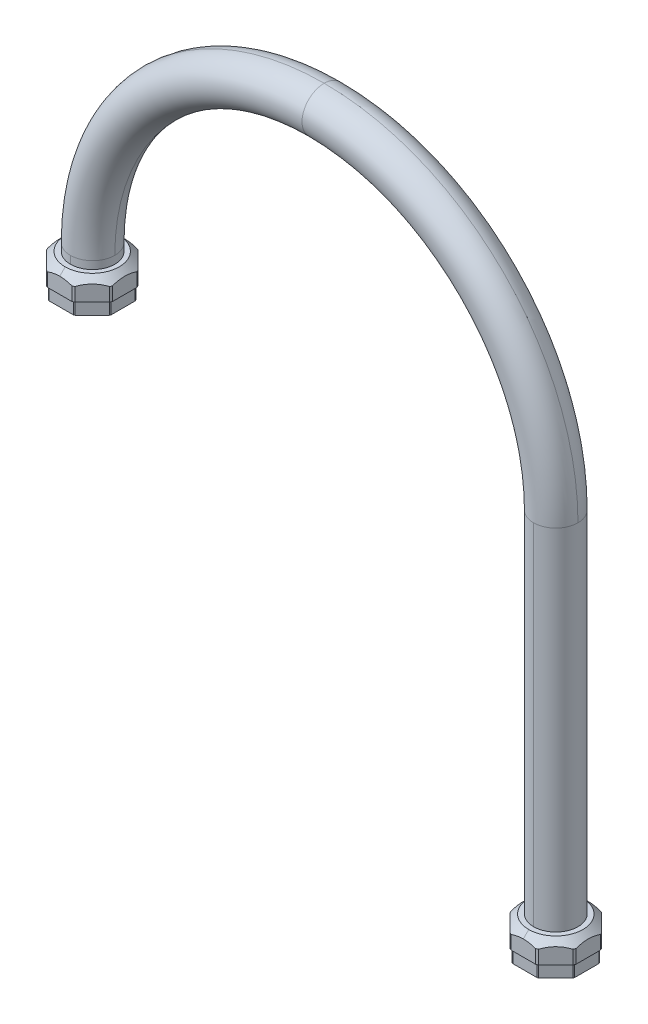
ISO-10303-21;
HEADER;
FILE_DESCRIPTION(('STEP AP214'),'2;1');
FILE_NAME('part.step','',(''),(''),'','','');
FILE_SCHEMA(('AUTOMOTIVE_DESIGN { 1 0 10303 214 1 1 1 1 }'));
ENDSEC;
DATA;
#1=APPLICATION_CONTEXT('core data for automotive mechanical design processes');
#2=APPLICATION_PROTOCOL_DEFINITION('international standard','automotive_design',2000,#1);
#3=PRODUCT_CONTEXT('',#1,'mechanical');
#4=PRODUCT('Part','Part','',(#3));
#5=PRODUCT_RELATED_PRODUCT_CATEGORY('part','',(#4));
#6=PRODUCT_DEFINITION_FORMATION('','',#4);
#7=PRODUCT_DEFINITION_CONTEXT('part definition',#1,'design');
#8=PRODUCT_DEFINITION('design','',#6,#7);
#9=PRODUCT_DEFINITION_SHAPE('','',#8);
#10=(LENGTH_UNIT() NAMED_UNIT(*) SI_UNIT(.MILLI.,.METRE.));
#11=(NAMED_UNIT(*) PLANE_ANGLE_UNIT() SI_UNIT($,.RADIAN.));
#12=(NAMED_UNIT(*) SI_UNIT($,.STERADIAN.) SOLID_ANGLE_UNIT());
#13=UNCERTAINTY_MEASURE_WITH_UNIT(LENGTH_MEASURE(1.E-05),#10,'distance_accuracy_value','');
#14=(GEOMETRIC_REPRESENTATION_CONTEXT(3) GLOBAL_UNCERTAINTY_ASSIGNED_CONTEXT((#13)) GLOBAL_UNIT_ASSIGNED_CONTEXT((#10,
#11,#12)) REPRESENTATION_CONTEXT('',''));
#15=CARTESIAN_POINT('',(0.,0.,0.));
#16=DIRECTION('',(0.,0.,1.));
#17=DIRECTION('',(1.,0.,0.));
#18=AXIS2_PLACEMENT_3D('',#15,#16,#17);
#19=CARTESIAN_POINT('',(-334.299,268.19,0.));
#20=DIRECTION('',(0.,-1.,0.));
#21=DIRECTION('',(0.,0.,-1.));
#22=AXIS2_PLACEMENT_3D('',#19,#20,#21);
#23=CONICAL_SURFACE('',#22,22.25,0.7853981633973);
#24=CARTESIAN_POINT('',(-334.299,265.44,0.));
#25=DIRECTION('',(0.,1.,0.));
#26=DIRECTION('',(0.936,0.,-0.352));
#27=AXIS2_PLACEMENT_3D('',#24,#25,#26);
#28=CIRCLE('',#27,25.);
#29=CARTESIAN_POINT('',(-310.899,265.44,-8.8));
#30=VERTEX_POINT('',#29);
#31=CARTESIAN_POINT('',(-311.5301616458,265.44,-10.32375900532));
#32=VERTEX_POINT('',#31);
#33=EDGE_CURVE('E10',#30,#32,#28,.T.);
#34=ORIENTED_EDGE('',*,*,#33,.T.);
#35=CARTESIAN_POINT('',(-311.5301616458,265.44,-10.32375900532));
#36=CARTESIAN_POINT('',(-311.680240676,265.5147098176,-10.47383803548));
#37=CARTESIAN_POINT('',(-311.9795619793,265.65896336,-10.77315933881));
#38=CARTESIAN_POINT('',(-312.4247121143,265.8592135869,-11.21830947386));
#39=CARTESIAN_POINT('',(-312.8700709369,266.0449243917,-11.66366829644));
#40=CARTESIAN_POINT('',(-313.3099920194,266.2136474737,-12.10358937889));
#41=CARTESIAN_POINT('',(-313.7462126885,266.3662564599,-12.53981004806));
#42=CARTESIAN_POINT('',(-314.1778476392,266.5025385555,-12.97144499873));
#43=CARTESIAN_POINT('',(-314.6043109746,266.6226013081,-13.3979083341));
#44=CARTESIAN_POINT('',(-315.0284023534,266.7273959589,-13.82199971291));
#45=CARTESIAN_POINT('',(-315.4499791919,266.8169354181,-14.24357655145));
#46=CARTESIAN_POINT('',(-315.8708132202,266.8916149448,-14.66441057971));
#47=CARTESIAN_POINT('',(-316.2916414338,266.9514440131,-15.08523879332));
#48=CARTESIAN_POINT('',(-316.7119847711,266.9962535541,-15.50558213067));
#49=CARTESIAN_POINT('',(-317.13056785,267.0259439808,-15.92416520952));
#50=CARTESIAN_POINT('',(-317.5473732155,267.0406674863,-16.34097057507));
#51=CARTESIAN_POINT('',(-317.9636888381,267.0405677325,-16.75728619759));
#52=CARTESIAN_POINT('',(-318.380424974,267.0256401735,-17.17402233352));
#53=CARTESIAN_POINT('',(-318.7983007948,266.9958116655,-17.59189815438));
#54=CARTESIAN_POINT('',(-319.2181980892,266.9508843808,-18.01179544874));
#55=CARTESIAN_POINT('',(-319.6383402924,266.8910086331,-18.43193765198));
#56=CARTESIAN_POINT('',(-320.0590270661,266.8162338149,-18.85262442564));
#57=CARTESIAN_POINT('',(-320.4809239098,266.7264991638,-19.27452126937));
#58=CARTESIAN_POINT('',(-320.9057688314,266.621376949,-19.69936619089));
#59=CARTESIAN_POINT('',(-321.3334629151,266.500781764,-20.12706027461));
#60=CARTESIAN_POINT('',(-321.7654497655,266.3641736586,-20.55904712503));
#61=CARTESIAN_POINT('',(-322.2016629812,266.2113435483,-20.99526034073));
#62=CARTESIAN_POINT('',(-322.6400186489,266.043026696,-21.43361600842));
#63=CARTESIAN_POINT('',(-323.0836058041,265.8579281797,-21.87720316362));
#64=CARTESIAN_POINT('',(-323.5268114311,265.6584937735,-22.32040879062));
#65=CARTESIAN_POINT('',(-323.8254283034,265.5145772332,-22.61902566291));
#66=CARTESIAN_POINT('',(-323.9752409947,265.44,-22.76883835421));
#67=(BOUNDED_CURVE() B_SPLINE_CURVE(3,(#35,#36,#37,#38,#39,#40,#41,#42,#43,#44,#45,#46,#47,#48,
#49,#50,#51,#52,#53,#54,#55,#56,#57,#58,#59,#60,#61,#62,#63,#64,#65,#66),.UNSPECIFIED.,.F.,
.F.) B_SPLINE_CURVE_WITH_KNOTS((4,1,1,1,1,1,1,1,1,1,1,1,1,1,1,1,1,1,1,1,1,1,1,1,1,1,1,1,1,4),
(0.,0.03448275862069,0.06896551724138,0.1034482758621,0.1379310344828,0.1724137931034,
0.2068965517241,0.2413793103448,0.2758620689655,0.3103448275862,0.3448275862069,0.3793103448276,
0.4137931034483,0.448275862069,0.4827586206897,0.5172413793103,0.551724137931,0.5862068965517,
0.6206896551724,0.6551724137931,0.6896551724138,0.7241379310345,0.7586206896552,0.7931034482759,
0.8275862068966,0.8620689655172,0.8965517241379,0.9310344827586,0.9655172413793,1.),
.UNSPECIFIED.) CURVE() GEOMETRIC_REPRESENTATION_ITEM() RATIONAL_B_SPLINE_CURVE((1.,1.,1.,1.,1.,
1.,1.,1.,1.,1.,1.,1.,1.,1.,1.,1.,1.,1.,1.,1.,1.,1.,1.,1.,1.,1.,1.,1.,1.,1.,1.,1.)) REPRESENTATION_ITEM(''));
#68=CARTESIAN_POINT('',(-323.9752409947,265.44,-22.76883835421));
#69=VERTEX_POINT('',#68);
#70=EDGE_CURVE('E26',#32,#69,#67,.T.);
#71=ORIENTED_EDGE('',*,*,#70,.T.);
#72=CARTESIAN_POINT('',(-334.299,265.44,0.));
#73=DIRECTION('',(0.,1.,0.));
#74=DIRECTION('',(0.412950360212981,0.,-0.910753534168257));
#75=AXIS2_PLACEMENT_3D('',#72,#73,#74);
#76=CIRCLE('',#75,25.);
#77=CARTESIAN_POINT('',(-325.499,265.44,-23.4));
#78=VERTEX_POINT('',#77);
#79=EDGE_CURVE('E895',#69,#78,#76,.T.);
#80=ORIENTED_EDGE('',*,*,#79,.T.);
#81=CARTESIAN_POINT('',(-325.499,265.44,-23.4));
#82=CARTESIAN_POINT('',(-325.7014856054,265.5112749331,-23.4));
#83=CARTESIAN_POINT('',(-326.1056926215,265.6492459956,-23.4));
#84=CARTESIAN_POINT('',(-326.7099799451,265.8423681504,-23.4));
#85=CARTESIAN_POINT('',(-327.3116632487,266.0213042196,-23.4));
#86=CARTESIAN_POINT('',(-327.9100179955,266.1857532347,-23.4));
#87=CARTESIAN_POINT('',(-328.5060332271,266.3359059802,-23.40000000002));
#88=CARTESIAN_POINT('',(-329.0983272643,266.4713356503,-23.39999999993));
#89=CARTESIAN_POINT('',(-329.6850511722,266.5917736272,-23.40000000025));
#90=CARTESIAN_POINT('',(-330.2732087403,266.6985737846,-23.39999999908));
#91=CARTESIAN_POINT('',(-330.8579150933,266.790677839,-23.40000000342));
#92=CARTESIAN_POINT('',(-331.4379826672,266.8680742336,-23.39999998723));
#93=CARTESIAN_POINT('',(-332.0143933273,266.9310613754,-23.40000004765));
#94=CARTESIAN_POINT('',(-332.5885759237,266.9798934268,-23.39999982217));
#95=CARTESIAN_POINT('',(-333.1602196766,267.0146088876,-23.40000066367));
#96=CARTESIAN_POINT('',(-333.7288684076,267.0353646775,-23.39999752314));
#97=CARTESIAN_POINT('',(-334.1089571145,267.0399893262,-23.40000533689));
#98=CARTESIAN_POINT('',(-334.2989999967,267.0399893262,-23.40000533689));
#99=(BOUNDED_CURVE() B_SPLINE_CURVE(3,(#81,#82,#83,#84,#85,#86,#87,#88,#89,#90,#91,#92,#93,#94,
#95,#96,#97,#98),.UNSPECIFIED.,.F.,.F.) B_SPLINE_CURVE_WITH_KNOTS((4,1,1,1,1,1,1,1,1,1,1,1,1,1,
1,4),(0.,0.06666666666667,0.1333333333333,0.2,0.2666666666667,0.3333333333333,0.4,
0.4666666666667,0.5333333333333,0.6,0.6666666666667,0.7333333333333,0.8,0.8666666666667,
0.9333333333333,1.),
.UNSPECIFIED.) CURVE() GEOMETRIC_REPRESENTATION_ITEM() RATIONAL_B_SPLINE_CURVE((1.,1.,1.,1.,1.,
1.,1.,1.,1.,1.,1.,1.,1.,1.,1.,1.,1.,1.)) REPRESENTATION_ITEM(''));
#100=CARTESIAN_POINT('',(-334.2989999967,267.0399893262,-23.40000533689));
#101=VERTEX_POINT('',#100);
#102=EDGE_CURVE('E899',#78,#101,#99,.T.);
#103=ORIENTED_EDGE('',*,*,#102,.T.);
#104=DIRECTION('',(5.90588019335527E-10,-0.707107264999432,-0.707106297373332));
#105=VECTOR('',#104,1.);
#106=CARTESIAN_POINT('',(-334.299,270.94,-19.5));
#107=LINE('',#106,#105);
#108=CARTESIAN_POINT('',(-334.299,270.94,-19.5));
#109=VERTEX_POINT('',#108);
#110=EDGE_CURVE('E1181',#109,#101,#107,.T.);
#111=ORIENTED_EDGE('',*,*,#110,.F.);
#112=CARTESIAN_POINT('',(-334.299,270.94,0.));
#113=DIRECTION('',(0.,1.,0.));
#114=DIRECTION('',(0.,0.,1.));
#115=AXIS2_PLACEMENT_3D('',#112,#113,#114);
#116=CIRCLE('',#115,19.5);
#117=CARTESIAN_POINT('',(-334.299,270.94,19.5));
#118=VERTEX_POINT('',#117);
#119=EDGE_CURVE('E1019',#118,#109,#116,.T.);
#120=ORIENTED_EDGE('',*,*,#119,.F.);
#121=DIRECTION('',(-5.90588423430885E-10,-0.707107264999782,0.707106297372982));
#122=VECTOR('',#121,1.);
#123=CARTESIAN_POINT('',(-334.299,270.94,19.5));
#124=LINE('',#123,#122);
#125=CARTESIAN_POINT('',(-334.2990000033,267.0399919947,23.4000026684));
#126=VERTEX_POINT('',#125);
#127=EDGE_CURVE('E817',#118,#126,#124,.T.);
#128=ORIENTED_EDGE('',*,*,#127,.T.);
#129=CARTESIAN_POINT('',(-334.2990000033,267.0399919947,23.4000026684));
#130=CARTESIAN_POINT('',(-334.1999913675,267.0399919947,23.4000026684));
#131=CARTESIAN_POINT('',(-334.0018251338,267.0387466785,23.39999876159));
#132=CARTESIAN_POINT('',(-333.7042050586,267.0330722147,23.40000033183));
#133=CARTESIAN_POINT('',(-333.4059856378,267.0236000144,23.39999991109));
#134=CARTESIAN_POINT('',(-333.1069859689,267.0102948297,23.40000002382));
#135=CARTESIAN_POINT('',(-332.8070860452,266.9931265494,23.39999999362));
#136=CARTESIAN_POINT('',(-332.5065601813,266.9720886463,23.40000000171));
#137=CARTESIAN_POINT('',(-332.2056235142,266.9471873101,23.39999999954));
#138=CARTESIAN_POINT('',(-331.9044678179,266.9184384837,23.40000000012));
#139=CARTESIAN_POINT('',(-331.6032414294,266.8858653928,23.39999999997));
#140=CARTESIAN_POINT('',(-331.3019503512,266.8494821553,23.40000000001));
#141=CARTESIAN_POINT('',(-331.0007726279,266.8093269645,23.4));
#142=CARTESIAN_POINT('',(-330.7002385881,266.7655043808,23.4));
#143=CARTESIAN_POINT('',(-330.4002448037,266.7180459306,23.4));
#144=CARTESIAN_POINT('',(-330.1000907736,266.6668700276,23.4));
#145=CARTESIAN_POINT('',(-329.799553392,266.6119504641,23.4));
#146=CARTESIAN_POINT('',(-329.4985838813,266.5532887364,23.4));
#147=CARTESIAN_POINT('',(-329.19725232,266.4909096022,23.4));
#148=CARTESIAN_POINT('',(-328.8958860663,266.4249031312,23.4));
#149=CARTESIAN_POINT('',(-328.5940323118,266.3551939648,23.4));
#150=CARTESIAN_POINT('',(-328.2909022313,266.2815983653,23.4));
#151=CARTESIAN_POINT('',(-327.9864042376,266.2040776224,23.4));
#152=CARTESIAN_POINT('',(-327.6806269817,266.1226424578,23.4));
#153=CARTESIAN_POINT('',(-327.3734836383,266.0372598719,23.4));
#154=CARTESIAN_POINT('',(-327.0648638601,265.9478868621,23.4));
#155=CARTESIAN_POINT('',(-326.754763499,265.8545097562,23.4));
#156=CARTESIAN_POINT('',(-326.4431945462,265.7571221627,23.4));
#157=CARTESIAN_POINT('',(-326.1301194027,265.6557036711,23.4));
#158=CARTESIAN_POINT('',(-325.8154971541,265.5502328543,23.4));
#159=CARTESIAN_POINT('',(-325.6046753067,265.477197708,23.4));
#160=CARTESIAN_POINT('',(-325.499,265.44,23.4));
#161=(BOUNDED_CURVE() B_SPLINE_CURVE(3,(#129,#130,#131,#132,#133,#134,#135,#136,#137,#138,#139,
#140,#141,#142,#143,#144,#145,#146,#147,#148,#149,#150,#151,#152,#153,#154,#155,#156,#157,#158,
#159,#160),.UNSPECIFIED.,.F.,.F.) B_SPLINE_CURVE_WITH_KNOTS((4,1,1,1,1,1,1,1,1,1,1,1,1,1,1,1,1,
1,1,1,1,1,1,1,1,1,1,1,1,4),(0.,0.03448275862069,0.06896551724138,0.1034482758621,
0.1379310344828,0.1724137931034,0.2068965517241,0.2413793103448,0.2758620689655,0.3103448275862,
0.3448275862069,0.3793103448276,0.4137931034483,0.448275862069,0.4827586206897,0.5172413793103,
0.551724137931,0.5862068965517,0.6206896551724,0.6551724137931,0.6896551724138,0.7241379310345,
0.7586206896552,0.7931034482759,0.8275862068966,0.8620689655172,0.8965517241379,0.9310344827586,
0.9655172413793,1.),
.UNSPECIFIED.) CURVE() GEOMETRIC_REPRESENTATION_ITEM() RATIONAL_B_SPLINE_CURVE((1.,1.,1.,1.,1.,
1.,1.,1.,1.,1.,1.,1.,1.,1.,1.,1.,1.,1.,1.,1.,1.,1.,1.,1.,1.,1.,1.,1.,1.,1.,1.,1.)) REPRESENTATION_ITEM(''));
#162=CARTESIAN_POINT('',(-325.499,265.44,23.4));
#163=VERTEX_POINT('',#162);
#164=EDGE_CURVE('E811',#126,#163,#161,.T.);
#165=ORIENTED_EDGE('',*,*,#164,.T.);
#166=CARTESIAN_POINT('',(-334.299,265.44,0.));
#167=DIRECTION('',(0.,1.,0.));
#168=DIRECTION('',(0.352,0.,0.936));
#169=AXIS2_PLACEMENT_3D('',#166,#167,#168);
#170=CIRCLE('',#169,25.);
#171=CARTESIAN_POINT('',(-323.9752409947,265.44,22.76883835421));
#172=VERTEX_POINT('',#171);
#173=EDGE_CURVE('E818',#163,#172,#170,.T.);
#174=ORIENTED_EDGE('',*,*,#173,.T.);
#175=CARTESIAN_POINT('',(-323.9752409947,265.44,22.76883835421));
#176=CARTESIAN_POINT('',(-323.8251619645,265.5147098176,22.61875932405));
#177=CARTESIAN_POINT('',(-323.5258406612,265.65896336,22.31943802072));
#178=CARTESIAN_POINT('',(-323.0806905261,265.8592135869,21.87428788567));
#179=CARTESIAN_POINT('',(-322.6353317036,266.0449243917,21.42892906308));
#180=CARTESIAN_POINT('',(-322.1954106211,266.2136474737,20.98900798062));
#181=CARTESIAN_POINT('',(-321.7591899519,266.3662564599,20.55278731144));
#182=CARTESIAN_POINT('',(-321.3275550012,266.5025385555,20.12115236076));
#183=CARTESIAN_POINT('',(-320.9010916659,266.6226013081,19.69468902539));
#184=CARTESIAN_POINT('',(-320.4770002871,266.7273959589,19.27059764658));
#185=CARTESIAN_POINT('',(-320.0554234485,266.8169354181,18.84902080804));
#186=CARTESIAN_POINT('',(-319.6345894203,266.8916149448,18.42818677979));
#187=CARTESIAN_POINT('',(-319.2137612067,266.9514440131,18.00735856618));
#188=CARTESIAN_POINT('',(-318.7934178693,266.9962535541,17.58701522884));
#189=CARTESIAN_POINT('',(-318.3748347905,267.0259439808,17.16843214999));
#190=CARTESIAN_POINT('',(-317.9580294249,267.0406674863,16.75162678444));
#191=CARTESIAN_POINT('',(-317.5417138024,267.0405677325,16.33531116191));
#192=CARTESIAN_POINT('',(-317.1249776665,267.0256401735,15.91857502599));
#193=CARTESIAN_POINT('',(-316.7071018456,266.9958116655,15.50069920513));
#194=CARTESIAN_POINT('',(-316.2872045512,266.9508843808,15.08080191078));
#195=CARTESIAN_POINT('',(-315.867062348,266.8910086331,14.66065970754));
#196=CARTESIAN_POINT('',(-315.4463755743,266.8162338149,14.23997293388));
#197=CARTESIAN_POINT('',(-315.0244787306,266.7264991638,13.81807609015));
#198=CARTESIAN_POINT('',(-314.5996338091,266.621376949,13.39323116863));
#199=CARTESIAN_POINT('',(-314.1719397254,266.500781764,12.96553708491));
#200=CARTESIAN_POINT('',(-313.739952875,266.3641736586,12.5335502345));
#201=CARTESIAN_POINT('',(-313.3037396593,266.2113435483,12.09733701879));
#202=CARTESIAN_POINT('',(-312.8653839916,266.043026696,11.6589813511));
#203=CARTESIAN_POINT('',(-312.4217968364,265.8579281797,11.21539419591));
#204=CARTESIAN_POINT('',(-311.9785912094,265.6584937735,10.77218856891));
#205=CARTESIAN_POINT('',(-311.6799743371,265.5145772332,10.47357169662));
#206=CARTESIAN_POINT('',(-311.5301616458,265.44,10.32375900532));
#207=(BOUNDED_CURVE() B_SPLINE_CURVE(3,(#175,#176,#177,#178,#179,#180,#181,#182,#183,#184,#185,
#186,#187,#188,#189,#190,#191,#192,#193,#194,#195,#196,#197,#198,#199,#200,#201,#202,#203,#204,
#205,#206),.UNSPECIFIED.,.F.,.F.) B_SPLINE_CURVE_WITH_KNOTS((4,1,1,1,1,1,1,1,1,1,1,1,1,1,1,1,1,
1,1,1,1,1,1,1,1,1,1,1,1,4),(0.,0.03448275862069,0.06896551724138,0.1034482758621,
0.1379310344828,0.1724137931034,0.2068965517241,0.2413793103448,0.2758620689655,0.3103448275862,
0.3448275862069,0.3793103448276,0.4137931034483,0.448275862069,0.4827586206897,0.5172413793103,
0.551724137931,0.5862068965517,0.6206896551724,0.6551724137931,0.6896551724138,0.7241379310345,
0.7586206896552,0.7931034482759,0.8275862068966,0.8620689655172,0.8965517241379,0.9310344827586,
0.9655172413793,1.),
.UNSPECIFIED.) CURVE() GEOMETRIC_REPRESENTATION_ITEM() RATIONAL_B_SPLINE_CURVE((1.,1.,1.,1.,1.,
1.,1.,1.,1.,1.,1.,1.,1.,1.,1.,1.,1.,1.,1.,1.,1.,1.,1.,1.,1.,1.,1.,1.,1.,1.,1.,1.)) REPRESENTATION_ITEM(''));
#208=CARTESIAN_POINT('',(-311.5301616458,265.44,10.32375900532));
#209=VERTEX_POINT('',#208);
#210=EDGE_CURVE('E1011',#172,#209,#207,.T.);
#211=ORIENTED_EDGE('',*,*,#210,.T.);
#212=CARTESIAN_POINT('',(-334.299,265.44,0.));
#213=DIRECTION('',(0.,1.,0.));
#214=DIRECTION('',(0.910753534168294,0.,0.412950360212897));
#215=AXIS2_PLACEMENT_3D('',#212,#213,#214);
#216=CIRCLE('',#215,25.);
#217=CARTESIAN_POINT('',(-310.899,265.44,8.8));
#218=VERTEX_POINT('',#217);
#219=EDGE_CURVE('E1007',#209,#218,#216,.T.);
#220=ORIENTED_EDGE('',*,*,#219,.T.);
#221=CARTESIAN_POINT('',(-310.899,265.44,8.8));
#222=CARTESIAN_POINT('',(-310.899,265.4767647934,8.695554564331));
#223=CARTESIAN_POINT('',(-310.899,265.5489386,8.487256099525));
#224=CARTESIAN_POINT('',(-310.899,265.6531044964,8.17671595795));
#225=CARTESIAN_POINT('',(-310.899,265.7533147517,7.867712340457));
#226=CARTESIAN_POINT('',(-310.899,265.8496559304,7.559993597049));
#227=CARTESIAN_POINT('',(-310.899,265.9422126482,7.253282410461));
#228=CARTESIAN_POINT('',(-310.899,266.0310030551,6.947495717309));
#229=CARTESIAN_POINT('',(-310.899,266.1160430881,6.642550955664));
#230=CARTESIAN_POINT('',(-310.899,266.1973038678,6.338527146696));
#231=CARTESIAN_POINT('',(-310.899,266.2747575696,6.035522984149));
#232=CARTESIAN_POINT('',(-310.899,266.3483967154,5.733578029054));
#233=CARTESIAN_POINT('',(-310.899,266.4182205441,5.432716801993));
#234=CARTESIAN_POINT('',(-310.899,266.4842208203,5.13301130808));
#235=CARTESIAN_POINT('',(-310.899,266.5463900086,4.834558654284));
#236=CARTESIAN_POINT('',(-310.899,266.6047535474,4.5373170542));
#237=CARTESIAN_POINT('',(-310.899,266.6593428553,4.241208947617));
#238=CARTESIAN_POINT('',(-310.899,266.7102012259,3.946074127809));
#239=CARTESIAN_POINT('',(-310.899,266.7573673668,3.651740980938));
#240=CARTESIAN_POINT('',(-310.899,266.8008685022,3.358072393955));
#241=CARTESIAN_POINT('',(-310.899,266.8407245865,3.06494882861));
#242=CARTESIAN_POINT('',(-310.899,266.8769469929,2.772288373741));
#243=CARTESIAN_POINT('',(-310.899,266.9095431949,2.480024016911));
#244=CARTESIAN_POINT('',(-310.899,266.9385144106,2.188136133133));
#245=CARTESIAN_POINT('',(-310.899,266.9638586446,1.896657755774));
#246=CARTESIAN_POINT('',(-310.899,266.9855836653,1.60553428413));
#247=CARTESIAN_POINT('',(-310.899,267.0037001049,1.314631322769));
#248=CARTESIAN_POINT('',(-310.899,267.0182073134,1.023941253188));
#249=CARTESIAN_POINT('',(-310.899,267.0291029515,0.7335846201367));
#250=CARTESIAN_POINT('',(-310.899,267.0363963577,0.4434941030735));
#251=CARTESIAN_POINT('',(-310.899,267.0400953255,0.1535234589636));
#252=CARTESIAN_POINT('',(-310.899,267.0402021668,-0.1366787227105));
#253=CARTESIAN_POINT('',(-310.899,267.0366957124,-0.4277887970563));
#254=CARTESIAN_POINT('',(-310.899,267.0295339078,-0.7200518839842));
#255=CARTESIAN_POINT('',(-310.899,267.0186811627,-1.013358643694));
#256=CARTESIAN_POINT('',(-310.899,267.004109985,-1.30758579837));
#257=CARTESIAN_POINT('',(-310.899,266.9858104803,-1.602469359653));
#258=CARTESIAN_POINT('',(-310.899,266.9637809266,-1.897839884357));
#259=CARTESIAN_POINT('',(-310.899,266.9380216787,-2.193609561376));
#260=CARTESIAN_POINT('',(-310.899,266.9085436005,-2.489646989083));
#261=CARTESIAN_POINT('',(-310.899,266.8753694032,-2.785793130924));
#262=CARTESIAN_POINT('',(-310.899,266.8385322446,-3.081879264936));
#263=CARTESIAN_POINT('',(-310.899,266.7980902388,-3.377635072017));
#264=CARTESIAN_POINT('',(-310.899,266.7540770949,-3.673054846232));
#265=CARTESIAN_POINT('',(-310.899,266.706454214,-3.968566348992));
#266=CARTESIAN_POINT('',(-310.899,266.6552062,-4.264347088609));
#267=CARTESIAN_POINT('',(-310.899,266.600374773,-4.560247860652));
#268=CARTESIAN_POINT('',(-310.899,266.5419778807,-4.856282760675));
#269=CARTESIAN_POINT('',(-310.899,266.4800290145,-5.152487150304));
#270=CARTESIAN_POINT('',(-310.899,266.41450917,-5.449044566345));
#271=CARTESIAN_POINT('',(-310.899,266.3452982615,-5.746528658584));
#272=CARTESIAN_POINT('',(-310.899,266.272297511,-6.045317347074));
#273=CARTESIAN_POINT('',(-310.899,266.1954979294,-6.3453889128));
#274=CARTESIAN_POINT('',(-310.899,266.1148746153,-6.646794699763));
#275=CARTESIAN_POINT('',(-310.899,266.0303730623,-6.949686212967));
#276=CARTESIAN_POINT('',(-310.899,265.9419441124,-7.254176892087));
#277=CARTESIAN_POINT('',(-310.899,265.8495942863,-7.560188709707));
#278=CARTESIAN_POINT('',(-310.899,265.7533269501,-7.86767321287));
#279=CARTESIAN_POINT('',(-310.899,265.6531088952,-8.176703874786));
#280=CARTESIAN_POINT('',(-310.899,265.5489060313,-8.487351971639));
#281=CARTESIAN_POINT('',(-310.899,265.4767497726,-8.695597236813));
#282=CARTESIAN_POINT('',(-310.899,265.44,-8.8));
#283=(BOUNDED_CURVE() B_SPLINE_CURVE(3,(#221,#222,#223,#224,#225,#226,#227,#228,#229,#230,#231,
#232,#233,#234,#235,#236,#237,#238,#239,#240,#241,#242,#243,#244,#245,#246,#247,#248,#249,#250,
#251,#252,#253,#254,#255,#256,#257,#258,#259,#260,#261,#262,#263,#264,#265,#266,#267,#268,#269,
#270,#271,#272,#273,#274,#275,#276,#277,#278,#279,#280,#281,#282),.UNSPECIFIED.,.F.,
.F.) B_SPLINE_CURVE_WITH_KNOTS((4,1,1,1,1,1,1,1,1,1,1,1,1,1,1,1,1,1,1,1,1,1,1,1,1,1,1,1,1,1,1,1,
1,1,1,1,1,1,1,1,1,1,1,1,1,1,1,1,1,1,1,1,1,1,1,1,1,1,1,4),(0.,0.01694915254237,0.03389830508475,
0.05084745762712,0.06779661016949,0.08474576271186,0.1016949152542,0.1186440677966,
0.135593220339,0.1525423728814,0.1694915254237,0.1864406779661,0.2033898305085,0.2203389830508,
0.2372881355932,0.2542372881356,0.271186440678,0.2881355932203,0.3050847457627,0.3220338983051,
0.3389830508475,0.3559322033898,0.3728813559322,0.3898305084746,0.4067796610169,0.4237288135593,
0.4406779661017,0.4576271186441,0.4745762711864,0.4915254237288,0.5084745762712,0.5254237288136,
0.5423728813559,0.5593220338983,0.5762711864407,0.5932203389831,0.6101694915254,0.6271186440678,
0.6440677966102,0.6610169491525,0.6779661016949,0.6949152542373,0.7118644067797,0.728813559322,
0.7457627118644,0.7627118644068,0.7796610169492,0.7966101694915,0.8135593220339,0.8305084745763,
0.8474576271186,0.864406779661,0.8813559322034,0.8983050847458,0.9152542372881,0.9322033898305,
0.9491525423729,0.9661016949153,0.9830508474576,1.),
.UNSPECIFIED.) CURVE() GEOMETRIC_REPRESENTATION_ITEM() RATIONAL_B_SPLINE_CURVE((1.,1.,1.,1.,1.,
1.,1.,1.,1.,1.,1.,1.,1.,1.,1.,1.,1.,1.,1.,1.,1.,1.,1.,1.,1.,1.,1.,1.,1.,1.,1.,1.,1.,1.,1.,1.,1.,
1.,1.,1.,1.,1.,1.,1.,1.,1.,1.,1.,1.,1.,1.,1.,1.,1.,1.,1.,1.,1.,1.,1.,1.,1.)) REPRESENTATION_ITEM(''));
#284=EDGE_CURVE('E1012',#218,#30,#283,.T.);
#285=ORIENTED_EDGE('',*,*,#284,.T.);
#286=EDGE_LOOP('',(#34,#71,#80,#103,#111,#120,#128,#165,#174,#211,#220,#285));
#287=FACE_BOUND('',#286,.T.);
#288=ADVANCED_FACE('F15',(#287),#23,.T.);
#289=CARTESIAN_POINT('',(-310.899,255.64,9.69259735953));
#290=DIRECTION('',(1.,0.,0.));
#291=DIRECTION('',(0.,1.,0.));
#292=AXIS2_PLACEMENT_3D('',#289,#290,#291);
#293=PLANE('',#292);
#294=DIRECTION('',(0.,0.,1.));
#295=VECTOR('',#294,1.);
#296=CARTESIAN_POINT('',(-310.899,255.64,-8.8));
#297=LINE('',#296,#295);
#298=CARTESIAN_POINT('',(-310.899,255.64,-8.8));
#299=VERTEX_POINT('',#298);
#300=CARTESIAN_POINT('',(-310.899,255.64,8.8));
#301=VERTEX_POINT('',#300);
#302=EDGE_CURVE('E800',#299,#301,#297,.T.);
#303=ORIENTED_EDGE('',*,*,#302,.F.);
#304=DIRECTION('',(0.,-1.,0.));
#305=VECTOR('',#304,1.);
#306=CARTESIAN_POINT('',(-310.899,265.44,-8.8));
#307=LINE('',#306,#305);
#308=EDGE_CURVE('E651',#30,#299,#307,.T.);
#309=ORIENTED_EDGE('',*,*,#308,.F.);
#310=ORIENTED_EDGE('',*,*,#284,.F.);
#311=DIRECTION('',(0.,1.,0.));
#312=VECTOR('',#311,1.);
#313=CARTESIAN_POINT('',(-310.899,255.64,8.8));
#314=LINE('',#313,#312);
#315=EDGE_CURVE('E786',#301,#218,#314,.T.);
#316=ORIENTED_EDGE('',*,*,#315,.F.);
#317=EDGE_LOOP('',(#303,#309,#310,#316));
#318=FACE_BOUND('',#317,.T.);
#319=ADVANCED_FACE('F1781',(#318),#293,.T.);
#320=CARTESIAN_POINT('',(-334.299,246.701,0.));
#321=DIRECTION('',(0.,-1.,0.));
#322=DIRECTION('',(0.,0.,-1.));
#323=AXIS2_PLACEMENT_3D('',#320,#321,#322);
#324=CYLINDRICAL_SURFACE('',#323,25.);
#325=ORIENTED_EDGE('',*,*,#219,.F.);
#326=DIRECTION('',(0.,-1.,0.));
#327=VECTOR('',#326,1.);
#328=CARTESIAN_POINT('',(-311.5301616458,265.44,10.32375900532));
#329=LINE('',#328,#327);
#330=CARTESIAN_POINT('',(-311.5301616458,255.64,10.32375900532));
#331=VERTEX_POINT('',#330);
#332=EDGE_CURVE('E1372',#209,#331,#329,.T.);
#333=ORIENTED_EDGE('',*,*,#332,.T.);
#334=CARTESIAN_POINT('',(-334.299,255.64,0.));
#335=DIRECTION('',(0.,-1.,0.));
#336=DIRECTION('',(0.936,0.,0.352));
#337=AXIS2_PLACEMENT_3D('',#334,#335,#336);
#338=CIRCLE('',#337,25.);
#339=EDGE_CURVE('E761',#301,#331,#338,.T.);
#340=ORIENTED_EDGE('',*,*,#339,.F.);
#341=ORIENTED_EDGE('',*,*,#315,.T.);
#342=EDGE_LOOP('',(#325,#333,#340,#341));
#343=FACE_BOUND('',#342,.T.);
#344=ADVANCED_FACE('F1788',(#343),#324,.T.);
#345=CARTESIAN_POINT('',(-309.299,255.64,0.));
#346=DIRECTION('',(0.,1.,0.));
#347=DIRECTION('',(1.,0.,0.));
#348=AXIS2_PLACEMENT_3D('',#345,#346,#347);
#349=PLANE('',#348);
#350=CARTESIAN_POINT('',(-334.299,255.64,0.));
#351=DIRECTION('',(0.,-1.,0.));
#352=DIRECTION('',(-0.412950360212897,0.,-0.910753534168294));
#353=AXIS2_PLACEMENT_3D('',#350,#351,#352);
#354=CIRCLE('',#353,25.);
#355=CARTESIAN_POINT('',(-344.6227590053,255.64,-22.76883835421));
#356=VERTEX_POINT('',#355);
#357=CARTESIAN_POINT('',(-343.099,255.64,-23.4));
#358=VERTEX_POINT('',#357);
#359=EDGE_CURVE('E782',#356,#358,#354,.T.);
#360=ORIENTED_EDGE('',*,*,#359,.T.);
#361=DIRECTION('',(1.,0.,0.));
#362=VECTOR('',#361,1.);
#363=CARTESIAN_POINT('',(-343.099,255.64,-23.4));
#364=LINE('',#363,#362);
#365=CARTESIAN_POINT('',(-325.499,255.64,-23.4));
#366=VERTEX_POINT('',#365);
#367=EDGE_CURVE('E751',#358,#366,#364,.T.);
#368=ORIENTED_EDGE('',*,*,#367,.T.);
#369=CARTESIAN_POINT('',(-334.299,255.64,0.));
#370=DIRECTION('',(0.,-1.,0.));
#371=DIRECTION('',(0.352,0.,-0.936));
#372=AXIS2_PLACEMENT_3D('',#369,#370,#371);
#373=CIRCLE('',#372,25.);
#374=CARTESIAN_POINT('',(-323.9752409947,255.64,-22.76883835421));
#375=VERTEX_POINT('',#374);
#376=EDGE_CURVE('E747',#366,#375,#373,.T.);
#377=ORIENTED_EDGE('',*,*,#376,.T.);
#378=DIRECTION('',(0.707106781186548,0.,0.707106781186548));
#379=VECTOR('',#378,1.);
#380=CARTESIAN_POINT('',(-323.9752409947,255.64,-22.76883835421));
#381=LINE('',#380,#379);
#382=CARTESIAN_POINT('',(-311.5301616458,255.64,-10.32375900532));
#383=VERTEX_POINT('',#382);
#384=EDGE_CURVE('E752',#375,#383,#381,.T.);
#385=ORIENTED_EDGE('',*,*,#384,.T.);
#386=CARTESIAN_POINT('',(-334.299,255.64,0.));
#387=DIRECTION('',(0.,-1.,0.));
#388=DIRECTION('',(0.910753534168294,0.,-0.412950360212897));
#389=AXIS2_PLACEMENT_3D('',#386,#387,#388);
#390=CIRCLE('',#389,25.);
#391=EDGE_CURVE('E796',#383,#299,#390,.T.);
#392=ORIENTED_EDGE('',*,*,#391,.T.);
#393=ORIENTED_EDGE('',*,*,#302,.T.);
#394=ORIENTED_EDGE('',*,*,#339,.T.);
#395=DIRECTION('',(-0.707106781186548,0.,0.707106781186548));
#396=VECTOR('',#395,1.);
#397=CARTESIAN_POINT('',(-311.5301616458,255.64,10.32375900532));
#398=LINE('',#397,#396);
#399=CARTESIAN_POINT('',(-323.9752409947,255.64,22.76883835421));
#400=VERTEX_POINT('',#399);
#401=EDGE_CURVE('E725',#331,#400,#398,.T.);
#402=ORIENTED_EDGE('',*,*,#401,.T.);
#403=CARTESIAN_POINT('',(-334.299,255.64,0.));
#404=DIRECTION('',(0.,-1.,0.));
#405=DIRECTION('',(0.412950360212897,0.,0.910753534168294));
#406=AXIS2_PLACEMENT_3D('',#403,#404,#405);
#407=CIRCLE('',#406,25.);
#408=CARTESIAN_POINT('',(-325.499,255.64,23.4));
#409=VERTEX_POINT('',#408);
#410=EDGE_CURVE('E721',#400,#409,#407,.T.);
#411=ORIENTED_EDGE('',*,*,#410,.T.);
#412=DIRECTION('',(-1.,0.,0.));
#413=VECTOR('',#412,1.);
#414=CARTESIAN_POINT('',(-325.499,255.64,23.4));
#415=LINE('',#414,#413);
#416=CARTESIAN_POINT('',(-343.099,255.64,23.4));
#417=VERTEX_POINT('',#416);
#418=EDGE_CURVE('E726',#409,#417,#415,.T.);
#419=ORIENTED_EDGE('',*,*,#418,.T.);
#420=CARTESIAN_POINT('',(-334.299,255.64,0.));
#421=DIRECTION('',(0.,-1.,0.));
#422=DIRECTION('',(-0.352,0.,0.936));
#423=AXIS2_PLACEMENT_3D('',#420,#421,#422);
#424=CIRCLE('',#423,25.);
#425=CARTESIAN_POINT('',(-344.6227590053,255.64,22.76883835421));
#426=VERTEX_POINT('',#425);
#427=EDGE_CURVE('E873',#417,#426,#424,.T.);
#428=ORIENTED_EDGE('',*,*,#427,.T.);
#429=DIRECTION('',(-0.707106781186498,0.,-0.707106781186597));
#430=VECTOR('',#429,1.);
#431=CARTESIAN_POINT('',(-344.6227590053,255.64,22.76883835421));
#432=LINE('',#431,#430);
#433=CARTESIAN_POINT('',(-357.0678383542,255.64,10.32375900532));
#434=VERTEX_POINT('',#433);
#435=EDGE_CURVE('E825',#426,#434,#432,.T.);
#436=ORIENTED_EDGE('',*,*,#435,.T.);
#437=CARTESIAN_POINT('',(-334.299,255.64,0.));
#438=DIRECTION('',(0.,-1.,0.));
#439=DIRECTION('',(-0.910753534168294,0.,0.412950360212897));
#440=AXIS2_PLACEMENT_3D('',#437,#438,#439);
#441=CIRCLE('',#440,25.);
#442=CARTESIAN_POINT('',(-357.699,255.64,8.8));
#443=VERTEX_POINT('',#442);
#444=EDGE_CURVE('E677',#434,#443,#441,.T.);
#445=ORIENTED_EDGE('',*,*,#444,.T.);
#446=DIRECTION('',(0.,0.,-1.));
#447=VECTOR('',#446,1.);
#448=CARTESIAN_POINT('',(-357.699,255.64,8.8));
#449=LINE('',#448,#447);
#450=CARTESIAN_POINT('',(-357.699,255.64,-8.8));
#451=VERTEX_POINT('',#450);
#452=EDGE_CURVE('E673',#443,#451,#449,.T.);
#453=ORIENTED_EDGE('',*,*,#452,.T.);
#454=CARTESIAN_POINT('',(-334.299,255.64,0.));
#455=DIRECTION('',(0.,-1.,0.));
#456=DIRECTION('',(-0.936,0.,-0.352));
#457=AXIS2_PLACEMENT_3D('',#454,#455,#456);
#458=CIRCLE('',#457,25.);
#459=CARTESIAN_POINT('',(-357.0678383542,255.64,-10.32375900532));
#460=VERTEX_POINT('',#459);
#461=EDGE_CURVE('E678',#451,#460,#458,.T.);
#462=ORIENTED_EDGE('',*,*,#461,.T.);
#463=DIRECTION('',(0.707106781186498,0.,-0.707106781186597));
#464=VECTOR('',#463,1.);
#465=CARTESIAN_POINT('',(-357.0678383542,255.64,-10.32375900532));
#466=LINE('',#465,#464);
#467=EDGE_CURVE('E560',#460,#356,#466,.T.);
#468=ORIENTED_EDGE('',*,*,#467,.T.);
#469=EDGE_LOOP('',(#360,#368,#377,#385,#392,#393,#394,#402,#411,#419,#428,#436,#445,#453,#462,#468));
#470=FACE_BOUND('',#469,.T.);
#471=CARTESIAN_POINT('',(-334.299,255.64,0.));
#472=DIRECTION('',(0.,1.,0.));
#473=DIRECTION('',(0.,0.,1.));
#474=AXIS2_PLACEMENT_3D('',#471,#472,#473);
#475=CIRCLE('',#474,20.3);
#476=CARTESIAN_POINT('',(-334.299,255.64,20.3));
#477=VERTEX_POINT('',#476);
#478=CARTESIAN_POINT('',(-334.299,255.64,-20.3));
#479=VERTEX_POINT('',#478);
#480=EDGE_CURVE('E698',#477,#479,#475,.T.);
#481=ORIENTED_EDGE('',*,*,#480,.T.);
#482=CARTESIAN_POINT('',(-334.299,255.64,0.));
#483=DIRECTION('',(0.,1.,0.));
#484=DIRECTION('',(0.,0.,-1.));
#485=AXIS2_PLACEMENT_3D('',#482,#483,#484);
#486=CIRCLE('',#485,20.3);
#487=EDGE_CURVE('E695',#479,#477,#486,.T.);
#488=ORIENTED_EDGE('',*,*,#487,.T.);
#489=EDGE_LOOP('',(#481,#488));
#490=FACE_BOUND('',#489,.T.);
#491=ADVANCED_FACE('F1828',(#470,#490),#349,.F.);
#492=CARTESIAN_POINT('',(-334.299,246.701,0.));
#493=DIRECTION('',(0.,-1.,0.));
#494=DIRECTION('',(0.,0.,-1.));
#495=AXIS2_PLACEMENT_3D('',#492,#493,#494);
#496=CYLINDRICAL_SURFACE('',#495,20.3);
#497=DIRECTION('',(0.,-1.,0.));
#498=VECTOR('',#497,1.);
#499=CARTESIAN_POINT('',(-334.299,255.64,20.3));
#500=LINE('',#499,#498);
#501=CARTESIAN_POINT('',(-334.299,255.201,20.3));
#502=VERTEX_POINT('',#501);
#503=EDGE_CURVE('E621',#477,#502,#500,.T.);
#504=ORIENTED_EDGE('',*,*,#503,.F.);
#505=ORIENTED_EDGE('',*,*,#487,.F.);
#506=DIRECTION('',(0.,-1.,0.));
#507=VECTOR('',#506,1.);
#508=CARTESIAN_POINT('',(-334.299,255.64,-20.3));
#509=LINE('',#508,#507);
#510=CARTESIAN_POINT('',(-334.299,255.201,-20.3));
#511=VERTEX_POINT('',#510);
#512=EDGE_CURVE('E699',#479,#511,#509,.T.);
#513=ORIENTED_EDGE('',*,*,#512,.T.);
#514=CARTESIAN_POINT('',(-334.299,255.201,0.));
#515=DIRECTION('',(0.,-1.,0.));
#516=DIRECTION('',(0.,0.,1.));
#517=AXIS2_PLACEMENT_3D('',#514,#515,#516);
#518=CIRCLE('',#517,20.3);
#519=EDGE_CURVE('E656',#502,#511,#518,.T.);
#520=ORIENTED_EDGE('',*,*,#519,.F.);
#521=EDGE_LOOP('',(#504,#505,#513,#520));
#522=FACE_BOUND('',#521,.T.);
#523=ADVANCED_FACE('F1831',(#522),#496,.T.);
#524=CARTESIAN_POINT('',(-313.999,255.201,0.));
#525=DIRECTION('',(0.,-1.,0.));
#526=DIRECTION('',(0.,0.,-1.));
#527=AXIS2_PLACEMENT_3D('',#524,#525,#526);
#528=PLANE('',#527);
#529=DIRECTION('',(0.,0.,1.));
#530=VECTOR('',#529,1.);
#531=CARTESIAN_POINT('',(-311.999,255.201,-8.735702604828));
#532=LINE('',#531,#530);
#533=CARTESIAN_POINT('',(-311.999,255.201,-8.735702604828));
#534=VERTEX_POINT('',#533);
#535=CARTESIAN_POINT('',(-311.999,255.201,8.735702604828));
#536=VERTEX_POINT('',#535);
#537=EDGE_CURVE('E628',#534,#536,#532,.T.);
#538=ORIENTED_EDGE('',*,*,#537,.F.);
#539=CARTESIAN_POINT('',(-334.299,255.201,0.));
#540=DIRECTION('',(0.,1.,0.));
#541=DIRECTION('',(0.931106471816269,0.,-0.364747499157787));
#542=AXIS2_PLACEMENT_3D('',#539,#540,#541);
#543=CIRCLE('',#542,23.95);
#544=CARTESIAN_POINT('',(-312.3534442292,255.201,-9.591406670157));
#545=VERTEX_POINT('',#544);
#546=EDGE_CURVE('E850',#534,#545,#543,.T.);
#547=ORIENTED_EDGE('',*,*,#546,.T.);
#548=DIRECTION('',(-0.707106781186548,0.,-0.707106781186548));
#549=VECTOR('',#548,1.);
#550=CARTESIAN_POINT('',(-312.3534442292,255.201,-9.591406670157));
#551=LINE('',#550,#549);
#552=CARTESIAN_POINT('',(-324.7075933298,255.201,-21.94555577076));
#553=VERTEX_POINT('',#552);
#554=EDGE_CURVE('E846',#545,#553,#551,.T.);
#555=ORIENTED_EDGE('',*,*,#554,.T.);
#556=CARTESIAN_POINT('',(-334.299,255.201,0.));
#557=DIRECTION('',(0.,1.,0.));
#558=DIRECTION('',(0.400476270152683,0.,-0.91630713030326));
#559=AXIS2_PLACEMENT_3D('',#556,#557,#558);
#560=CIRCLE('',#559,23.95);
#561=CARTESIAN_POINT('',(-325.5632973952,255.201,-22.3));
#562=VERTEX_POINT('',#561);
#563=EDGE_CURVE('E851',#553,#562,#560,.T.);
#564=ORIENTED_EDGE('',*,*,#563,.T.);
#565=DIRECTION('',(1.,0.,0.));
#566=VECTOR('',#565,1.);
#567=CARTESIAN_POINT('',(-343.0347026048,255.201,-22.3));
#568=LINE('',#567,#566);
#569=CARTESIAN_POINT('',(-343.0347026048,255.201,-22.3));
#570=VERTEX_POINT('',#569);
#571=EDGE_CURVE('E685',#570,#562,#568,.T.);
#572=ORIENTED_EDGE('',*,*,#571,.F.);
#573=CARTESIAN_POINT('',(-334.299,255.201,0.));
#574=DIRECTION('',(0.,1.,0.));
#575=DIRECTION('',(-0.364747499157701,0.,-0.931106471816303));
#576=AXIS2_PLACEMENT_3D('',#573,#574,#575);
#577=CIRCLE('',#576,23.95);
#578=CARTESIAN_POINT('',(-343.8904066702,255.201,-21.94555577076));
#579=VERTEX_POINT('',#578);
#580=EDGE_CURVE('E852',#570,#579,#577,.T.);
#581=ORIENTED_EDGE('',*,*,#580,.T.);
#582=DIRECTION('',(-0.707106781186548,0.,0.707106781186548));
#583=VECTOR('',#582,1.);
#584=CARTESIAN_POINT('',(-343.8904066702,255.201,-21.94555577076));
#585=LINE('',#584,#583);
#586=CARTESIAN_POINT('',(-356.2445557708,255.201,-9.591406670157));
#587=VERTEX_POINT('',#586);
#588=EDGE_CURVE('E856',#579,#587,#585,.T.);
#589=ORIENTED_EDGE('',*,*,#588,.T.);
#590=CARTESIAN_POINT('',(-334.299,255.201,0.));
#591=DIRECTION('',(0.,1.,0.));
#592=DIRECTION('',(-0.91630713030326,0.,-0.400476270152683));
#593=AXIS2_PLACEMENT_3D('',#590,#591,#592);
#594=CIRCLE('',#593,23.95);
#595=CARTESIAN_POINT('',(-356.599,255.201,-8.735702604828));
#596=VERTEX_POINT('',#595);
#597=EDGE_CURVE('E992',#587,#596,#594,.T.);
#598=ORIENTED_EDGE('',*,*,#597,.T.);
#599=DIRECTION('',(0.,0.,-1.));
#600=VECTOR('',#599,1.);
#601=CARTESIAN_POINT('',(-356.599,255.201,8.735702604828));
#602=LINE('',#601,#600);
#603=CARTESIAN_POINT('',(-356.599,255.201,8.735702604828));
#604=VERTEX_POINT('',#603);
#605=EDGE_CURVE('E720',#604,#596,#602,.T.);
#606=ORIENTED_EDGE('',*,*,#605,.F.);
#607=CARTESIAN_POINT('',(-334.299,255.201,0.));
#608=DIRECTION('',(0.,1.,0.));
#609=DIRECTION('',(-0.931106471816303,0.,0.364747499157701));
#610=AXIS2_PLACEMENT_3D('',#607,#608,#609);
#611=CIRCLE('',#610,23.95);
#612=CARTESIAN_POINT('',(-356.2445557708,255.201,9.591406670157));
#613=VERTEX_POINT('',#612);
#614=EDGE_CURVE('E1075',#604,#613,#611,.T.);
#615=ORIENTED_EDGE('',*,*,#614,.T.);
#616=DIRECTION('',(0.707106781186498,0.,0.707106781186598));
#617=VECTOR('',#616,1.);
#618=CARTESIAN_POINT('',(-356.2445557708,255.201,9.591406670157));
#619=LINE('',#618,#617);
#620=CARTESIAN_POINT('',(-343.8904066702,255.201,21.94555577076));
#621=VERTEX_POINT('',#620);
#622=EDGE_CURVE('E1155',#613,#621,#619,.T.);
#623=ORIENTED_EDGE('',*,*,#622,.T.);
#624=CARTESIAN_POINT('',(-334.299,255.201,0.));
#625=DIRECTION('',(0.,1.,0.));
#626=DIRECTION('',(-0.400476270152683,0.,0.91630713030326));
#627=AXIS2_PLACEMENT_3D('',#624,#625,#626);
#628=CIRCLE('',#627,23.95);
#629=CARTESIAN_POINT('',(-343.0347026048,255.201,22.3));
#630=VERTEX_POINT('',#629);
#631=EDGE_CURVE('E1162',#621,#630,#628,.T.);
#632=ORIENTED_EDGE('',*,*,#631,.T.);
#633=DIRECTION('',(-1.,0.,0.));
#634=VECTOR('',#633,1.);
#635=CARTESIAN_POINT('',(-325.5632973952,255.201,22.3));
#636=LINE('',#635,#634);
#637=CARTESIAN_POINT('',(-325.5632973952,255.201,22.3));
#638=VERTEX_POINT('',#637);
#639=EDGE_CURVE('E612',#638,#630,#636,.T.);
#640=ORIENTED_EDGE('',*,*,#639,.F.);
#641=CARTESIAN_POINT('',(-334.299,255.201,0.));
#642=DIRECTION('',(0.,1.,0.));
#643=DIRECTION('',(0.364747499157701,0.,0.931106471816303));
#644=AXIS2_PLACEMENT_3D('',#641,#642,#643);
#645=CIRCLE('',#644,23.95);
#646=CARTESIAN_POINT('',(-324.7075933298,255.201,21.94555577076));
#647=VERTEX_POINT('',#646);
#648=EDGE_CURVE('E1443',#638,#647,#645,.T.);
#649=ORIENTED_EDGE('',*,*,#648,.T.);
#650=DIRECTION('',(0.707106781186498,0.,-0.707106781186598));
#651=VECTOR('',#650,1.);
#652=CARTESIAN_POINT('',(-324.7075933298,255.201,21.94555577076));
#653=LINE('',#652,#651);
#654=CARTESIAN_POINT('',(-312.3534442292,255.201,9.591406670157));
#655=VERTEX_POINT('',#654);
#656=EDGE_CURVE('E1249',#647,#655,#653,.T.);
#657=ORIENTED_EDGE('',*,*,#656,.T.);
#658=CARTESIAN_POINT('',(-334.299,255.201,0.));
#659=DIRECTION('',(0.,1.,0.));
#660=DIRECTION('',(0.91630713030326,0.,0.400476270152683));
#661=AXIS2_PLACEMENT_3D('',#658,#659,#660);
#662=CIRCLE('',#661,23.95);
#663=EDGE_CURVE('E658',#655,#536,#662,.T.);
#664=ORIENTED_EDGE('',*,*,#663,.T.);
#665=EDGE_LOOP('',(#538,#547,#555,#564,#572,#581,#589,#598,#606,#615,#623,#632,#640,#649,#657,#664));
#666=FACE_BOUND('',#665,.T.);
#667=ORIENTED_EDGE('',*,*,#519,.T.);
#668=CARTESIAN_POINT('',(-334.299,255.201,0.));
#669=DIRECTION('',(0.,-1.,0.));
#670=DIRECTION('',(0.,0.,-1.));
#671=AXIS2_PLACEMENT_3D('',#668,#669,#670);
#672=CIRCLE('',#671,20.3);
#673=EDGE_CURVE('E659',#511,#502,#672,.T.);
#674=ORIENTED_EDGE('',*,*,#673,.T.);
#675=EDGE_LOOP('',(#667,#674));
#676=FACE_BOUND('',#675,.T.);
#677=ADVANCED_FACE('F1915',(#666,#676),#528,.F.);
#678=CARTESIAN_POINT('',(-334.299,246.701,0.));
#679=DIRECTION('',(0.,-1.,0.));
#680=DIRECTION('',(0.,0.,-1.));
#681=AXIS2_PLACEMENT_3D('',#678,#679,#680);
#682=CYLINDRICAL_SURFACE('',#681,23.95);
#683=DIRECTION('',(0.,1.,0.));
#684=VECTOR('',#683,1.);
#685=CARTESIAN_POINT('',(-311.999,246.701,8.735702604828));
#686=LINE('',#685,#684);
#687=CARTESIAN_POINT('',(-311.999,246.701,8.735702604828));
#688=VERTEX_POINT('',#687);
#689=EDGE_CURVE('E1436',#688,#536,#686,.T.);
#690=ORIENTED_EDGE('',*,*,#689,.T.);
#691=ORIENTED_EDGE('',*,*,#663,.F.);
#692=DIRECTION('',(0.,-1.,0.));
#693=VECTOR('',#692,1.);
#694=CARTESIAN_POINT('',(-312.3534442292,255.201,9.591406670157));
#695=LINE('',#694,#693);
#696=CARTESIAN_POINT('',(-312.3534442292,246.701,9.591406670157));
#697=VERTEX_POINT('',#696);
#698=EDGE_CURVE('E1417',#655,#697,#695,.T.);
#699=ORIENTED_EDGE('',*,*,#698,.T.);
#700=CARTESIAN_POINT('',(-334.299,246.701,0.));
#701=DIRECTION('',(0.,-1.,0.));
#702=DIRECTION('',(0.931106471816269,0.,0.364747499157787));
#703=AXIS2_PLACEMENT_3D('',#700,#701,#702);
#704=CIRCLE('',#703,23.95);
#705=EDGE_CURVE('E805',#688,#697,#704,.T.);
#706=ORIENTED_EDGE('',*,*,#705,.F.);
#707=EDGE_LOOP('',(#690,#691,#699,#706));
#708=FACE_BOUND('',#707,.T.);
#709=ADVANCED_FACE('F1924',(#708),#682,.T.);
#710=CARTESIAN_POINT('',(-310.349,246.701,0.));
#711=DIRECTION('',(0.,1.,0.));
#712=DIRECTION('',(1.,0.,0.));
#713=AXIS2_PLACEMENT_3D('',#710,#711,#712);
#714=PLANE('',#713);
#715=DIRECTION('',(0.707106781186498,0.,-0.707106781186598));
#716=VECTOR('',#715,1.);
#717=CARTESIAN_POINT('',(-356.2445557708,246.701,-9.591406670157));
#718=LINE('',#717,#716);
#719=CARTESIAN_POINT('',(-356.2445557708,246.701,-9.591406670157));
#720=VERTEX_POINT('',#719);
#721=CARTESIAN_POINT('',(-343.8904066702,246.701,-21.94555577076));
#722=VERTEX_POINT('',#721);
#723=EDGE_CURVE('E918',#720,#722,#718,.T.);
#724=ORIENTED_EDGE('',*,*,#723,.T.);
#725=CARTESIAN_POINT('',(-334.299,246.701,0.));
#726=DIRECTION('',(0.,-1.,0.));
#727=DIRECTION('',(-0.400476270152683,0.,-0.91630713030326));
#728=AXIS2_PLACEMENT_3D('',#725,#726,#727);
#729=CIRCLE('',#728,23.95);
#730=CARTESIAN_POINT('',(-343.0347026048,246.701,-22.3));
#731=VERTEX_POINT('',#730);
#732=EDGE_CURVE('E914',#722,#731,#729,.T.);
#733=ORIENTED_EDGE('',*,*,#732,.T.);
#734=DIRECTION('',(-1.,0.,0.));
#735=VECTOR('',#734,1.);
#736=CARTESIAN_POINT('',(-325.5632973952,246.701,-22.3));
#737=LINE('',#736,#735);
#738=CARTESIAN_POINT('',(-325.5632973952,246.701,-22.3));
#739=VERTEX_POINT('',#738);
#740=EDGE_CURVE('E688',#739,#731,#737,.T.);
#741=ORIENTED_EDGE('',*,*,#740,.F.);
#742=CARTESIAN_POINT('',(-334.299,246.701,0.));
#743=DIRECTION('',(0.,-1.,0.));
#744=DIRECTION('',(0.364747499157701,0.,-0.931106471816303));
#745=AXIS2_PLACEMENT_3D('',#742,#743,#744);
#746=CIRCLE('',#745,23.95);
#747=CARTESIAN_POINT('',(-324.7075933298,246.701,-21.94555577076));
#748=VERTEX_POINT('',#747);
#749=EDGE_CURVE('E919',#739,#748,#746,.T.);
#750=ORIENTED_EDGE('',*,*,#749,.T.);
#751=DIRECTION('',(0.707106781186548,0.,0.707106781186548));
#752=VECTOR('',#751,1.);
#753=CARTESIAN_POINT('',(-324.7075933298,246.701,-21.94555577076));
#754=LINE('',#753,#752);
#755=CARTESIAN_POINT('',(-312.3534442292,246.701,-9.591406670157));
#756=VERTEX_POINT('',#755);
#757=EDGE_CURVE('E1080',#748,#756,#754,.T.);
#758=ORIENTED_EDGE('',*,*,#757,.T.);
#759=CARTESIAN_POINT('',(-334.299,246.701,0.));
#760=DIRECTION('',(0.,-1.,0.));
#761=DIRECTION('',(0.91630713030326,0.,-0.400476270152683));
#762=AXIS2_PLACEMENT_3D('',#759,#760,#761);
#763=CIRCLE('',#762,23.95);
#764=CARTESIAN_POINT('',(-311.999,246.701,-8.735702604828));
#765=VERTEX_POINT('',#764);
#766=EDGE_CURVE('E913',#756,#765,#763,.T.);
#767=ORIENTED_EDGE('',*,*,#766,.T.);
#768=DIRECTION('',(0.,0.,-1.));
#769=VECTOR('',#768,1.);
#770=CARTESIAN_POINT('',(-311.999,246.701,8.735702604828));
#771=LINE('',#770,#769);
#772=EDGE_CURVE('E650',#688,#765,#771,.T.);
#773=ORIENTED_EDGE('',*,*,#772,.F.);
#774=ORIENTED_EDGE('',*,*,#705,.T.);
#775=DIRECTION('',(-0.707106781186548,0.,0.707106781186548));
#776=VECTOR('',#775,1.);
#777=CARTESIAN_POINT('',(-312.3534442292,246.701,9.591406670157));
#778=LINE('',#777,#776);
#779=CARTESIAN_POINT('',(-324.7075933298,246.701,21.94555577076));
#780=VERTEX_POINT('',#779);
#781=EDGE_CURVE('E801',#697,#780,#778,.T.);
#782=ORIENTED_EDGE('',*,*,#781,.T.);
#783=CARTESIAN_POINT('',(-334.299,246.701,0.));
#784=DIRECTION('',(0.,-1.,0.));
#785=DIRECTION('',(0.400476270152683,0.,0.91630713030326));
#786=AXIS2_PLACEMENT_3D('',#783,#784,#785);
#787=CIRCLE('',#786,23.95);
#788=CARTESIAN_POINT('',(-325.5632973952,246.701,22.3));
#789=VERTEX_POINT('',#788);
#790=EDGE_CURVE('E806',#780,#789,#787,.T.);
#791=ORIENTED_EDGE('',*,*,#790,.T.);
#792=DIRECTION('',(1.,0.,0.));
#793=VECTOR('',#792,1.);
#794=CARTESIAN_POINT('',(-343.0347026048,246.701,22.3));
#795=LINE('',#794,#793);
#796=CARTESIAN_POINT('',(-343.0347026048,246.701,22.3));
#797=VERTEX_POINT('',#796);
#798=EDGE_CURVE('E608',#797,#789,#795,.T.);
#799=ORIENTED_EDGE('',*,*,#798,.F.);
#800=CARTESIAN_POINT('',(-334.299,246.701,0.));
#801=DIRECTION('',(0.,-1.,0.));
#802=DIRECTION('',(-0.364747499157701,0.,0.931106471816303));
#803=AXIS2_PLACEMENT_3D('',#800,#801,#802);
#804=CIRCLE('',#803,23.95);
#805=CARTESIAN_POINT('',(-343.8904066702,246.701,21.94555577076));
#806=VERTEX_POINT('',#805);
#807=EDGE_CURVE('E860',#797,#806,#804,.T.);
#808=ORIENTED_EDGE('',*,*,#807,.T.);
#809=DIRECTION('',(-0.707106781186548,0.,-0.707106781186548));
#810=VECTOR('',#809,1.);
#811=CARTESIAN_POINT('',(-343.8904066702,246.701,21.94555577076));
#812=LINE('',#811,#810);
#813=CARTESIAN_POINT('',(-356.2445557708,246.701,9.591406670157));
#814=VERTEX_POINT('',#813);
#815=EDGE_CURVE('E864',#806,#814,#812,.T.);
#816=ORIENTED_EDGE('',*,*,#815,.T.);
#817=CARTESIAN_POINT('',(-334.299,246.701,0.));
#818=DIRECTION('',(0.,-1.,0.));
#819=DIRECTION('',(-0.91630713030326,0.,0.400476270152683));
#820=AXIS2_PLACEMENT_3D('',#817,#818,#819);
#821=CIRCLE('',#820,23.95);
#822=CARTESIAN_POINT('',(-356.599,246.701,8.735702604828));
#823=VERTEX_POINT('',#822);
#824=EDGE_CURVE('E877',#814,#823,#821,.T.);
#825=ORIENTED_EDGE('',*,*,#824,.T.);
#826=DIRECTION('',(0.,0.,1.));
#827=VECTOR('',#826,1.);
#828=CARTESIAN_POINT('',(-356.599,246.701,-8.735702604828));
#829=LINE('',#828,#827);
#830=CARTESIAN_POINT('',(-356.599,246.701,-8.735702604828));
#831=VERTEX_POINT('',#830);
#832=EDGE_CURVE('E715',#831,#823,#829,.T.);
#833=ORIENTED_EDGE('',*,*,#832,.F.);
#834=CARTESIAN_POINT('',(-334.299,246.701,0.));
#835=DIRECTION('',(0.,-1.,0.));
#836=DIRECTION('',(-0.931106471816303,0.,-0.364747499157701));
#837=AXIS2_PLACEMENT_3D('',#834,#835,#836);
#838=CIRCLE('',#837,23.95);
#839=EDGE_CURVE('E544',#831,#720,#838,.T.);
#840=ORIENTED_EDGE('',*,*,#839,.T.);
#841=EDGE_LOOP('',(#724,#733,#741,#750,#758,#767,#773,#774,#782,#791,#799,#808,#816,#825,#833,#840));
#842=FACE_BOUND('',#841,.T.);
#843=ADVANCED_FACE('F1927',(#842),#714,.F.);
#844=CARTESIAN_POINT('',(-334.299,246.701,0.));
#845=DIRECTION('',(0.,-1.,0.));
#846=DIRECTION('',(0.,0.,-1.));
#847=AXIS2_PLACEMENT_3D('',#844,#845,#846);
#848=CYLINDRICAL_SURFACE('',#847,23.95);
#849=DIRECTION('',(0.,-1.,0.));
#850=VECTOR('',#849,1.);
#851=CARTESIAN_POINT('',(-356.2445557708,255.201,-9.591406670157));
#852=LINE('',#851,#850);
#853=EDGE_CURVE('E829',#587,#720,#852,.T.);
#854=ORIENTED_EDGE('',*,*,#853,.T.);
#855=ORIENTED_EDGE('',*,*,#839,.F.);
#856=DIRECTION('',(0.,1.,0.));
#857=VECTOR('',#856,1.);
#858=CARTESIAN_POINT('',(-356.599,246.701,-8.735702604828));
#859=LINE('',#858,#857);
#860=EDGE_CURVE('E719',#831,#596,#859,.T.);
#861=ORIENTED_EDGE('',*,*,#860,.T.);
#862=ORIENTED_EDGE('',*,*,#597,.F.);
#863=EDGE_LOOP('',(#854,#855,#861,#862));
#864=FACE_BOUND('',#863,.T.);
#865=ADVANCED_FACE('F1964',(#864),#848,.T.);
#866=CARTESIAN_POINT('',(-356.599,255.201,-9.23696244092));
#867=DIRECTION('',(1.,0.,0.));
#868=DIRECTION('',(0.,1.,0.));
#869=AXIS2_PLACEMENT_3D('',#866,#867,#868);
#870=PLANE('',#869);
#871=ORIENTED_EDGE('',*,*,#860,.F.);
#872=ORIENTED_EDGE('',*,*,#832,.T.);
#873=DIRECTION('',(0.,-1.,0.));
#874=VECTOR('',#873,1.);
#875=CARTESIAN_POINT('',(-356.599,255.201,8.735702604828));
#876=LINE('',#875,#874);
#877=EDGE_CURVE('E1188',#604,#823,#876,.T.);
#878=ORIENTED_EDGE('',*,*,#877,.F.);
#879=ORIENTED_EDGE('',*,*,#605,.T.);
#880=EDGE_LOOP('',(#871,#872,#878,#879));
#881=FACE_BOUND('',#880,.T.);
#882=ADVANCED_FACE('F3534',(#881),#870,.F.);
#883=CARTESIAN_POINT('',(-334.299,246.701,0.));
#884=DIRECTION('',(0.,-1.,0.));
#885=DIRECTION('',(0.,0.,-1.));
#886=AXIS2_PLACEMENT_3D('',#883,#884,#885);
#887=CYLINDRICAL_SURFACE('',#886,23.95);
#888=DIRECTION('',(0.,1.,0.));
#889=VECTOR('',#888,1.);
#890=CARTESIAN_POINT('',(-356.2445557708,246.701,9.591406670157));
#891=LINE('',#890,#889);
#892=EDGE_CURVE('E1326',#814,#613,#891,.T.);
#893=ORIENTED_EDGE('',*,*,#892,.T.);
#894=ORIENTED_EDGE('',*,*,#614,.F.);
#895=ORIENTED_EDGE('',*,*,#877,.T.);
#896=ORIENTED_EDGE('',*,*,#824,.F.);
#897=EDGE_LOOP('',(#893,#894,#895,#896));
#898=FACE_BOUND('',#897,.T.);
#899=ADVANCED_FACE('F3523',(#898),#887,.T.);
#900=CARTESIAN_POINT('',(-356.599,255.201,9.23696244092));
#901=DIRECTION('',(0.707106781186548,0.,-0.707106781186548));
#902=DIRECTION('',(0.,-1.,0.));
#903=AXIS2_PLACEMENT_3D('',#900,#901,#902);
#904=PLANE('',#903);
#905=ORIENTED_EDGE('',*,*,#892,.F.);
#906=ORIENTED_EDGE('',*,*,#815,.F.);
#907=DIRECTION('',(0.,-1.,0.));
#908=VECTOR('',#907,1.);
#909=CARTESIAN_POINT('',(-343.8904066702,255.201,21.94555577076));
#910=LINE('',#909,#908);
#911=EDGE_CURVE('E611',#621,#806,#910,.T.);
#912=ORIENTED_EDGE('',*,*,#911,.F.);
#913=ORIENTED_EDGE('',*,*,#622,.F.);
#914=EDGE_LOOP('',(#905,#906,#912,#913));
#915=FACE_BOUND('',#914,.T.);
#916=ADVANCED_FACE('F1979',(#915),#904,.F.);
#917=CARTESIAN_POINT('',(-334.299,246.701,0.));
#918=DIRECTION('',(0.,-1.,0.));
#919=DIRECTION('',(0.,0.,-1.));
#920=AXIS2_PLACEMENT_3D('',#917,#918,#919);
#921=CYLINDRICAL_SURFACE('',#920,23.95);
#922=DIRECTION('',(0.,1.,0.));
#923=VECTOR('',#922,1.);
#924=CARTESIAN_POINT('',(-343.0347026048,246.701,22.3));
#925=LINE('',#924,#923);
#926=EDGE_CURVE('E729',#797,#630,#925,.T.);
#927=ORIENTED_EDGE('',*,*,#926,.T.);
#928=ORIENTED_EDGE('',*,*,#631,.F.);
#929=ORIENTED_EDGE('',*,*,#911,.T.);
#930=ORIENTED_EDGE('',*,*,#807,.F.);
#931=EDGE_LOOP('',(#927,#928,#929,#930));
#932=FACE_BOUND('',#931,.T.);
#933=ADVANCED_FACE('F1976',(#932),#921,.T.);
#934=CARTESIAN_POINT('',(-343.5359624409,255.201,22.3));
#935=DIRECTION('',(0.,0.,-1.));
#936=DIRECTION('',(0.,-1.,0.));
#937=AXIS2_PLACEMENT_3D('',#934,#935,#936);
#938=PLANE('',#937);
#939=ORIENTED_EDGE('',*,*,#926,.F.);
#940=ORIENTED_EDGE('',*,*,#798,.T.);
#941=DIRECTION('',(0.,-1.,0.));
#942=VECTOR('',#941,1.);
#943=CARTESIAN_POINT('',(-325.5632973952,255.201,22.3));
#944=LINE('',#943,#942);
#945=EDGE_CURVE('E1087',#638,#789,#944,.T.);
#946=ORIENTED_EDGE('',*,*,#945,.F.);
#947=ORIENTED_EDGE('',*,*,#639,.T.);
#948=EDGE_LOOP('',(#939,#940,#946,#947));
#949=FACE_BOUND('',#948,.T.);
#950=ADVANCED_FACE('F1955',(#949),#938,.F.);
#951=CARTESIAN_POINT('',(-334.299,246.701,0.));
#952=DIRECTION('',(0.,-1.,0.));
#953=DIRECTION('',(0.,0.,-1.));
#954=AXIS2_PLACEMENT_3D('',#951,#952,#953);
#955=CYLINDRICAL_SURFACE('',#954,23.95);
#956=DIRECTION('',(0.,1.,0.));
#957=VECTOR('',#956,1.);
#958=CARTESIAN_POINT('',(-324.7075933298,246.701,21.94555577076));
#959=LINE('',#958,#957);
#960=EDGE_CURVE('E1204',#780,#647,#959,.T.);
#961=ORIENTED_EDGE('',*,*,#960,.T.);
#962=ORIENTED_EDGE('',*,*,#648,.F.);
#963=ORIENTED_EDGE('',*,*,#945,.T.);
#964=ORIENTED_EDGE('',*,*,#790,.F.);
#965=EDGE_LOOP('',(#961,#962,#963,#964));
#966=FACE_BOUND('',#965,.T.);
#967=ADVANCED_FACE('F1862',(#966),#955,.T.);
#968=CARTESIAN_POINT('',(-325.0620375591,255.201,22.3));
#969=DIRECTION('',(-0.707106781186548,0.,-0.707106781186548));
#970=DIRECTION('',(-0.707106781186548,0.,0.707106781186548));
#971=AXIS2_PLACEMENT_3D('',#968,#969,#970);
#972=PLANE('',#971);
#973=ORIENTED_EDGE('',*,*,#960,.F.);
#974=ORIENTED_EDGE('',*,*,#781,.F.);
#975=ORIENTED_EDGE('',*,*,#698,.F.);
#976=ORIENTED_EDGE('',*,*,#656,.F.);
#977=EDGE_LOOP('',(#973,#974,#975,#976));
#978=FACE_BOUND('',#977,.T.);
#979=ADVANCED_FACE('F1859',(#978),#972,.F.);
#980=CARTESIAN_POINT('',(-343.5359624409,255.201,-22.3));
#981=DIRECTION('',(0.707106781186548,0.,0.707106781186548));
#982=DIRECTION('',(0.,-1.,0.));
#983=AXIS2_PLACEMENT_3D('',#980,#981,#982);
#984=PLANE('',#983);
#985=DIRECTION('',(0.,1.,0.));
#986=VECTOR('',#985,1.);
#987=CARTESIAN_POINT('',(-343.8904066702,246.701,-21.94555577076));
#988=LINE('',#987,#986);
#989=EDGE_CURVE('E735',#722,#579,#988,.T.);
#990=ORIENTED_EDGE('',*,*,#989,.F.);
#991=ORIENTED_EDGE('',*,*,#723,.F.);
#992=ORIENTED_EDGE('',*,*,#853,.F.);
#993=ORIENTED_EDGE('',*,*,#588,.F.);
#994=EDGE_LOOP('',(#990,#991,#992,#993));
#995=FACE_BOUND('',#994,.T.);
#996=ADVANCED_FACE('F1821',(#995),#984,.F.);
#997=CARTESIAN_POINT('',(-334.299,246.701,0.));
#998=DIRECTION('',(0.,-1.,0.));
#999=DIRECTION('',(0.,0.,-1.));
#1000=AXIS2_PLACEMENT_3D('',#997,#998,#999);
#1001=CYLINDRICAL_SURFACE('',#1000,23.95);
#1002=ORIENTED_EDGE('',*,*,#989,.T.);
#1003=ORIENTED_EDGE('',*,*,#580,.F.);
#1004=DIRECTION('',(0.,-1.,0.));
#1005=VECTOR('',#1004,1.);
#1006=CARTESIAN_POINT('',(-343.0347026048,255.201,-22.3));
#1007=LINE('',#1006,#1005);
#1008=EDGE_CURVE('E731',#570,#731,#1007,.T.);
#1009=ORIENTED_EDGE('',*,*,#1008,.T.);
#1010=ORIENTED_EDGE('',*,*,#732,.F.);
#1011=EDGE_LOOP('',(#1002,#1003,#1009,#1010));
#1012=FACE_BOUND('',#1011,.T.);
#1013=ADVANCED_FACE('F1818',(#1012),#1001,.T.);
#1014=CARTESIAN_POINT('',(-325.0620375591,255.201,-22.3));
#1015=DIRECTION('',(0.,0.,1.));
#1016=DIRECTION('',(1.,0.,0.));
#1017=AXIS2_PLACEMENT_3D('',#1014,#1015,#1016);
#1018=PLANE('',#1017);
#1019=DIRECTION('',(0.,1.,0.));
#1020=VECTOR('',#1019,1.);
#1021=CARTESIAN_POINT('',(-325.5632973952,246.701,-22.3));
#1022=LINE('',#1021,#1020);
#1023=EDGE_CURVE('E634',#739,#562,#1022,.T.);
#1024=ORIENTED_EDGE('',*,*,#1023,.F.);
#1025=ORIENTED_EDGE('',*,*,#740,.T.);
#1026=ORIENTED_EDGE('',*,*,#1008,.F.);
#1027=ORIENTED_EDGE('',*,*,#571,.T.);
#1028=EDGE_LOOP('',(#1024,#1025,#1026,#1027));
#1029=FACE_BOUND('',#1028,.T.);
#1030=ADVANCED_FACE('F1793',(#1029),#1018,.F.);
#1031=CARTESIAN_POINT('',(-334.299,246.701,0.));
#1032=DIRECTION('',(0.,-1.,0.));
#1033=DIRECTION('',(0.,0.,-1.));
#1034=AXIS2_PLACEMENT_3D('',#1031,#1032,#1033);
#1035=CYLINDRICAL_SURFACE('',#1034,23.95);
#1036=ORIENTED_EDGE('',*,*,#1023,.T.);
#1037=ORIENTED_EDGE('',*,*,#563,.F.);
#1038=DIRECTION('',(0.,-1.,0.));
#1039=VECTOR('',#1038,1.);
#1040=CARTESIAN_POINT('',(-324.7075933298,255.201,-21.94555577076));
#1041=LINE('',#1040,#1039);
#1042=EDGE_CURVE('E630',#553,#748,#1041,.T.);
#1043=ORIENTED_EDGE('',*,*,#1042,.T.);
#1044=ORIENTED_EDGE('',*,*,#749,.F.);
#1045=EDGE_LOOP('',(#1036,#1037,#1043,#1044));
#1046=FACE_BOUND('',#1045,.T.);
#1047=ADVANCED_FACE('F1802',(#1046),#1035,.T.);
#1048=CARTESIAN_POINT('',(-311.999,255.201,-9.23696244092));
#1049=DIRECTION('',(-0.707106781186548,0.,0.707106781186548));
#1050=DIRECTION('',(0.,1.,0.));
#1051=AXIS2_PLACEMENT_3D('',#1048,#1049,#1050);
#1052=PLANE('',#1051);
#1053=DIRECTION('',(0.,1.,0.));
#1054=VECTOR('',#1053,1.);
#1055=CARTESIAN_POINT('',(-312.3534442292,246.701,-9.591406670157));
#1056=LINE('',#1055,#1054);
#1057=EDGE_CURVE('E19',#756,#545,#1056,.T.);
#1058=ORIENTED_EDGE('',*,*,#1057,.F.);
#1059=ORIENTED_EDGE('',*,*,#757,.F.);
#1060=ORIENTED_EDGE('',*,*,#1042,.F.);
#1061=ORIENTED_EDGE('',*,*,#554,.F.);
#1062=EDGE_LOOP('',(#1058,#1059,#1060,#1061));
#1063=FACE_BOUND('',#1062,.T.);
#1064=ADVANCED_FACE('F1798',(#1063),#1052,.F.);
#1065=CARTESIAN_POINT('',(-334.299,246.701,0.));
#1066=DIRECTION('',(0.,-1.,0.));
#1067=DIRECTION('',(0.,0.,-1.));
#1068=AXIS2_PLACEMENT_3D('',#1065,#1066,#1067);
#1069=CYLINDRICAL_SURFACE('',#1068,23.95);
#1070=ORIENTED_EDGE('',*,*,#1057,.T.);
#1071=ORIENTED_EDGE('',*,*,#546,.F.);
#1072=DIRECTION('',(0.,-1.,0.));
#1073=VECTOR('',#1072,1.);
#1074=CARTESIAN_POINT('',(-311.999,255.201,-8.735702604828));
#1075=LINE('',#1074,#1073);
#1076=EDGE_CURVE('E646',#534,#765,#1075,.T.);
#1077=ORIENTED_EDGE('',*,*,#1076,.T.);
#1078=ORIENTED_EDGE('',*,*,#766,.F.);
#1079=EDGE_LOOP('',(#1070,#1071,#1077,#1078));
#1080=FACE_BOUND('',#1079,.T.);
#1081=ADVANCED_FACE('F1801',(#1080),#1069,.T.);
#1082=CARTESIAN_POINT('',(-311.999,255.201,9.23696244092));
#1083=DIRECTION('',(-1.,0.,0.));
#1084=DIRECTION('',(0.,0.,1.));
#1085=AXIS2_PLACEMENT_3D('',#1082,#1083,#1084);
#1086=PLANE('',#1085);
#1087=ORIENTED_EDGE('',*,*,#689,.F.);
#1088=ORIENTED_EDGE('',*,*,#772,.T.);
#1089=ORIENTED_EDGE('',*,*,#1076,.F.);
#1090=ORIENTED_EDGE('',*,*,#537,.T.);
#1091=EDGE_LOOP('',(#1087,#1088,#1089,#1090));
#1092=FACE_BOUND('',#1091,.T.);
#1093=ADVANCED_FACE('F1849',(#1092),#1086,.F.);
#1094=CARTESIAN_POINT('',(-334.299,246.701,0.));
#1095=DIRECTION('',(0.,-1.,0.));
#1096=DIRECTION('',(0.,0.,-1.));
#1097=AXIS2_PLACEMENT_3D('',#1094,#1095,#1096);
#1098=CYLINDRICAL_SURFACE('',#1097,20.3);
#1099=ORIENTED_EDGE('',*,*,#512,.F.);
#1100=ORIENTED_EDGE('',*,*,#480,.F.);
#1101=ORIENTED_EDGE('',*,*,#503,.T.);
#1102=ORIENTED_EDGE('',*,*,#673,.F.);
#1103=EDGE_LOOP('',(#1099,#1100,#1101,#1102));
#1104=FACE_BOUND('',#1103,.T.);
#1105=ADVANCED_FACE('F1888',(#1104),#1098,.T.);
#1106=CARTESIAN_POINT('',(-343.9915973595,255.64,-23.4));
#1107=DIRECTION('',(-0.707106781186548,0.,-0.707106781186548));
#1108=DIRECTION('',(-0.707106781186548,0.,0.707106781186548));
#1109=AXIS2_PLACEMENT_3D('',#1106,#1107,#1108);
#1110=PLANE('',#1109);
#1111=ORIENTED_EDGE('',*,*,#467,.F.);
#1112=DIRECTION('',(0.,-1.,0.));
#1113=VECTOR('',#1112,1.);
#1114=CARTESIAN_POINT('',(-357.0678383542,265.44,-10.32375900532));
#1115=LINE('',#1114,#1113);
#1116=CARTESIAN_POINT('',(-357.0678383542,265.44,-10.32375900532));
#1117=VERTEX_POINT('',#1116);
#1118=EDGE_CURVE('E553',#1117,#460,#1115,.T.);
#1119=ORIENTED_EDGE('',*,*,#1118,.F.);
#1120=CARTESIAN_POINT('',(-344.6227590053,265.44,-22.76883835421));
#1121=CARTESIAN_POINT('',(-344.7728380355,265.5147098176,-22.61875932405));
#1122=CARTESIAN_POINT('',(-345.0721593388,265.65896336,-22.31943802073));
#1123=CARTESIAN_POINT('',(-345.5173094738,265.8592135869,-21.87428788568));
#1124=CARTESIAN_POINT('',(-345.9626682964,266.0449243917,-21.42892906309));
#1125=CARTESIAN_POINT('',(-346.4025893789,266.2136474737,-20.98900798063));
#1126=CARTESIAN_POINT('',(-346.8388100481,266.3662564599,-20.55278731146));
#1127=CARTESIAN_POINT('',(-347.2704449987,266.5025385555,-20.12115236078));
#1128=CARTESIAN_POINT('',(-347.6969083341,266.6226013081,-19.69468902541));
#1129=CARTESIAN_POINT('',(-348.1209997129,266.7273959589,-19.2705976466));
#1130=CARTESIAN_POINT('',(-348.5425765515,266.8169354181,-18.84902080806));
#1131=CARTESIAN_POINT('',(-348.9634105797,266.8916149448,-18.42818677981));
#1132=CARTESIAN_POINT('',(-349.3842387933,266.9514440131,-18.0073585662));
#1133=CARTESIAN_POINT('',(-349.8045821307,266.9962535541,-17.58701522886));
#1134=CARTESIAN_POINT('',(-350.2231652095,267.0259439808,-17.16843215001));
#1135=CARTESIAN_POINT('',(-350.6399705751,267.0406674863,-16.75162678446));
#1136=CARTESIAN_POINT('',(-351.0562861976,267.0405677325,-16.33531116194));
#1137=CARTESIAN_POINT('',(-351.4730223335,267.0256401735,-15.91857502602));
#1138=CARTESIAN_POINT('',(-351.8908981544,266.9958116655,-15.50069920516));
#1139=CARTESIAN_POINT('',(-352.3107954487,266.9508843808,-15.0808019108));
#1140=CARTESIAN_POINT('',(-352.730937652,266.8910086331,-14.66065970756));
#1141=CARTESIAN_POINT('',(-353.1516244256,266.8162338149,-14.23997293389));
#1142=CARTESIAN_POINT('',(-353.5735212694,266.7264991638,-13.81807609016));
#1143=CARTESIAN_POINT('',(-353.9983661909,266.621376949,-13.39323116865));
#1144=CARTESIAN_POINT('',(-354.4260602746,266.500781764,-12.96553708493));
#1145=CARTESIAN_POINT('',(-354.858047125,266.3641736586,-12.53355023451));
#1146=CARTESIAN_POINT('',(-355.2942603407,266.2113435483,-12.0973370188));
#1147=CARTESIAN_POINT('',(-355.7326160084,266.043026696,-11.6589813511));
#1148=CARTESIAN_POINT('',(-356.1762031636,265.8579281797,-11.2153941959));
#1149=CARTESIAN_POINT('',(-356.6194087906,265.6584937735,-10.7721885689));
#1150=CARTESIAN_POINT('',(-356.9180256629,265.5145772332,-10.47357169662));
#1151=CARTESIAN_POINT('',(-357.0678383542,265.44,-10.32375900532));
#1152=(BOUNDED_CURVE() B_SPLINE_CURVE(3,(#1120,#1121,#1122,#1123,#1124,#1125,#1126,#1127,#1128,
#1129,#1130,#1131,#1132,#1133,#1134,#1135,#1136,#1137,#1138,#1139,#1140,#1141,#1142,#1143,#1144,
#1145,#1146,#1147,#1148,#1149,#1150,#1151),.UNSPECIFIED.,.F.,.F.) B_SPLINE_CURVE_WITH_KNOTS((4,
1,1,1,1,1,1,1,1,1,1,1,1,1,1,1,1,1,1,1,1,1,1,1,1,1,1,1,1,4),(0.,0.03448275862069,
0.06896551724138,0.1034482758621,0.1379310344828,0.1724137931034,0.2068965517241,
0.2413793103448,0.2758620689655,0.3103448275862,0.3448275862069,0.3793103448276,0.4137931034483,
0.448275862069,0.4827586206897,0.5172413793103,0.551724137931,0.5862068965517,0.6206896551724,
0.6551724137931,0.6896551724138,0.7241379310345,0.7586206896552,0.7931034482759,0.8275862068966,
0.8620689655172,0.8965517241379,0.9310344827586,0.9655172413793,1.),
.UNSPECIFIED.) CURVE() GEOMETRIC_REPRESENTATION_ITEM() RATIONAL_B_SPLINE_CURVE((1.,1.,1.,1.,1.,
1.,1.,1.,1.,1.,1.,1.,1.,1.,1.,1.,1.,1.,1.,1.,1.,1.,1.,1.,1.,1.,1.,1.,1.,1.,1.,1.)) REPRESENTATION_ITEM(''));
#1153=CARTESIAN_POINT('',(-344.6227590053,265.44,-22.76883835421));
#1154=VERTEX_POINT('',#1153);
#1155=EDGE_CURVE('E557',#1154,#1117,#1152,.T.);
#1156=ORIENTED_EDGE('',*,*,#1155,.F.);
#1157=DIRECTION('',(0.,1.,0.));
#1158=VECTOR('',#1157,1.);
#1159=CARTESIAN_POINT('',(-344.6227590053,255.64,-22.76883835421));
#1160=LINE('',#1159,#1158);
#1161=EDGE_CURVE('E787',#356,#1154,#1160,.T.);
#1162=ORIENTED_EDGE('',*,*,#1161,.F.);
#1163=EDGE_LOOP('',(#1111,#1119,#1156,#1162));
#1164=FACE_BOUND('',#1163,.T.);
#1165=ADVANCED_FACE('F555',(#1164),#1110,.T.);
#1166=CARTESIAN_POINT('',(-334.299,246.701,0.));
#1167=DIRECTION('',(0.,-1.,0.));
#1168=DIRECTION('',(0.,0.,-1.));
#1169=AXIS2_PLACEMENT_3D('',#1166,#1167,#1168);
#1170=CYLINDRICAL_SURFACE('',#1169,25.);
#1171=CARTESIAN_POINT('',(-334.299,265.44,0.));
#1172=DIRECTION('',(0.,1.,0.));
#1173=DIRECTION('',(-0.352,0.,-0.936));
#1174=AXIS2_PLACEMENT_3D('',#1171,#1172,#1173);
#1175=CIRCLE('',#1174,25.);
#1176=CARTESIAN_POINT('',(-343.099,265.44,-23.4));
#1177=VERTEX_POINT('',#1176);
#1178=EDGE_CURVE('E577',#1177,#1154,#1175,.T.);
#1179=ORIENTED_EDGE('',*,*,#1178,.F.);
#1180=DIRECTION('',(0.,-1.,0.));
#1181=VECTOR('',#1180,1.);
#1182=CARTESIAN_POINT('',(-343.099,265.44,-23.4));
#1183=LINE('',#1182,#1181);
#1184=EDGE_CURVE('E629',#1177,#358,#1183,.T.);
#1185=ORIENTED_EDGE('',*,*,#1184,.T.);
#1186=ORIENTED_EDGE('',*,*,#359,.F.);
#1187=ORIENTED_EDGE('',*,*,#1161,.T.);
#1188=EDGE_LOOP('',(#1179,#1185,#1186,#1187));
#1189=FACE_BOUND('',#1188,.T.);
#1190=ADVANCED_FACE('F1877',(#1189),#1170,.T.);
#1191=CARTESIAN_POINT('',(-324.6064026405,255.64,-23.4));
#1192=DIRECTION('',(0.,0.,-1.));
#1193=DIRECTION('',(0.,-1.,0.));
#1194=AXIS2_PLACEMENT_3D('',#1191,#1192,#1193);
#1195=PLANE('',#1194);
#1196=ORIENTED_EDGE('',*,*,#367,.F.);
#1197=ORIENTED_EDGE('',*,*,#1184,.F.);
#1198=CARTESIAN_POINT('',(-334.2989999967,267.0399893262,-23.40000533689));
#1199=CARTESIAN_POINT('',(-334.39800863,267.0399893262,-23.40000533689));
#1200=CARTESIAN_POINT('',(-334.5961748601,267.038747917,-23.39999752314));
#1201=CARTESIAN_POINT('',(-334.8937949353,267.033071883,-23.40000066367));
#1202=CARTESIAN_POINT('',(-335.1920143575,267.0236001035,-23.39999982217));
#1203=CARTESIAN_POINT('',(-335.491014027,267.0102948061,-23.40000004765));
#1204=CARTESIAN_POINT('',(-335.7909139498,266.9931265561,-23.39999998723));
#1205=CARTESIAN_POINT('',(-336.0914398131,266.972088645,-23.40000000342));
#1206=CARTESIAN_POINT('',(-336.392376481,266.947187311,-23.39999999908));
#1207=CARTESIAN_POINT('',(-336.6935321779,266.918438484,-23.40000000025));
#1208=CARTESIAN_POINT('',(-336.9947585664,266.8858653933,-23.39999999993));
#1209=CARTESIAN_POINT('',(-337.2960496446,266.8494821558,-23.40000000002));
#1210=CARTESIAN_POINT('',(-337.5972273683,266.809326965,-23.4));
#1211=CARTESIAN_POINT('',(-337.8977614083,266.7655043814,-23.4));
#1212=CARTESIAN_POINT('',(-338.1977551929,266.7180459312,-23.4));
#1213=CARTESIAN_POINT('',(-338.4979092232,266.6668700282,-23.4));
#1214=CARTESIAN_POINT('',(-338.7984466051,266.6119504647,-23.4));
#1215=CARTESIAN_POINT('',(-339.099416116,266.5532887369,-23.4));
#1216=CARTESIAN_POINT('',(-339.4007476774,266.4909096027,-23.4));
#1217=CARTESIAN_POINT('',(-339.7021139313,266.4249031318,-23.4));
#1218=CARTESIAN_POINT('',(-340.003967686,266.3551939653,-23.4));
#1219=CARTESIAN_POINT('',(-340.3070977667,266.2815983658,-23.4));
#1220=CARTESIAN_POINT('',(-340.6115957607,266.2040776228,-23.4));
#1221=CARTESIAN_POINT('',(-340.9173730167,266.1226424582,-23.4));
#1222=CARTESIAN_POINT('',(-341.2245163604,266.0372598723,-23.4));
#1223=CARTESIAN_POINT('',(-341.5331361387,265.9478868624,-23.4));
#1224=CARTESIAN_POINT('',(-341.8432365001,265.8545097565,-23.4));
#1225=CARTESIAN_POINT('',(-342.1548054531,265.7571221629,-23.4));
#1226=CARTESIAN_POINT('',(-342.4678805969,265.6557036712,-23.4));
#1227=CARTESIAN_POINT('',(-342.7825028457,265.5502328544,-23.4));
#1228=CARTESIAN_POINT('',(-342.9933246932,265.477197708,-23.4));
#1229=CARTESIAN_POINT('',(-343.099,265.44,-23.4));
#1230=(BOUNDED_CURVE() B_SPLINE_CURVE(3,(#1198,#1199,#1200,#1201,#1202,#1203,#1204,#1205,#1206,
#1207,#1208,#1209,#1210,#1211,#1212,#1213,#1214,#1215,#1216,#1217,#1218,#1219,#1220,#1221,#1222,
#1223,#1224,#1225,#1226,#1227,#1228,#1229),.UNSPECIFIED.,.F.,.F.) B_SPLINE_CURVE_WITH_KNOTS((4,
1,1,1,1,1,1,1,1,1,1,1,1,1,1,1,1,1,1,1,1,1,1,1,1,1,1,1,1,4),(0.,0.03448275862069,
0.06896551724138,0.1034482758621,0.1379310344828,0.1724137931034,0.2068965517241,
0.2413793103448,0.2758620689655,0.3103448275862,0.3448275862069,0.3793103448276,0.4137931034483,
0.448275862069,0.4827586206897,0.5172413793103,0.551724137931,0.5862068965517,0.6206896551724,
0.6551724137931,0.6896551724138,0.7241379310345,0.7586206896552,0.7931034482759,0.8275862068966,
0.8620689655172,0.8965517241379,0.9310344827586,0.9655172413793,1.),
.UNSPECIFIED.) CURVE() GEOMETRIC_REPRESENTATION_ITEM() RATIONAL_B_SPLINE_CURVE((1.,1.,1.,1.,1.,
1.,1.,1.,1.,1.,1.,1.,1.,1.,1.,1.,1.,1.,1.,1.,1.,1.,1.,1.,1.,1.,1.,1.,1.,1.,1.,1.)) REPRESENTATION_ITEM(''));
#1231=EDGE_CURVE('E1022',#101,#1177,#1230,.T.);
#1232=ORIENTED_EDGE('',*,*,#1231,.F.);
#1233=ORIENTED_EDGE('',*,*,#102,.F.);
#1234=DIRECTION('',(0.,1.,0.));
#1235=VECTOR('',#1234,1.);
#1236=CARTESIAN_POINT('',(-325.499,255.64,-23.4));
#1237=LINE('',#1236,#1235);
#1238=EDGE_CURVE('E654',#366,#78,#1237,.T.);
#1239=ORIENTED_EDGE('',*,*,#1238,.F.);
#1240=EDGE_LOOP('',(#1196,#1197,#1232,#1233,#1239));
#1241=FACE_BOUND('',#1240,.T.);
#1242=ADVANCED_FACE('F1880',(#1241),#1195,.T.);
#1243=CARTESIAN_POINT('',(-334.299,246.701,0.));
#1244=DIRECTION('',(0.,-1.,0.));
#1245=DIRECTION('',(0.,0.,-1.));
#1246=AXIS2_PLACEMENT_3D('',#1243,#1244,#1245);
#1247=CYLINDRICAL_SURFACE('',#1246,25.);
#1248=ORIENTED_EDGE('',*,*,#79,.F.);
#1249=DIRECTION('',(0.,-1.,0.));
#1250=VECTOR('',#1249,1.);
#1251=CARTESIAN_POINT('',(-323.9752409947,265.44,-22.76883835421));
#1252=LINE('',#1251,#1250);
#1253=EDGE_CURVE('E790',#69,#375,#1252,.T.);
#1254=ORIENTED_EDGE('',*,*,#1253,.T.);
#1255=ORIENTED_EDGE('',*,*,#376,.F.);
#1256=ORIENTED_EDGE('',*,*,#1238,.T.);
#1257=EDGE_LOOP('',(#1248,#1254,#1255,#1256));
#1258=FACE_BOUND('',#1257,.T.);
#1259=ADVANCED_FACE('F1934',(#1258),#1247,.T.);
#1260=CARTESIAN_POINT('',(-310.899,255.64,-9.69259735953));
#1261=DIRECTION('',(0.707106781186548,0.,-0.707106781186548));
#1262=DIRECTION('',(0.,-1.,0.));
#1263=AXIS2_PLACEMENT_3D('',#1260,#1261,#1262);
#1264=PLANE('',#1263);
#1265=ORIENTED_EDGE('',*,*,#384,.F.);
#1266=ORIENTED_EDGE('',*,*,#1253,.F.);
#1267=ORIENTED_EDGE('',*,*,#70,.F.);
#1268=DIRECTION('',(0.,1.,0.));
#1269=VECTOR('',#1268,1.);
#1270=CARTESIAN_POINT('',(-311.5301616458,255.64,-10.32375900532));
#1271=LINE('',#1270,#1269);
#1272=EDGE_CURVE('E655',#383,#32,#1271,.T.);
#1273=ORIENTED_EDGE('',*,*,#1272,.F.);
#1274=EDGE_LOOP('',(#1265,#1266,#1267,#1273));
#1275=FACE_BOUND('',#1274,.T.);
#1276=ADVANCED_FACE('F1857',(#1275),#1264,.T.);
#1277=CARTESIAN_POINT('',(-334.299,246.701,0.));
#1278=DIRECTION('',(0.,-1.,0.));
#1279=DIRECTION('',(0.,0.,-1.));
#1280=AXIS2_PLACEMENT_3D('',#1277,#1278,#1279);
#1281=CYLINDRICAL_SURFACE('',#1280,25.);
#1282=ORIENTED_EDGE('',*,*,#33,.F.);
#1283=ORIENTED_EDGE('',*,*,#308,.T.);
#1284=ORIENTED_EDGE('',*,*,#391,.F.);
#1285=ORIENTED_EDGE('',*,*,#1272,.T.);
#1286=EDGE_LOOP('',(#1282,#1283,#1284,#1285));
#1287=FACE_BOUND('',#1286,.T.);
#1288=ADVANCED_FACE('F1854',(#1287),#1281,.T.);
#1289=CARTESIAN_POINT('',(-334.299,268.19,0.));
#1290=DIRECTION('',(0.,-1.,0.));
#1291=DIRECTION('',(0.,0.,-1.));
#1292=AXIS2_PLACEMENT_3D('',#1289,#1290,#1291);
#1293=CONICAL_SURFACE('',#1292,22.25,0.7853981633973);
#1294=ORIENTED_EDGE('',*,*,#1178,.T.);
#1295=ORIENTED_EDGE('',*,*,#1155,.T.);
#1296=CARTESIAN_POINT('',(-334.299,265.44,0.));
#1297=DIRECTION('',(0.,1.,0.));
#1298=DIRECTION('',(-0.910753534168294,0.,-0.412950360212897));
#1299=AXIS2_PLACEMENT_3D('',#1296,#1297,#1298);
#1300=CIRCLE('',#1299,25.);
#1301=CARTESIAN_POINT('',(-357.699,265.44,-8.8));
#1302=VERTEX_POINT('',#1301);
#1303=EDGE_CURVE('E574',#1117,#1302,#1300,.T.);
#1304=ORIENTED_EDGE('',*,*,#1303,.T.);
#1305=CARTESIAN_POINT('',(-357.699,265.44,-8.8));
#1306=CARTESIAN_POINT('',(-357.699,265.4767647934,-8.695554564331));
#1307=CARTESIAN_POINT('',(-357.699,265.5489386,-8.487256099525));
#1308=CARTESIAN_POINT('',(-357.699,265.6531044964,-8.17671595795));
#1309=CARTESIAN_POINT('',(-357.699,265.7533147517,-7.867712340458));
#1310=CARTESIAN_POINT('',(-357.699,265.8496559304,-7.559993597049));
#1311=CARTESIAN_POINT('',(-357.699,265.9422126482,-7.253282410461));
#1312=CARTESIAN_POINT('',(-357.699,266.0310030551,-6.947495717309));
#1313=CARTESIAN_POINT('',(-357.699,266.1160430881,-6.642550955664));
#1314=CARTESIAN_POINT('',(-357.699,266.1973038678,-6.338527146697));
#1315=CARTESIAN_POINT('',(-357.699,266.2747575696,-6.035522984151));
#1316=CARTESIAN_POINT('',(-357.699,266.3483967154,-5.733578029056));
#1317=CARTESIAN_POINT('',(-357.699,266.4182205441,-5.432716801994));
#1318=CARTESIAN_POINT('',(-357.699,266.4842208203,-5.13301130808));
#1319=CARTESIAN_POINT('',(-357.699,266.5463900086,-4.834558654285));
#1320=CARTESIAN_POINT('',(-357.699,266.6047535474,-4.537317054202));
#1321=CARTESIAN_POINT('',(-357.699,266.6593428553,-4.241208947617));
#1322=CARTESIAN_POINT('',(-357.699,266.7102012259,-3.946074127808));
#1323=CARTESIAN_POINT('',(-357.699,266.7573673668,-3.651740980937));
#1324=CARTESIAN_POINT('',(-357.699,266.8008685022,-3.358072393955));
#1325=CARTESIAN_POINT('',(-357.699,266.8407245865,-3.06494882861));
#1326=CARTESIAN_POINT('',(-357.699,266.8769469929,-2.772288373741));
#1327=CARTESIAN_POINT('',(-357.699,266.9095431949,-2.480024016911));
#1328=CARTESIAN_POINT('',(-357.699,266.9385144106,-2.188136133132));
#1329=CARTESIAN_POINT('',(-357.699,266.9638586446,-1.896657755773));
#1330=CARTESIAN_POINT('',(-357.699,266.9855836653,-1.60553428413));
#1331=CARTESIAN_POINT('',(-357.699,267.0037001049,-1.31463132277));
#1332=CARTESIAN_POINT('',(-357.699,267.0182073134,-1.023941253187));
#1333=CARTESIAN_POINT('',(-357.699,267.0291029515,-0.7335846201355));
#1334=CARTESIAN_POINT('',(-357.699,267.0363963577,-0.4434941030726));
#1335=CARTESIAN_POINT('',(-357.699,267.0400953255,-0.1535234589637));
#1336=CARTESIAN_POINT('',(-357.699,267.0402021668,0.1366787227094));
#1337=CARTESIAN_POINT('',(-357.699,267.0366957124,0.4277887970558));
#1338=CARTESIAN_POINT('',(-357.699,267.0295339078,0.7200518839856));
#1339=CARTESIAN_POINT('',(-357.699,267.0186811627,1.013358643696));
#1340=CARTESIAN_POINT('',(-357.699,267.004109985,1.307585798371));
#1341=CARTESIAN_POINT('',(-357.699,266.9858104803,1.602469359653));
#1342=CARTESIAN_POINT('',(-357.699,266.9637809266,1.897839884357));
#1343=CARTESIAN_POINT('',(-357.699,266.9380216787,2.193609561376));
#1344=CARTESIAN_POINT('',(-357.699,266.9085436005,2.489646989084));
#1345=CARTESIAN_POINT('',(-357.699,266.8753694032,2.785793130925));
#1346=CARTESIAN_POINT('',(-357.699,266.8385322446,3.081879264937));
#1347=CARTESIAN_POINT('',(-357.699,266.7980902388,3.377635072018));
#1348=CARTESIAN_POINT('',(-357.699,266.7540770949,3.673054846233));
#1349=CARTESIAN_POINT('',(-357.699,266.706454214,3.968566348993));
#1350=CARTESIAN_POINT('',(-357.699,266.6552062,4.26434708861));
#1351=CARTESIAN_POINT('',(-357.699,266.600374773,4.560247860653));
#1352=CARTESIAN_POINT('',(-357.699,266.5419778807,4.856282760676));
#1353=CARTESIAN_POINT('',(-357.699,266.4800290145,5.152487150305));
#1354=CARTESIAN_POINT('',(-357.699,266.41450917,5.449044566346));
#1355=CARTESIAN_POINT('',(-357.699,266.3452982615,5.746528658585));
#1356=CARTESIAN_POINT('',(-357.699,266.272297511,6.045317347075));
#1357=CARTESIAN_POINT('',(-357.699,266.1954979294,6.345388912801));
#1358=CARTESIAN_POINT('',(-357.699,266.1148746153,6.646794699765));
#1359=CARTESIAN_POINT('',(-357.699,266.0303730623,6.949686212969));
#1360=CARTESIAN_POINT('',(-357.699,265.9419441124,7.25417689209));
#1361=CARTESIAN_POINT('',(-357.699,265.8495942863,7.560188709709));
#1362=CARTESIAN_POINT('',(-357.699,265.7533269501,7.867673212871));
#1363=CARTESIAN_POINT('',(-357.699,265.6531088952,8.176703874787));
#1364=CARTESIAN_POINT('',(-357.699,265.5489060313,8.487351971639));
#1365=CARTESIAN_POINT('',(-357.699,265.4767497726,8.695597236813));
#1366=CARTESIAN_POINT('',(-357.699,265.44,8.8));
#1367=(BOUNDED_CURVE() B_SPLINE_CURVE(3,(#1305,#1306,#1307,#1308,#1309,#1310,#1311,#1312,#1313,
#1314,#1315,#1316,#1317,#1318,#1319,#1320,#1321,#1322,#1323,#1324,#1325,#1326,#1327,#1328,#1329,
#1330,#1331,#1332,#1333,#1334,#1335,#1336,#1337,#1338,#1339,#1340,#1341,#1342,#1343,#1344,#1345,
#1346,#1347,#1348,#1349,#1350,#1351,#1352,#1353,#1354,#1355,#1356,#1357,#1358,#1359,#1360,#1361,
#1362,#1363,#1364,#1365,#1366),.UNSPECIFIED.,.F.,.F.) B_SPLINE_CURVE_WITH_KNOTS((4,1,1,1,1,1,1,
1,1,1,1,1,1,1,1,1,1,1,1,1,1,1,1,1,1,1,1,1,1,1,1,1,1,1,1,1,1,1,1,1,1,1,1,1,1,1,1,1,1,1,1,1,1,1,1,
1,1,1,1,4),(0.,0.01694915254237,0.03389830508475,0.05084745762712,0.06779661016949,
0.08474576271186,0.1016949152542,0.1186440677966,0.135593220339,0.1525423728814,0.1694915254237,
0.1864406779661,0.2033898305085,0.2203389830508,0.2372881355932,0.2542372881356,0.271186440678,
0.2881355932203,0.3050847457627,0.3220338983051,0.3389830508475,0.3559322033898,0.3728813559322,
0.3898305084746,0.4067796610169,0.4237288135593,0.4406779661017,0.4576271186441,0.4745762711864,
0.4915254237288,0.5084745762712,0.5254237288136,0.5423728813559,0.5593220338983,0.5762711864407,
0.5932203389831,0.6101694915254,0.6271186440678,0.6440677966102,0.6610169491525,0.6779661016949,
0.6949152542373,0.7118644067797,0.728813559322,0.7457627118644,0.7627118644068,0.7796610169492,
0.7966101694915,0.8135593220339,0.8305084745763,0.8474576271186,0.864406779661,0.8813559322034,
0.8983050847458,0.9152542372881,0.9322033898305,0.9491525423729,0.9661016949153,0.9830508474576,
1.),.UNSPECIFIED.) CURVE() GEOMETRIC_REPRESENTATION_ITEM() RATIONAL_B_SPLINE_CURVE((1.,1.,1.,1.,
1.,1.,1.,1.,1.,1.,1.,1.,1.,1.,1.,1.,1.,1.,1.,1.,1.,1.,1.,1.,1.,1.,1.,1.,1.,1.,1.,1.,1.,1.,1.,1.,
1.,1.,1.,1.,1.,1.,1.,1.,1.,1.,1.,1.,1.,1.,1.,1.,1.,1.,1.,1.,1.,1.,1.,1.,1.,1.)) REPRESENTATION_ITEM(''));
#1368=CARTESIAN_POINT('',(-357.699,265.44,8.8));
#1369=VERTEX_POINT('',#1368);
#1370=EDGE_CURVE('E583',#1302,#1369,#1367,.T.);
#1371=ORIENTED_EDGE('',*,*,#1370,.T.);
#1372=CARTESIAN_POINT('',(-334.299,265.44,0.));
#1373=DIRECTION('',(0.,1.,0.));
#1374=DIRECTION('',(-0.936,0.,0.352));
#1375=AXIS2_PLACEMENT_3D('',#1372,#1373,#1374);
#1376=CIRCLE('',#1375,25.);
#1377=CARTESIAN_POINT('',(-357.0678383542,265.44,10.32375900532));
#1378=VERTEX_POINT('',#1377);
#1379=EDGE_CURVE('E591',#1369,#1378,#1376,.T.);
#1380=ORIENTED_EDGE('',*,*,#1379,.T.);
#1381=CARTESIAN_POINT('',(-357.0678383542,265.44,10.32375900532));
#1382=CARTESIAN_POINT('',(-356.917759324,265.5147098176,10.47383803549));
#1383=CARTESIAN_POINT('',(-356.6184380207,265.65896336,10.77315933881));
#1384=CARTESIAN_POINT('',(-356.1732878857,265.8592135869,11.21830947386));
#1385=CARTESIAN_POINT('',(-355.7279290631,266.0449243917,11.66366829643));
#1386=CARTESIAN_POINT('',(-355.2880079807,266.2136474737,12.10358937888));
#1387=CARTESIAN_POINT('',(-354.8517873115,266.3662564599,12.53981004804));
#1388=CARTESIAN_POINT('',(-354.4201523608,266.5025385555,12.97144499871));
#1389=CARTESIAN_POINT('',(-353.9936890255,266.6226013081,13.39790833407));
#1390=CARTESIAN_POINT('',(-353.5695976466,266.7273959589,13.82199971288));
#1391=CARTESIAN_POINT('',(-353.1480208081,266.8169354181,14.24357655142));
#1392=CARTESIAN_POINT('',(-352.7271867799,266.8916149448,14.66441057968));
#1393=CARTESIAN_POINT('',(-352.3063585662,266.9514440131,15.08523879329));
#1394=CARTESIAN_POINT('',(-351.8860152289,266.9962535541,15.50558213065));
#1395=CARTESIAN_POINT('',(-351.46743215,267.0259439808,15.9241652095));
#1396=CARTESIAN_POINT('',(-351.0506267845,267.0406674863,16.34097057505));
#1397=CARTESIAN_POINT('',(-350.634311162,267.0405677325,16.75728619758));
#1398=CARTESIAN_POINT('',(-350.217575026,267.0256401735,17.17402233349));
#1399=CARTESIAN_POINT('',(-349.7996992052,266.9958116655,17.59189815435));
#1400=CARTESIAN_POINT('',(-349.3798019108,266.9508843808,18.01179544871));
#1401=CARTESIAN_POINT('',(-348.9596597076,266.8910086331,18.43193765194));
#1402=CARTESIAN_POINT('',(-348.5389729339,266.8162338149,18.85262442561));
#1403=CARTESIAN_POINT('',(-348.1170760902,266.7264991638,19.27452126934));
#1404=CARTESIAN_POINT('',(-347.6922311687,266.621376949,19.69936619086));
#1405=CARTESIAN_POINT('',(-347.2645370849,266.500781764,20.12706027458));
#1406=CARTESIAN_POINT('',(-346.8325502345,266.3641736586,20.559047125));
#1407=CARTESIAN_POINT('',(-346.3963370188,266.2113435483,20.99526034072));
#1408=CARTESIAN_POINT('',(-345.9579813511,266.043026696,21.43361600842));
#1409=CARTESIAN_POINT('',(-345.5143941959,265.8579281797,21.87720316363));
#1410=CARTESIAN_POINT('',(-345.0711885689,265.6584937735,22.32040879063));
#1411=CARTESIAN_POINT('',(-344.7725716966,265.5145772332,22.61902566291));
#1412=CARTESIAN_POINT('',(-344.6227590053,265.44,22.76883835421));
#1413=(BOUNDED_CURVE() B_SPLINE_CURVE(3,(#1381,#1382,#1383,#1384,#1385,#1386,#1387,#1388,#1389,
#1390,#1391,#1392,#1393,#1394,#1395,#1396,#1397,#1398,#1399,#1400,#1401,#1402,#1403,#1404,#1405,
#1406,#1407,#1408,#1409,#1410,#1411,#1412),.UNSPECIFIED.,.F.,.F.) B_SPLINE_CURVE_WITH_KNOTS((4,
1,1,1,1,1,1,1,1,1,1,1,1,1,1,1,1,1,1,1,1,1,1,1,1,1,1,1,1,4),(0.,0.03448275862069,
0.06896551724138,0.1034482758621,0.1379310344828,0.1724137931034,0.2068965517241,
0.2413793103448,0.2758620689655,0.3103448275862,0.3448275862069,0.3793103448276,0.4137931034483,
0.448275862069,0.4827586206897,0.5172413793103,0.551724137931,0.5862068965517,0.6206896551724,
0.6551724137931,0.6896551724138,0.7241379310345,0.7586206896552,0.7931034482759,0.8275862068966,
0.8620689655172,0.8965517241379,0.9310344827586,0.9655172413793,1.),
.UNSPECIFIED.) CURVE() GEOMETRIC_REPRESENTATION_ITEM() RATIONAL_B_SPLINE_CURVE((1.,1.,1.,1.,1.,
1.,1.,1.,1.,1.,1.,1.,1.,1.,1.,1.,1.,1.,1.,1.,1.,1.,1.,1.,1.,1.,1.,1.,1.,1.,1.,1.)) REPRESENTATION_ITEM(''));
#1414=CARTESIAN_POINT('',(-344.6227590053,265.44,22.76883835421));
#1415=VERTEX_POINT('',#1414);
#1416=EDGE_CURVE('E671',#1378,#1415,#1413,.T.);
#1417=ORIENTED_EDGE('',*,*,#1416,.T.);
#1418=CARTESIAN_POINT('',(-334.299,265.44,0.));
#1419=DIRECTION('',(0.,1.,0.));
#1420=DIRECTION('',(-0.412950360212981,0.,0.910753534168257));
#1421=AXIS2_PLACEMENT_3D('',#1418,#1419,#1420);
#1422=CIRCLE('',#1421,25.);
#1423=CARTESIAN_POINT('',(-343.099,265.44,23.4));
#1424=VERTEX_POINT('',#1423);
#1425=EDGE_CURVE('E667',#1415,#1424,#1422,.T.);
#1426=ORIENTED_EDGE('',*,*,#1425,.T.);
#1427=CARTESIAN_POINT('',(-343.099,265.44,23.4));
#1428=CARTESIAN_POINT('',(-342.8965143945,265.5112749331,23.4));
#1429=CARTESIAN_POINT('',(-342.492307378,265.6492459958,23.4));
#1430=CARTESIAN_POINT('',(-341.8880200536,265.8423681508,23.4));
#1431=CARTESIAN_POINT('',(-341.2863367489,266.0213042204,23.4));
#1432=CARTESIAN_POINT('',(-340.6879820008,266.1857532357,23.4));
#1433=CARTESIAN_POINT('',(-340.091966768,266.3359059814,23.40000000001));
#1434=CARTESIAN_POINT('',(-339.4996727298,266.4713356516,23.39999999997));
#1435=CARTESIAN_POINT('',(-338.9129488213,266.5917736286,23.40000000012));
#1436=CARTESIAN_POINT('',(-338.3247912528,266.6985737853,23.39999999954));
#1437=CARTESIAN_POINT('',(-337.7400848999,266.7906778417,23.40000000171));
#1438=CARTESIAN_POINT('',(-337.1600173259,266.8680742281,23.39999999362));
#1439=CARTESIAN_POINT('',(-336.583606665,266.9310614,23.40000002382));
#1440=CARTESIAN_POINT('',(-336.0094240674,266.9798933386,23.39999991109));
#1441=CARTESIAN_POINT('',(-335.4377803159,267.0146092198,23.40000033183));
#1442=CARTESIAN_POINT('',(-334.8691315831,267.0353634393,23.39999876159));
#1443=CARTESIAN_POINT('',(-334.4890428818,267.0399919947,23.4000026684));
#1444=CARTESIAN_POINT('',(-334.2990000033,267.0399919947,23.4000026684));
#1445=(BOUNDED_CURVE() B_SPLINE_CURVE(3,(#1427,#1428,#1429,#1430,#1431,#1432,#1433,#1434,#1435,
#1436,#1437,#1438,#1439,#1440,#1441,#1442,#1443,#1444),.UNSPECIFIED.,.F.,
.F.) B_SPLINE_CURVE_WITH_KNOTS((4,1,1,1,1,1,1,1,1,1,1,1,1,1,1,4),(0.,0.06666666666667,
0.1333333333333,0.2,0.2666666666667,0.3333333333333,0.4,0.4666666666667,0.5333333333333,0.6,
0.6666666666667,0.7333333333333,0.8,0.8666666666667,0.9333333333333,1.),
.UNSPECIFIED.) CURVE() GEOMETRIC_REPRESENTATION_ITEM() RATIONAL_B_SPLINE_CURVE((1.,1.,1.,1.,1.,
1.,1.,1.,1.,1.,1.,1.,1.,1.,1.,1.,1.,1.)) REPRESENTATION_ITEM(''));
#1446=EDGE_CURVE('E672',#1424,#126,#1445,.T.);
#1447=ORIENTED_EDGE('',*,*,#1446,.T.);
#1448=ORIENTED_EDGE('',*,*,#127,.F.);
#1449=CARTESIAN_POINT('',(-334.299,270.94,0.));
#1450=DIRECTION('',(0.,1.,0.));
#1451=DIRECTION('',(0.,0.,-1.));
#1452=AXIS2_PLACEMENT_3D('',#1449,#1450,#1451);
#1453=CIRCLE('',#1452,19.5);
#1454=EDGE_CURVE('E1023',#109,#118,#1453,.T.);
#1455=ORIENTED_EDGE('',*,*,#1454,.F.);
#1456=ORIENTED_EDGE('',*,*,#110,.T.);
#1457=ORIENTED_EDGE('',*,*,#1231,.T.);
#1458=EDGE_LOOP('',(#1294,#1295,#1304,#1371,#1380,#1417,#1426,#1447,#1448,#1455,#1456,#1457));
#1459=FACE_BOUND('',#1458,.T.);
#1460=ADVANCED_FACE('F572',(#1459),#1293,.T.);
#1461=CARTESIAN_POINT('',(-334.299,270.94,0.));
#1462=DIRECTION('',(0.,-1.,0.));
#1463=DIRECTION('',(0.,0.,-1.));
#1464=AXIS2_PLACEMENT_3D('',#1461,#1462,#1463);
#1465=PLANE('',#1464);
#1466=ORIENTED_EDGE('',*,*,#119,.T.);
#1467=ORIENTED_EDGE('',*,*,#1454,.T.);
#1468=EDGE_LOOP('',(#1466,#1467));
#1469=FACE_BOUND('',#1468,.T.);
#1470=CARTESIAN_POINT('',(-334.,270.94,0.));
#1471=DIRECTION('',(0.,-1.,0.));
#1472=DIRECTION('',(0.,0.,1.));
#1473=AXIS2_PLACEMENT_3D('',#1470,#1471,#1472);
#1474=CIRCLE('',#1473,16.);
#1475=CARTESIAN_POINT('',(-334.,270.94,16.));
#1476=VERTEX_POINT('',#1475);
#1477=CARTESIAN_POINT('',(-334.,270.94,-16.));
#1478=VERTEX_POINT('',#1477);
#1479=EDGE_CURVE('E1094',#1476,#1478,#1474,.T.);
#1480=ORIENTED_EDGE('',*,*,#1479,.T.);
#1481=CARTESIAN_POINT('',(-334.,270.94,0.));
#1482=DIRECTION('',(0.,-1.,0.));
#1483=DIRECTION('',(0.,0.,-1.));
#1484=AXIS2_PLACEMENT_3D('',#1481,#1482,#1483);
#1485=CIRCLE('',#1484,16.);
#1486=EDGE_CURVE('E1098',#1478,#1476,#1485,.T.);
#1487=ORIENTED_EDGE('',*,*,#1486,.T.);
#1488=EDGE_LOOP('',(#1480,#1487));
#1489=FACE_BOUND('',#1488,.T.);
#1490=ADVANCED_FACE('F1808',(#1469,#1489),#1465,.F.);
#1491=CARTESIAN_POINT('',(-334.,256.5,0.));
#1492=DIRECTION('',(0.,1.,0.));
#1493=DIRECTION('',(0.,0.,1.));
#1494=AXIS2_PLACEMENT_3D('',#1491,#1492,#1493);
#1495=CYLINDRICAL_SURFACE('',#1494,16.);
#1496=CARTESIAN_POINT('',(-334.,276.5,0.));
#1497=DIRECTION('',(0.,1.,0.));
#1498=DIRECTION('',(0.,0.,1.));
#1499=AXIS2_PLACEMENT_3D('',#1496,#1497,#1498);
#1500=CIRCLE('',#1499,16.);
#1501=CARTESIAN_POINT('',(-334.,276.5,16.));
#1502=VERTEX_POINT('',#1501);
#1503=CARTESIAN_POINT('',(-318.,276.5,0.));
#1504=VERTEX_POINT('',#1503);
#1505=EDGE_CURVE('E1280',#1502,#1504,#1500,.T.);
#1506=ORIENTED_EDGE('',*,*,#1505,.F.);
#1507=DIRECTION('',(0.,1.,0.));
#1508=VECTOR('',#1507,1.);
#1509=CARTESIAN_POINT('',(-334.,270.94,16.));
#1510=LINE('',#1509,#1508);
#1511=EDGE_CURVE('E742',#1476,#1502,#1510,.T.);
#1512=ORIENTED_EDGE('',*,*,#1511,.F.);
#1513=ORIENTED_EDGE('',*,*,#1486,.F.);
#1514=DIRECTION('',(0.,1.,0.));
#1515=VECTOR('',#1514,1.);
#1516=CARTESIAN_POINT('',(-334.,270.94,-16.));
#1517=LINE('',#1516,#1515);
#1518=CARTESIAN_POINT('',(-334.,276.5,-16.));
#1519=VERTEX_POINT('',#1518);
#1520=EDGE_CURVE('E844',#1478,#1519,#1517,.T.);
#1521=ORIENTED_EDGE('',*,*,#1520,.T.);
#1522=CARTESIAN_POINT('',(-334.,276.5,0.));
#1523=DIRECTION('',(0.,1.,0.));
#1524=DIRECTION('',(1.,0.,0.));
#1525=AXIS2_PLACEMENT_3D('',#1522,#1523,#1524);
#1526=CIRCLE('',#1525,16.);
#1527=EDGE_CURVE('E1030',#1504,#1519,#1526,.T.);
#1528=ORIENTED_EDGE('',*,*,#1527,.F.);
#1529=EDGE_LOOP('',(#1506,#1512,#1513,#1521,#1528));
#1530=FACE_BOUND('',#1529,.T.);
#1531=ADVANCED_FACE('F1804',(#1530),#1495,.T.);
#1532=CARTESIAN_POINT('',(-167.,276.5,0.));
#1533=DIRECTION('',(0.,0.,1.));
#1534=DIRECTION('',(1.,0.,0.));
#1535=AXIS2_PLACEMENT_3D('',#1532,#1533,#1534);
#1536=TOROIDAL_SURFACE('',#1535,167.,16.);
#1537=CARTESIAN_POINT('',(-334.,276.5,0.));
#1538=DIRECTION('',(0.,1.,0.));
#1539=DIRECTION('',(0.,0.,-1.));
#1540=AXIS2_PLACEMENT_3D('',#1537,#1538,#1539);
#1541=CIRCLE('',#1540,16.);
#1542=CARTESIAN_POINT('',(-350.,276.5,0.));
#1543=VERTEX_POINT('',#1542);
#1544=EDGE_CURVE('E840',#1519,#1543,#1541,.T.);
#1545=ORIENTED_EDGE('',*,*,#1544,.T.);
#1546=CARTESIAN_POINT('',(-167.,276.5,0.));
#1547=DIRECTION('',(0.,0.,1.));
#1548=DIRECTION('',(0.,1.,0.));
#1549=AXIS2_PLACEMENT_3D('',#1546,#1547,#1548);
#1550=CIRCLE('',#1549,183.);
#1551=CARTESIAN_POINT('',(-167.,459.5,0.));
#1552=VERTEX_POINT('',#1551);
#1553=EDGE_CURVE('E810',#1552,#1543,#1550,.T.);
#1554=ORIENTED_EDGE('',*,*,#1553,.F.);
#1555=CARTESIAN_POINT('',(-167.,443.5,0.));
#1556=DIRECTION('',(1.,0.,0.));
#1557=DIRECTION('',(0.,-1.,0.));
#1558=AXIS2_PLACEMENT_3D('',#1555,#1556,#1557);
#1559=CIRCLE('',#1558,16.);
#1560=CARTESIAN_POINT('',(-167.,427.5,0.));
#1561=VERTEX_POINT('',#1560);
#1562=EDGE_CURVE('E883',#1561,#1552,#1559,.T.);
#1563=ORIENTED_EDGE('',*,*,#1562,.F.);
#1564=CARTESIAN_POINT('',(-167.,276.5,0.));
#1565=DIRECTION('',(0.,0.,1.));
#1566=DIRECTION('',(0.,1.,0.));
#1567=AXIS2_PLACEMENT_3D('',#1564,#1565,#1566);
#1568=CIRCLE('',#1567,151.);
#1569=EDGE_CURVE('E845',#1561,#1504,#1568,.T.);
#1570=ORIENTED_EDGE('',*,*,#1569,.T.);
#1571=ORIENTED_EDGE('',*,*,#1527,.T.);
#1572=EDGE_LOOP('',(#1545,#1554,#1563,#1570,#1571));
#1573=FACE_BOUND('',#1572,.T.);
#1574=ADVANCED_FACE('F1807',(#1573),#1536,.T.);
#1575=CARTESIAN_POINT('',(-167.,276.5,0.));
#1576=DIRECTION('',(0.,0.,1.));
#1577=DIRECTION('',(1.,0.,0.));
#1578=AXIS2_PLACEMENT_3D('',#1575,#1576,#1577);
#1579=TOROIDAL_SURFACE('',#1578,167.,16.);
#1580=ORIENTED_EDGE('',*,*,#1505,.T.);
#1581=ORIENTED_EDGE('',*,*,#1569,.F.);
#1582=CARTESIAN_POINT('',(-167.,443.5,0.));
#1583=DIRECTION('',(1.,0.,0.));
#1584=DIRECTION('',(0.,1.,0.));
#1585=AXIS2_PLACEMENT_3D('',#1582,#1583,#1584);
#1586=CIRCLE('',#1585,16.);
#1587=EDGE_CURVE('E794',#1552,#1561,#1586,.T.);
#1588=ORIENTED_EDGE('',*,*,#1587,.F.);
#1589=ORIENTED_EDGE('',*,*,#1553,.T.);
#1590=CARTESIAN_POINT('',(-334.,276.5,0.));
#1591=DIRECTION('',(0.,1.,0.));
#1592=DIRECTION('',(-1.,0.,0.));
#1593=AXIS2_PLACEMENT_3D('',#1590,#1591,#1592);
#1594=CIRCLE('',#1593,16.);
#1595=EDGE_CURVE('E745',#1543,#1502,#1594,.T.);
#1596=ORIENTED_EDGE('',*,*,#1595,.T.);
#1597=EDGE_LOOP('',(#1580,#1581,#1588,#1589,#1596));
#1598=FACE_BOUND('',#1597,.T.);
#1599=ADVANCED_FACE('F1904',(#1598),#1579,.T.);
#1600=CARTESIAN_POINT('',(-334.,256.5,0.));
#1601=DIRECTION('',(0.,1.,0.));
#1602=DIRECTION('',(0.,0.,1.));
#1603=AXIS2_PLACEMENT_3D('',#1600,#1601,#1602);
#1604=CYLINDRICAL_SURFACE('',#1603,16.);
#1605=ORIENTED_EDGE('',*,*,#1520,.F.);
#1606=ORIENTED_EDGE('',*,*,#1479,.F.);
#1607=ORIENTED_EDGE('',*,*,#1511,.T.);
#1608=ORIENTED_EDGE('',*,*,#1595,.F.);
#1609=ORIENTED_EDGE('',*,*,#1544,.F.);
#1610=EDGE_LOOP('',(#1605,#1606,#1607,#1608,#1609));
#1611=FACE_BOUND('',#1610,.T.);
#1612=ADVANCED_FACE('F1901',(#1611),#1604,.T.);
#1613=CARTESIAN_POINT('',(-167.,276.5,0.));
#1614=DIRECTION('',(0.,0.,1.));
#1615=DIRECTION('',(1.,0.,0.));
#1616=AXIS2_PLACEMENT_3D('',#1613,#1614,#1615);
#1617=TOROIDAL_SURFACE('',#1616,167.,16.);
#1618=CARTESIAN_POINT('',(0.,276.5,0.));
#1619=DIRECTION('',(0.,1.,0.));
#1620=DIRECTION('',(0.,0.,1.));
#1621=AXIS2_PLACEMENT_3D('',#1618,#1619,#1620);
#1622=CIRCLE('',#1621,16.);
#1623=CARTESIAN_POINT('',(0.,276.5,16.));
#1624=VERTEX_POINT('',#1623);
#1625=CARTESIAN_POINT('',(16.,276.5,0.));
#1626=VERTEX_POINT('',#1625);
#1627=EDGE_CURVE('E746',#1624,#1626,#1622,.T.);
#1628=ORIENTED_EDGE('',*,*,#1627,.T.);
#1629=CARTESIAN_POINT('',(-167.,276.5,0.));
#1630=DIRECTION('',(0.,0.,1.));
#1631=DIRECTION('',(1.,0.,0.));
#1632=AXIS2_PLACEMENT_3D('',#1629,#1630,#1631);
#1633=CIRCLE('',#1632,183.);
#1634=EDGE_CURVE('E1350',#1626,#1552,#1633,.T.);
#1635=ORIENTED_EDGE('',*,*,#1634,.T.);
#1636=ORIENTED_EDGE('',*,*,#1587,.T.);
#1637=CARTESIAN_POINT('',(-167.,276.5,0.));
#1638=DIRECTION('',(0.,0.,1.));
#1639=DIRECTION('',(1.,0.,0.));
#1640=AXIS2_PLACEMENT_3D('',#1637,#1638,#1639);
#1641=CIRCLE('',#1640,151.);
#1642=CARTESIAN_POINT('',(-16.,276.5,0.));
#1643=VERTEX_POINT('',#1642);
#1644=EDGE_CURVE('E878',#1643,#1561,#1641,.T.);
#1645=ORIENTED_EDGE('',*,*,#1644,.F.);
#1646=CARTESIAN_POINT('',(0.,276.5,0.));
#1647=DIRECTION('',(0.,1.,0.));
#1648=DIRECTION('',(-1.,0.,0.));
#1649=AXIS2_PLACEMENT_3D('',#1646,#1647,#1648);
#1650=CIRCLE('',#1649,16.);
#1651=EDGE_CURVE('E791',#1643,#1624,#1650,.T.);
#1652=ORIENTED_EDGE('',*,*,#1651,.T.);
#1653=EDGE_LOOP('',(#1628,#1635,#1636,#1645,#1652));
#1654=FACE_BOUND('',#1653,.T.);
#1655=ADVANCED_FACE('F1870',(#1654),#1617,.T.);
#1656=CARTESIAN_POINT('',(0.,276.5,0.));
#1657=DIRECTION('',(0.,-1.,0.));
#1658=DIRECTION('',(0.,0.,-1.));
#1659=AXIS2_PLACEMENT_3D('',#1656,#1657,#1658);
#1660=CYLINDRICAL_SURFACE('',#1659,16.);
#1661=CARTESIAN_POINT('',(0.,276.5,0.));
#1662=DIRECTION('',(0.,1.,0.));
#1663=DIRECTION('',(0.,0.,-1.));
#1664=AXIS2_PLACEMENT_3D('',#1661,#1662,#1663);
#1665=CIRCLE('',#1664,16.);
#1666=CARTESIAN_POINT('',(0.,276.5,-16.));
#1667=VERTEX_POINT('',#1666);
#1668=EDGE_CURVE('E882',#1667,#1643,#1665,.T.);
#1669=ORIENTED_EDGE('',*,*,#1668,.F.);
#1670=DIRECTION('',(0.,-1.,0.));
#1671=VECTOR('',#1670,1.);
#1672=CARTESIAN_POINT('',(0.,276.5,-16.));
#1673=LINE('',#1672,#1671);
#1674=CARTESIAN_POINT('',(0.,24.239,-16.));
#1675=VERTEX_POINT('',#1674);
#1676=EDGE_CURVE('E795',#1667,#1675,#1673,.T.);
#1677=ORIENTED_EDGE('',*,*,#1676,.T.);
#1678=CARTESIAN_POINT('',(0.,24.239,0.));
#1679=DIRECTION('',(0.,-1.,0.));
#1680=DIRECTION('',(0.,0.,1.));
#1681=AXIS2_PLACEMENT_3D('',#1678,#1679,#1680);
#1682=CIRCLE('',#1681,16.);
#1683=CARTESIAN_POINT('',(0.,24.239,16.));
#1684=VERTEX_POINT('',#1683);
#1685=EDGE_CURVE('E869',#1684,#1675,#1682,.T.);
#1686=ORIENTED_EDGE('',*,*,#1685,.F.);
#1687=DIRECTION('',(0.,-1.,0.));
#1688=VECTOR('',#1687,1.);
#1689=CARTESIAN_POINT('',(0.,276.5,16.));
#1690=LINE('',#1689,#1688);
#1691=EDGE_CURVE('E943',#1624,#1684,#1690,.T.);
#1692=ORIENTED_EDGE('',*,*,#1691,.F.);
#1693=ORIENTED_EDGE('',*,*,#1651,.F.);
#1694=EDGE_LOOP('',(#1669,#1677,#1686,#1692,#1693));
#1695=FACE_BOUND('',#1694,.T.);
#1696=ADVANCED_FACE('F1867',(#1695),#1660,.T.);
#1697=CARTESIAN_POINT('',(0.,276.5,0.));
#1698=DIRECTION('',(0.,-1.,0.));
#1699=DIRECTION('',(0.,0.,-1.));
#1700=AXIS2_PLACEMENT_3D('',#1697,#1698,#1699);
#1701=CYLINDRICAL_SURFACE('',#1700,16.);
#1702=ORIENTED_EDGE('',*,*,#1691,.T.);
#1703=CARTESIAN_POINT('',(0.,24.239,0.));
#1704=DIRECTION('',(0.,-1.,0.));
#1705=DIRECTION('',(1.,0.,0.));
#1706=AXIS2_PLACEMENT_3D('',#1703,#1704,#1705);
#1707=CIRCLE('',#1706,16.);
#1708=CARTESIAN_POINT('',(16.,24.239,0.));
#1709=VERTEX_POINT('',#1708);
#1710=EDGE_CURVE('E1250',#1709,#1684,#1707,.T.);
#1711=ORIENTED_EDGE('',*,*,#1710,.F.);
#1712=CARTESIAN_POINT('',(0.,24.239,0.));
#1713=DIRECTION('',(0.,-1.,0.));
#1714=DIRECTION('',(0.,0.,-1.));
#1715=AXIS2_PLACEMENT_3D('',#1712,#1713,#1714);
#1716=CIRCLE('',#1715,16.);
#1717=EDGE_CURVE('E1254',#1675,#1709,#1716,.T.);
#1718=ORIENTED_EDGE('',*,*,#1717,.F.);
#1719=ORIENTED_EDGE('',*,*,#1676,.F.);
#1720=CARTESIAN_POINT('',(0.,276.5,0.));
#1721=DIRECTION('',(0.,1.,0.));
#1722=DIRECTION('',(1.,0.,0.));
#1723=AXIS2_PLACEMENT_3D('',#1720,#1721,#1722);
#1724=CIRCLE('',#1723,16.);
#1725=EDGE_CURVE('E1306',#1626,#1667,#1724,.T.);
#1726=ORIENTED_EDGE('',*,*,#1725,.F.);
#1727=ORIENTED_EDGE('',*,*,#1627,.F.);
#1728=EDGE_LOOP('',(#1702,#1711,#1718,#1719,#1726,#1727));
#1729=FACE_BOUND('',#1728,.T.);
#1730=ADVANCED_FACE('F1869',(#1729),#1701,.T.);
#1731=CARTESIAN_POINT('',(-167.,276.5,0.));
#1732=DIRECTION('',(0.,0.,1.));
#1733=DIRECTION('',(1.,0.,0.));
#1734=AXIS2_PLACEMENT_3D('',#1731,#1732,#1733);
#1735=TOROIDAL_SURFACE('',#1734,167.,16.);
#1736=ORIENTED_EDGE('',*,*,#1668,.T.);
#1737=ORIENTED_EDGE('',*,*,#1644,.T.);
#1738=ORIENTED_EDGE('',*,*,#1562,.T.);
#1739=ORIENTED_EDGE('',*,*,#1634,.F.);
#1740=ORIENTED_EDGE('',*,*,#1725,.T.);
#1741=EDGE_LOOP('',(#1736,#1737,#1738,#1739,#1740));
#1742=FACE_BOUND('',#1741,.T.);
#1743=ADVANCED_FACE('F1909',(#1742),#1735,.T.);
#1744=CARTESIAN_POINT('',(0.,24.239,0.));
#1745=DIRECTION('',(0.,-1.,0.));
#1746=DIRECTION('',(0.,0.,-1.));
#1747=AXIS2_PLACEMENT_3D('',#1744,#1745,#1746);
#1748=PLANE('',#1747);
#1749=CARTESIAN_POINT('',(0.,24.239,0.));
#1750=DIRECTION('',(0.,1.,0.));
#1751=DIRECTION('',(0.,0.,1.));
#1752=AXIS2_PLACEMENT_3D('',#1749,#1750,#1751);
#1753=CIRCLE('',#1752,19.5);
#1754=CARTESIAN_POINT('',(0.,24.239,19.5));
#1755=VERTEX_POINT('',#1754);
#1756=CARTESIAN_POINT('',(0.,24.239,-19.5));
#1757=VERTEX_POINT('',#1756);
#1758=EDGE_CURVE('E868',#1755,#1757,#1753,.T.);
#1759=ORIENTED_EDGE('',*,*,#1758,.T.);
#1760=CARTESIAN_POINT('',(0.,24.239,0.));
#1761=DIRECTION('',(0.,1.,0.));
#1762=DIRECTION('',(0.,0.,-1.));
#1763=AXIS2_PLACEMENT_3D('',#1760,#1761,#1762);
#1764=CIRCLE('',#1763,19.5);
#1765=EDGE_CURVE('E865',#1757,#1755,#1764,.T.);
#1766=ORIENTED_EDGE('',*,*,#1765,.T.);
#1767=EDGE_LOOP('',(#1759,#1766));
#1768=FACE_BOUND('',#1767,.T.);
#1769=ORIENTED_EDGE('',*,*,#1685,.T.);
#1770=ORIENTED_EDGE('',*,*,#1717,.T.);
#1771=ORIENTED_EDGE('',*,*,#1710,.T.);
#1772=EDGE_LOOP('',(#1769,#1770,#1771));
#1773=FACE_BOUND('',#1772,.T.);
#1774=ADVANCED_FACE('F1632',(#1768,#1773),#1748,.F.);
#1775=CARTESIAN_POINT('',(0.,21.489,0.));
#1776=DIRECTION('',(0.,-1.,0.));
#1777=DIRECTION('',(0.,0.,-1.));
#1778=AXIS2_PLACEMENT_3D('',#1775,#1776,#1777);
#1779=CONICAL_SURFACE('',#1778,22.25,0.7853981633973);
#1780=CARTESIAN_POINT('',(0.,18.739,0.));
#1781=DIRECTION('',(0.,1.,0.));
#1782=DIRECTION('',(-0.352,0.,-0.936));
#1783=AXIS2_PLACEMENT_3D('',#1780,#1781,#1782);
#1784=CIRCLE('',#1783,25.);
#1785=CARTESIAN_POINT('',(-8.8,18.739,-23.4));
#1786=VERTEX_POINT('',#1785);
#1787=CARTESIAN_POINT('',(-10.32375900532,18.739,-22.76883835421));
#1788=VERTEX_POINT('',#1787);
#1789=EDGE_CURVE('E1255',#1786,#1788,#1784,.T.);
#1790=ORIENTED_EDGE('',*,*,#1789,.T.);
#1791=CARTESIAN_POINT('',(-10.32375900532,18.739,-22.76883835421));
#1792=CARTESIAN_POINT('',(-10.47383803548,18.81370981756,-22.61875932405));
#1793=CARTESIAN_POINT('',(-10.77315933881,18.95796336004,-22.31943802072));
#1794=CARTESIAN_POINT('',(-11.21830947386,19.15821358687,-21.87428788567));
#1795=CARTESIAN_POINT('',(-11.66366829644,19.34392439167,-21.42892906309));
#1796=CARTESIAN_POINT('',(-12.10358937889,19.51264747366,-20.98900798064));
#1797=CARTESIAN_POINT('',(-12.53981004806,19.66525645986,-20.55278731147));
#1798=CARTESIAN_POINT('',(-12.97144499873,19.80153855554,-20.1211523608));
#1799=CARTESIAN_POINT('',(-13.3979083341,19.92160130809,-19.69468902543));
#1800=CARTESIAN_POINT('',(-13.8219997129,20.02639595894,-19.27059764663));
#1801=CARTESIAN_POINT('',(-14.24357655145,20.11593541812,-18.84902080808));
#1802=CARTESIAN_POINT('',(-14.6644105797,20.19061494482,-18.42818677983));
#1803=CARTESIAN_POINT('',(-15.08523879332,20.25044401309,-18.00735856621));
#1804=CARTESIAN_POINT('',(-15.50558213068,20.29525355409,-17.58701522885));
#1805=CARTESIAN_POINT('',(-15.92416520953,20.32494398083,-17.16843215));
#1806=CARTESIAN_POINT('',(-16.34097057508,20.33966748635,-16.75162678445));
#1807=CARTESIAN_POINT('',(-16.7572861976,20.33956773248,-16.33531116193));
#1808=CARTESIAN_POINT('',(-17.17402233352,20.32464017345,-15.91857502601));
#1809=CARTESIAN_POINT('',(-17.59189815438,20.29481166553,-15.50069920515));
#1810=CARTESIAN_POINT('',(-18.01179544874,20.24988438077,-15.08080191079));
#1811=CARTESIAN_POINT('',(-18.43193765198,20.1900086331,-14.66065970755));
#1812=CARTESIAN_POINT('',(-18.85262442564,20.11523381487,-14.23997293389));
#1813=CARTESIAN_POINT('',(-19.27452126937,20.02549916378,-13.81807609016));
#1814=CARTESIAN_POINT('',(-19.69936619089,19.920376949,-13.39323116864));
#1815=CARTESIAN_POINT('',(-20.12706027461,19.79978176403,-12.96553708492));
#1816=CARTESIAN_POINT('',(-20.55904712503,19.66317365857,-12.5335502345));
#1817=CARTESIAN_POINT('',(-20.99526034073,19.51034354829,-12.0973370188));
#1818=CARTESIAN_POINT('',(-21.43361600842,19.342026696,-11.65898135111));
#1819=CARTESIAN_POINT('',(-21.87720316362,19.15692817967,-11.21539419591));
#1820=CARTESIAN_POINT('',(-22.32040879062,18.95749377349,-10.77218856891));
#1821=CARTESIAN_POINT('',(-22.61902566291,18.81357723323,-10.47357169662));
#1822=CARTESIAN_POINT('',(-22.76883835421,18.739,-10.32375900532));
#1823=(BOUNDED_CURVE() B_SPLINE_CURVE(3,(#1791,#1792,#1793,#1794,#1795,#1796,#1797,#1798,#1799,
#1800,#1801,#1802,#1803,#1804,#1805,#1806,#1807,#1808,#1809,#1810,#1811,#1812,#1813,#1814,#1815,
#1816,#1817,#1818,#1819,#1820,#1821,#1822),.UNSPECIFIED.,.F.,.F.) B_SPLINE_CURVE_WITH_KNOTS((4,
1,1,1,1,1,1,1,1,1,1,1,1,1,1,1,1,1,1,1,1,1,1,1,1,1,1,1,1,4),(0.,0.03448275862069,
0.06896551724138,0.1034482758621,0.1379310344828,0.1724137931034,0.2068965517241,
0.2413793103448,0.2758620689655,0.3103448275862,0.3448275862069,0.3793103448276,0.4137931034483,
0.448275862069,0.4827586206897,0.5172413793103,0.551724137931,0.5862068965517,0.6206896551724,
0.6551724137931,0.6896551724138,0.7241379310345,0.7586206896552,0.7931034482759,0.8275862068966,
0.8620689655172,0.8965517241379,0.9310344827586,0.9655172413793,1.),
.UNSPECIFIED.) CURVE() GEOMETRIC_REPRESENTATION_ITEM() RATIONAL_B_SPLINE_CURVE((1.,1.,1.,1.,1.,
1.,1.,1.,1.,1.,1.,1.,1.,1.,1.,1.,1.,1.,1.,1.,1.,1.,1.,1.,1.,1.,1.,1.,1.,1.,1.,1.)) REPRESENTATION_ITEM(''));
#1824=CARTESIAN_POINT('',(-22.76883835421,18.739,-10.32375900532));
#1825=VERTEX_POINT('',#1824);
#1826=EDGE_CURVE('E1351',#1788,#1825,#1823,.T.);
#1827=ORIENTED_EDGE('',*,*,#1826,.T.);
#1828=CARTESIAN_POINT('',(0.,18.739,0.));
#1829=DIRECTION('',(0.,1.,0.));
#1830=DIRECTION('',(-0.910753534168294,0.,-0.412950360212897));
#1831=AXIS2_PLACEMENT_3D('',#1828,#1829,#1830);
#1832=CIRCLE('',#1831,25.);
#1833=CARTESIAN_POINT('',(-23.4,18.739,-8.8));
#1834=VERTEX_POINT('',#1833);
#1835=EDGE_CURVE('E706',#1825,#1834,#1832,.T.);
#1836=ORIENTED_EDGE('',*,*,#1835,.T.);
#1837=CARTESIAN_POINT('',(-23.4,18.739,-8.8));
#1838=CARTESIAN_POINT('',(-23.4,18.77576479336,-8.695554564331));
#1839=CARTESIAN_POINT('',(-23.4,18.84793859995,-8.487256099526));
#1840=CARTESIAN_POINT('',(-23.4,18.95210449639,-8.17671595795));
#1841=CARTESIAN_POINT('',(-23.4,19.05231475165,-7.867712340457));
#1842=CARTESIAN_POINT('',(-23.4,19.14865593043,-7.559993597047));
#1843=CARTESIAN_POINT('',(-23.4,19.24121264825,-7.253282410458));
#1844=CARTESIAN_POINT('',(-23.4,19.33000305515,-6.947495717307));
#1845=CARTESIAN_POINT('',(-23.4,19.41504308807,-6.642550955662));
#1846=CARTESIAN_POINT('',(-23.4,19.49630386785,-6.338527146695));
#1847=CARTESIAN_POINT('',(-23.4,19.5737575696,-6.035522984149));
#1848=CARTESIAN_POINT('',(-23.4,19.64739671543,-5.733578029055));
#1849=CARTESIAN_POINT('',(-23.4,19.71722054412,-5.432716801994));
#1850=CARTESIAN_POINT('',(-23.4,19.78322082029,-5.133011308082));
#1851=CARTESIAN_POINT('',(-23.4,19.84539000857,-4.834558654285));
#1852=CARTESIAN_POINT('',(-23.4,19.90375354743,-4.537317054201));
#1853=CARTESIAN_POINT('',(-23.4,19.95834285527,-4.241208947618));
#1854=CARTESIAN_POINT('',(-23.4,20.00920122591,-3.946074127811));
#1855=CARTESIAN_POINT('',(-23.4,20.05636736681,-3.651740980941));
#1856=CARTESIAN_POINT('',(-23.4,20.09986850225,-3.358072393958));
#1857=CARTESIAN_POINT('',(-23.4,20.13972458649,-3.064948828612));
#1858=CARTESIAN_POINT('',(-23.4,20.17594699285,-2.772288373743));
#1859=CARTESIAN_POINT('',(-23.4,20.20854319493,-2.480024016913));
#1860=CARTESIAN_POINT('',(-23.4,20.23751441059,-2.188136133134));
#1861=CARTESIAN_POINT('',(-23.4,20.26285864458,-1.896657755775));
#1862=CARTESIAN_POINT('',(-23.4,20.28458366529,-1.605534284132));
#1863=CARTESIAN_POINT('',(-23.4,20.30270010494,-1.314631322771));
#1864=CARTESIAN_POINT('',(-23.4,20.31720731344,-1.023941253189));
#1865=CARTESIAN_POINT('',(-23.4,20.32810295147,-0.733584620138));
#1866=CARTESIAN_POINT('',(-23.4,20.33539635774,-0.4434941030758));
#1867=CARTESIAN_POINT('',(-23.4,20.33909532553,-0.153523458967));
#1868=CARTESIAN_POINT('',(-23.4,20.33920216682,0.1366787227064));
#1869=CARTESIAN_POINT('',(-23.4,20.33569571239,0.427788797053));
#1870=CARTESIAN_POINT('',(-23.4,20.32853390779,0.7200518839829));
#1871=CARTESIAN_POINT('',(-23.4,20.3176811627,1.013358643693));
#1872=CARTESIAN_POINT('',(-23.4,20.30310998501,1.307585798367));
#1873=CARTESIAN_POINT('',(-23.4,20.28481048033,1.602469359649));
#1874=CARTESIAN_POINT('',(-23.4,20.26278092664,1.897839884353));
#1875=CARTESIAN_POINT('',(-23.4,20.23702167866,2.193609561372));
#1876=CARTESIAN_POINT('',(-23.4,20.20754360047,2.48964698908));
#1877=CARTESIAN_POINT('',(-23.4,20.17436940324,2.785793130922));
#1878=CARTESIAN_POINT('',(-23.4,20.13753224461,3.081879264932));
#1879=CARTESIAN_POINT('',(-23.4,20.09709023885,3.377635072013));
#1880=CARTESIAN_POINT('',(-23.4,20.05307709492,3.67305484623));
#1881=CARTESIAN_POINT('',(-23.4,20.00545421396,3.968566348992));
#1882=CARTESIAN_POINT('',(-23.4,19.95420619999,4.264347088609));
#1883=CARTESIAN_POINT('',(-23.4,19.89937477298,4.560247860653));
#1884=CARTESIAN_POINT('',(-23.4,19.84097788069,4.856282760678));
#1885=CARTESIAN_POINT('',(-23.4,19.77902901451,5.152487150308));
#1886=CARTESIAN_POINT('',(-23.4,19.71350916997,5.44904456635));
#1887=CARTESIAN_POINT('',(-23.4,19.6442982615,5.746528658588));
#1888=CARTESIAN_POINT('',(-23.4,19.57129751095,6.045317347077));
#1889=CARTESIAN_POINT('',(-23.4,19.49449792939,6.345388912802));
#1890=CARTESIAN_POINT('',(-23.4,19.41387461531,6.646794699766));
#1891=CARTESIAN_POINT('',(-23.4,19.32937306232,6.94968621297));
#1892=CARTESIAN_POINT('',(-23.4,19.24094411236,7.25417689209));
#1893=CARTESIAN_POINT('',(-23.4,19.14859428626,7.560188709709));
#1894=CARTESIAN_POINT('',(-23.4,19.05232695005,7.867673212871));
#1895=CARTESIAN_POINT('',(-23.4,18.95210889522,8.176703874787));
#1896=CARTESIAN_POINT('',(-23.4,18.84790603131,8.487351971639));
#1897=CARTESIAN_POINT('',(-23.4,18.77574977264,8.695597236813));
#1898=CARTESIAN_POINT('',(-23.4,18.739,8.8));
#1899=(BOUNDED_CURVE() B_SPLINE_CURVE(3,(#1837,#1838,#1839,#1840,#1841,#1842,#1843,#1844,#1845,
#1846,#1847,#1848,#1849,#1850,#1851,#1852,#1853,#1854,#1855,#1856,#1857,#1858,#1859,#1860,#1861,
#1862,#1863,#1864,#1865,#1866,#1867,#1868,#1869,#1870,#1871,#1872,#1873,#1874,#1875,#1876,#1877,
#1878,#1879,#1880,#1881,#1882,#1883,#1884,#1885,#1886,#1887,#1888,#1889,#1890,#1891,#1892,#1893,
#1894,#1895,#1896,#1897,#1898),.UNSPECIFIED.,.F.,.F.) B_SPLINE_CURVE_WITH_KNOTS((4,1,1,1,1,1,1,
1,1,1,1,1,1,1,1,1,1,1,1,1,1,1,1,1,1,1,1,1,1,1,1,1,1,1,1,1,1,1,1,1,1,1,1,1,1,1,1,1,1,1,1,1,1,1,1,
1,1,1,1,4),(0.,0.01694915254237,0.03389830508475,0.05084745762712,0.06779661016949,
0.08474576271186,0.1016949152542,0.1186440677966,0.135593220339,0.1525423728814,0.1694915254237,
0.1864406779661,0.2033898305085,0.2203389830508,0.2372881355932,0.2542372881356,0.271186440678,
0.2881355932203,0.3050847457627,0.3220338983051,0.3389830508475,0.3559322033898,0.3728813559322,
0.3898305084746,0.4067796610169,0.4237288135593,0.4406779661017,0.4576271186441,0.4745762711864,
0.4915254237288,0.5084745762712,0.5254237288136,0.5423728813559,0.5593220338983,0.5762711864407,
0.5932203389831,0.6101694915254,0.6271186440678,0.6440677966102,0.6610169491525,0.6779661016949,
0.6949152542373,0.7118644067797,0.728813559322,0.7457627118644,0.7627118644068,0.7796610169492,
0.7966101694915,0.8135593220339,0.8305084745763,0.8474576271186,0.864406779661,0.8813559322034,
0.8983050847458,0.9152542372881,0.9322033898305,0.9491525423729,0.9661016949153,0.9830508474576,
1.),.UNSPECIFIED.) CURVE() GEOMETRIC_REPRESENTATION_ITEM() RATIONAL_B_SPLINE_CURVE((1.,1.,1.,1.,
1.,1.,1.,1.,1.,1.,1.,1.,1.,1.,1.,1.,1.,1.,1.,1.,1.,1.,1.,1.,1.,1.,1.,1.,1.,1.,1.,1.,1.,1.,1.,1.,
1.,1.,1.,1.,1.,1.,1.,1.,1.,1.,1.,1.,1.,1.,1.,1.,1.,1.,1.,1.,1.,1.,1.,1.,1.,1.)) REPRESENTATION_ITEM(''));
#1900=CARTESIAN_POINT('',(-23.4,18.739,8.8));
#1901=VERTEX_POINT('',#1900);
#1902=EDGE_CURVE('E700',#1834,#1901,#1899,.T.);
#1903=ORIENTED_EDGE('',*,*,#1902,.T.);
#1904=CARTESIAN_POINT('',(0.,18.739,0.));
#1905=DIRECTION('',(0.,1.,0.));
#1906=DIRECTION('',(-0.936,0.,0.352));
#1907=AXIS2_PLACEMENT_3D('',#1904,#1905,#1906);
#1908=CIRCLE('',#1907,25.);
#1909=CARTESIAN_POINT('',(-22.76883835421,18.739,10.32375900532));
#1910=VERTEX_POINT('',#1909);
#1911=EDGE_CURVE('E707',#1901,#1910,#1908,.T.);
#1912=ORIENTED_EDGE('',*,*,#1911,.T.);
#1913=CARTESIAN_POINT('',(-22.76883835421,18.739,10.32375900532));
#1914=CARTESIAN_POINT('',(-22.61875932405,18.81370981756,10.47383803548));
#1915=CARTESIAN_POINT('',(-22.31943802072,18.95796336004,10.77315933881));
#1916=CARTESIAN_POINT('',(-21.87428788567,19.15821358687,11.21830947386));
#1917=CARTESIAN_POINT('',(-21.42892906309,19.34392439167,11.66366829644));
#1918=CARTESIAN_POINT('',(-20.98900798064,19.51264747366,12.10358937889));
#1919=CARTESIAN_POINT('',(-20.55278731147,19.66525645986,12.53981004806));
#1920=CARTESIAN_POINT('',(-20.1211523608,19.80153855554,12.97144499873));
#1921=CARTESIAN_POINT('',(-19.69468902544,19.92160130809,13.3979083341));
#1922=CARTESIAN_POINT('',(-19.27059764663,20.02639595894,13.82199971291));
#1923=CARTESIAN_POINT('',(-18.84902080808,20.11593541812,14.24357655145));
#1924=CARTESIAN_POINT('',(-18.42818677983,20.19061494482,14.6644105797));
#1925=CARTESIAN_POINT('',(-18.00735856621,20.25044401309,15.08523879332));
#1926=CARTESIAN_POINT('',(-17.58701522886,20.29525355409,15.50558213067));
#1927=CARTESIAN_POINT('',(-17.16843215,20.32494398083,15.92416520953));
#1928=CARTESIAN_POINT('',(-16.75162678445,20.33966748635,16.34097057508));
#1929=CARTESIAN_POINT('',(-16.33531116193,20.33956773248,16.7572861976));
#1930=CARTESIAN_POINT('',(-15.91857502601,20.32464017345,17.17402233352));
#1931=CARTESIAN_POINT('',(-15.50069920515,20.29481166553,17.59189815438));
#1932=CARTESIAN_POINT('',(-15.08080191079,20.24988438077,18.01179544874));
#1933=CARTESIAN_POINT('',(-14.66065970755,20.1900086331,18.43193765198));
#1934=CARTESIAN_POINT('',(-14.23997293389,20.11523381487,18.85262442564));
#1935=CARTESIAN_POINT('',(-13.81807609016,20.02549916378,19.27452126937));
#1936=CARTESIAN_POINT('',(-13.39323116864,19.920376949,19.69936619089));
#1937=CARTESIAN_POINT('',(-12.96553708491,19.79978176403,20.12706027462));
#1938=CARTESIAN_POINT('',(-12.5335502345,19.66317365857,20.55904712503));
#1939=CARTESIAN_POINT('',(-12.0973370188,19.51034354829,20.99526034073));
#1940=CARTESIAN_POINT('',(-11.6589813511,19.342026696,21.43361600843));
#1941=CARTESIAN_POINT('',(-11.21539419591,19.15692817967,21.87720316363));
#1942=CARTESIAN_POINT('',(-10.7721885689,18.95749377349,22.32040879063));
#1943=CARTESIAN_POINT('',(-10.47357169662,18.81357723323,22.61902566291));
#1944=CARTESIAN_POINT('',(-10.32375900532,18.739,22.76883835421));
#1945=(BOUNDED_CURVE() B_SPLINE_CURVE(3,(#1913,#1914,#1915,#1916,#1917,#1918,#1919,#1920,#1921,
#1922,#1923,#1924,#1925,#1926,#1927,#1928,#1929,#1930,#1931,#1932,#1933,#1934,#1935,#1936,#1937,
#1938,#1939,#1940,#1941,#1942,#1943,#1944),.UNSPECIFIED.,.F.,.F.) B_SPLINE_CURVE_WITH_KNOTS((4,
1,1,1,1,1,1,1,1,1,1,1,1,1,1,1,1,1,1,1,1,1,1,1,1,1,1,1,1,4),(0.,0.03448275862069,
0.06896551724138,0.1034482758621,0.1379310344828,0.1724137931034,0.2068965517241,
0.2413793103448,0.2758620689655,0.3103448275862,0.3448275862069,0.3793103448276,0.4137931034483,
0.448275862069,0.4827586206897,0.5172413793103,0.551724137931,0.5862068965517,0.6206896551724,
0.6551724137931,0.6896551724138,0.7241379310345,0.7586206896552,0.7931034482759,0.8275862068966,
0.8620689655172,0.8965517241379,0.9310344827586,0.9655172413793,1.),
.UNSPECIFIED.) CURVE() GEOMETRIC_REPRESENTATION_ITEM() RATIONAL_B_SPLINE_CURVE((1.,1.,1.,1.,1.,
1.,1.,1.,1.,1.,1.,1.,1.,1.,1.,1.,1.,1.,1.,1.,1.,1.,1.,1.,1.,1.,1.,1.,1.,1.,1.,1.)) REPRESENTATION_ITEM(''));
#1946=CARTESIAN_POINT('',(-10.32375900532,18.739,22.76883835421));
#1947=VERTEX_POINT('',#1946);
#1948=EDGE_CURVE('E714',#1910,#1947,#1945,.T.);
#1949=ORIENTED_EDGE('',*,*,#1948,.T.);
#1950=CARTESIAN_POINT('',(0.,18.739,0.));
#1951=DIRECTION('',(0.,1.,0.));
#1952=DIRECTION('',(-0.412950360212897,0.,0.910753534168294));
#1953=AXIS2_PLACEMENT_3D('',#1950,#1951,#1952);
#1954=CIRCLE('',#1953,25.);
#1955=CARTESIAN_POINT('',(-8.8,18.739,23.4));
#1956=VERTEX_POINT('',#1955);
#1957=EDGE_CURVE('E1154',#1947,#1956,#1954,.T.);
#1958=ORIENTED_EDGE('',*,*,#1957,.T.);
#1959=CARTESIAN_POINT('',(-8.8,18.739,23.4));
#1960=CARTESIAN_POINT('',(-8.597514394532,18.81027493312,23.4));
#1961=CARTESIAN_POINT('',(-8.193307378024,18.94824599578,23.4));
#1962=CARTESIAN_POINT('',(-7.589020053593,19.1413681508,23.4));
#1963=CARTESIAN_POINT('',(-6.987336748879,19.32030422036,23.4));
#1964=CARTESIAN_POINT('',(-6.388982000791,19.48475323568,23.4));
#1965=CARTESIAN_POINT('',(-5.792966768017,19.63490598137,23.40000000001));
#1966=CARTESIAN_POINT('',(-5.20067272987,19.77033565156,23.39999999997));
#1967=CARTESIAN_POINT('',(-4.613948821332,19.89077362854,23.40000000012));
#1968=CARTESIAN_POINT('',(-4.025791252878,19.99757378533,23.39999999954));
#1969=CARTESIAN_POINT('',(-3.441084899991,20.08967784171,23.40000000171));
#1970=CARTESIAN_POINT('',(-2.861017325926,20.1670742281,23.39999999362));
#1971=CARTESIAN_POINT('',(-2.284606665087,20.2300614,23.40000002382));
#1972=CARTESIAN_POINT('',(-1.710424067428,20.27889333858,23.39999991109));
#1973=CARTESIAN_POINT('',(-1.138780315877,20.31360921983,23.40000033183));
#1974=CARTESIAN_POINT('',(-0.5701315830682,20.33436343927,23.39999876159));
#1975=CARTESIAN_POINT('',(-0.1900428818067,20.33899199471,23.4000026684));
#1976=CARTESIAN_POINT('',(-3.257358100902E-09,20.33899199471,23.4000026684));
#1977=(BOUNDED_CURVE() B_SPLINE_CURVE(3,(#1959,#1960,#1961,#1962,#1963,#1964,#1965,#1966,#1967,
#1968,#1969,#1970,#1971,#1972,#1973,#1974,#1975,#1976),.UNSPECIFIED.,.F.,
.F.) B_SPLINE_CURVE_WITH_KNOTS((4,1,1,1,1,1,1,1,1,1,1,1,1,1,1,4),(0.,0.06666666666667,
0.1333333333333,0.2,0.2666666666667,0.3333333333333,0.4,0.4666666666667,0.5333333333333,0.6,
0.6666666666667,0.7333333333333,0.8,0.8666666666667,0.9333333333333,1.),
.UNSPECIFIED.) CURVE() GEOMETRIC_REPRESENTATION_ITEM() RATIONAL_B_SPLINE_CURVE((1.,1.,1.,1.,1.,
1.,1.,1.,1.,1.,1.,1.,1.,1.,1.,1.,1.,1.)) REPRESENTATION_ITEM(''));
#1978=CARTESIAN_POINT('',(-3.257358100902E-09,20.33899199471,23.4000026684));
#1979=VERTEX_POINT('',#1978);
#1980=EDGE_CURVE('E1148',#1956,#1979,#1977,.T.);
#1981=ORIENTED_EDGE('',*,*,#1980,.T.);
#1982=DIRECTION('',(-5.90594079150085E-10,-0.707107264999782,0.707106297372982));
#1983=VECTOR('',#1982,1.);
#1984=CARTESIAN_POINT('',(0.,24.239,19.5));
#1985=LINE('',#1984,#1983);
#1986=EDGE_CURVE('E766',#1755,#1979,#1985,.T.);
#1987=ORIENTED_EDGE('',*,*,#1986,.F.);
#1988=ORIENTED_EDGE('',*,*,#1765,.F.);
#1989=DIRECTION('',(5.90588030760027E-10,-0.707107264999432,-0.707106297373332));
#1990=VECTOR('',#1989,1.);
#1991=CARTESIAN_POINT('',(0.,24.239,-19.5));
#1992=LINE('',#1991,#1990);
#1993=CARTESIAN_POINT('',(3.257352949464E-09,20.33898932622,-23.40000533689));
#1994=VERTEX_POINT('',#1993);
#1995=EDGE_CURVE('E925',#1757,#1994,#1992,.T.);
#1996=ORIENTED_EDGE('',*,*,#1995,.T.);
#1997=CARTESIAN_POINT('',(3.257352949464E-09,20.33898932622,-23.40000533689));
#1998=CARTESIAN_POINT('',(-0.09900862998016,20.33898932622,-23.40000533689));
#1999=CARTESIAN_POINT('',(-0.2971748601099,20.33774791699,-23.39999752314));
#2000=CARTESIAN_POINT('',(-0.5947949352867,20.33207188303,-23.40000066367));
#2001=CARTESIAN_POINT('',(-0.8930143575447,20.3226001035,-23.39999982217));
#2002=CARTESIAN_POINT('',(-1.192014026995,20.30929480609,-23.40000004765));
#2003=CARTESIAN_POINT('',(-1.491913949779,20.29212655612,-23.39999998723));
#2004=CARTESIAN_POINT('',(-1.792439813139,20.271088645,-23.40000000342));
#2005=CARTESIAN_POINT('',(-2.093376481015,20.24618731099,-23.39999999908));
#2006=CARTESIAN_POINT('',(-2.394532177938,20.21743848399,-23.40000000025));
#2007=CARTESIAN_POINT('',(-2.695758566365,20.18486539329,-23.39999999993));
#2008=CARTESIAN_POINT('',(-2.997049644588,20.14848215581,-23.40000000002));
#2009=CARTESIAN_POINT('',(-3.2982273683,20.10832696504,-23.4));
#2010=CARTESIAN_POINT('',(-3.59876140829,20.06450438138,-23.4));
#2011=CARTESIAN_POINT('',(-3.898755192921,20.0170459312,-23.4));
#2012=CARTESIAN_POINT('',(-4.198909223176,19.96587002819,-23.4));
#2013=CARTESIAN_POINT('',(-4.49944660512,19.9109504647,-23.4));
#2014=CARTESIAN_POINT('',(-4.800416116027,19.8522887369,-23.4));
#2015=CARTESIAN_POINT('',(-5.101747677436,19.78990960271,-23.4));
#2016=CARTESIAN_POINT('',(-5.403113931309,19.72390313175,-23.4));
#2017=CARTESIAN_POINT('',(-5.704967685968,19.65419396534,-23.4));
#2018=CARTESIAN_POINT('',(-6.008097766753,19.58059836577,-23.4));
#2019=CARTESIAN_POINT('',(-6.312595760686,19.50307762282,-23.4));
#2020=CARTESIAN_POINT('',(-6.618373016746,19.42164245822,-23.4));
#2021=CARTESIAN_POINT('',(-6.925516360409,19.33625987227,-23.4));
#2022=CARTESIAN_POINT('',(-7.234136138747,19.24688686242,-23.4));
#2023=CARTESIAN_POINT('',(-7.54423650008,19.15350975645,-23.4));
#2024=CARTESIAN_POINT('',(-7.855805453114,19.05612216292,-23.4));
#2025=CARTESIAN_POINT('',(-8.168880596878,18.95470367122,-23.4));
#2026=CARTESIAN_POINT('',(-8.483502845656,18.8492328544,-23.4));
#2027=CARTESIAN_POINT('',(-8.69432469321,18.77619770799,-23.4));
#2028=CARTESIAN_POINT('',(-8.8,18.739,-23.4));
#2029=(BOUNDED_CURVE() B_SPLINE_CURVE(3,(#1997,#1998,#1999,#2000,#2001,#2002,#2003,#2004,#2005,
#2006,#2007,#2008,#2009,#2010,#2011,#2012,#2013,#2014,#2015,#2016,#2017,#2018,#2019,#2020,#2021,
#2022,#2023,#2024,#2025,#2026,#2027,#2028),.UNSPECIFIED.,.F.,.F.) B_SPLINE_CURVE_WITH_KNOTS((4,
1,1,1,1,1,1,1,1,1,1,1,1,1,1,1,1,1,1,1,1,1,1,1,1,1,1,1,1,4),(0.,0.03448275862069,
0.06896551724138,0.1034482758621,0.1379310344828,0.1724137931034,0.2068965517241,
0.2413793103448,0.2758620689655,0.3103448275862,0.3448275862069,0.3793103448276,0.4137931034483,
0.448275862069,0.4827586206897,0.5172413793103,0.551724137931,0.5862068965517,0.6206896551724,
0.6551724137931,0.6896551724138,0.7241379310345,0.7586206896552,0.7931034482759,0.8275862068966,
0.8620689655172,0.8965517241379,0.9310344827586,0.9655172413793,1.),
.UNSPECIFIED.) CURVE() GEOMETRIC_REPRESENTATION_ITEM() RATIONAL_B_SPLINE_CURVE((1.,1.,1.,1.,1.,
1.,1.,1.,1.,1.,1.,1.,1.,1.,1.,1.,1.,1.,1.,1.,1.,1.,1.,1.,1.,1.,1.,1.,1.,1.,1.,1.)) REPRESENTATION_ITEM(''));
#2030=EDGE_CURVE('E920',#1994,#1786,#2029,.T.);
#2031=ORIENTED_EDGE('',*,*,#2030,.T.);
#2032=EDGE_LOOP('',(#1790,#1827,#1836,#1903,#1912,#1949,#1958,#1981,#1987,#1988,#1996,#2031));
#2033=FACE_BOUND('',#2032,.T.);
#2034=ADVANCED_FACE('F1542',(#2033),#1779,.T.);
#2035=CARTESIAN_POINT('',(9.69259735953,8.939,-23.4));
#2036=DIRECTION('',(0.,0.,-1.));
#2037=DIRECTION('',(0.,-1.,0.));
#2038=AXIS2_PLACEMENT_3D('',#2035,#2036,#2037);
#2039=PLANE('',#2038);
#2040=DIRECTION('',(1.,0.,0.));
#2041=VECTOR('',#2040,1.);
#2042=CARTESIAN_POINT('',(-8.8,8.939,-23.4));
#2043=LINE('',#2042,#2041);
#2044=CARTESIAN_POINT('',(-8.8,8.939,-23.4));
#2045=VERTEX_POINT('',#2044);
#2046=CARTESIAN_POINT('',(8.8,8.939,-23.4));
#2047=VERTEX_POINT('',#2046);
#2048=EDGE_CURVE('E1228',#2045,#2047,#2043,.T.);
#2049=ORIENTED_EDGE('',*,*,#2048,.F.);
#2050=DIRECTION('',(0.,-1.,0.));
#2051=VECTOR('',#2050,1.);
#2052=CARTESIAN_POINT('',(-8.8,18.739,-23.4));
#2053=LINE('',#2052,#2051);
#2054=EDGE_CURVE('E1123',#1786,#2045,#2053,.T.);
#2055=ORIENTED_EDGE('',*,*,#2054,.F.);
#2056=ORIENTED_EDGE('',*,*,#2030,.F.);
#2057=CARTESIAN_POINT('',(8.8,18.739,-23.4));
#2058=CARTESIAN_POINT('',(8.597514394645,18.81027493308,-23.4));
#2059=CARTESIAN_POINT('',(8.193307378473,18.94824599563,-23.4));
#2060=CARTESIAN_POINT('',(7.589020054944,19.14136815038,-23.4));
#2061=CARTESIAN_POINT('',(6.987336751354,19.32030421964,-23.4));
#2062=CARTESIAN_POINT('',(6.388982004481,19.4847532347,-23.4));
#2063=CARTESIAN_POINT('',(5.792966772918,19.63490598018,-23.40000000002));
#2064=CARTESIAN_POINT('',(5.200672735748,19.77033565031,-23.39999999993));
#2065=CARTESIAN_POINT('',(4.613948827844,19.89077362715,-23.40000000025));
#2066=CARTESIAN_POINT('',(4.025791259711,19.99757378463,-23.39999999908));
#2067=CARTESIAN_POINT('',(3.441084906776,20.08967783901,-23.40000000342));
#2068=CARTESIAN_POINT('',(2.861017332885,20.16707423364,-23.39999998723));
#2069=CARTESIAN_POINT('',(2.284606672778,20.23006137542,-23.40000004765));
#2070=CARTESIAN_POINT('',(1.710424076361,20.27889342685,-23.39999982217));
#2071=CARTESIAN_POINT('',(1.138780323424,20.31360888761,-23.40000066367));
#2072=CARTESIAN_POINT('',(0.5701315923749,20.3343646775,-23.39999752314));
#2073=CARTESIAN_POINT('',(0.1900428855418,20.33898932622,-23.40000533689));
#2074=CARTESIAN_POINT('',(3.257352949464E-09,20.33898932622,-23.40000533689));
#2075=(BOUNDED_CURVE() B_SPLINE_CURVE(3,(#2057,#2058,#2059,#2060,#2061,#2062,#2063,#2064,#2065,
#2066,#2067,#2068,#2069,#2070,#2071,#2072,#2073,#2074),.UNSPECIFIED.,.F.,
.F.) B_SPLINE_CURVE_WITH_KNOTS((4,1,1,1,1,1,1,1,1,1,1,1,1,1,1,4),(0.,0.06666666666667,
0.1333333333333,0.2,0.2666666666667,0.3333333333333,0.4,0.4666666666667,0.5333333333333,0.6,
0.6666666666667,0.7333333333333,0.8,0.8666666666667,0.9333333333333,1.),
.UNSPECIFIED.) CURVE() GEOMETRIC_REPRESENTATION_ITEM() RATIONAL_B_SPLINE_CURVE((1.,1.,1.,1.,1.,
1.,1.,1.,1.,1.,1.,1.,1.,1.,1.,1.,1.,1.)) REPRESENTATION_ITEM(''));
#2076=CARTESIAN_POINT('',(8.8,18.739,-23.4));
#2077=VERTEX_POINT('',#2076);
#2078=EDGE_CURVE('E770',#2077,#1994,#2075,.T.);
#2079=ORIENTED_EDGE('',*,*,#2078,.F.);
#2080=DIRECTION('',(0.,1.,0.));
#2081=VECTOR('',#2080,1.);
#2082=CARTESIAN_POINT('',(8.8,8.939,-23.4));
#2083=LINE('',#2082,#2081);
#2084=EDGE_CURVE('E1310',#2047,#2077,#2083,.T.);
#2085=ORIENTED_EDGE('',*,*,#2084,.F.);
#2086=EDGE_LOOP('',(#2049,#2055,#2056,#2079,#2085));
#2087=FACE_BOUND('',#2086,.T.);
#2088=ADVANCED_FACE('F1626',(#2087),#2039,.T.);
#2089=CARTESIAN_POINT('',(0.,0.,0.));
#2090=DIRECTION('',(0.,-1.,0.));
#2091=DIRECTION('',(0.,0.,-1.));
#2092=AXIS2_PLACEMENT_3D('',#2089,#2090,#2091);
#2093=CYLINDRICAL_SURFACE('',#2092,25.);
#2094=CARTESIAN_POINT('',(0.,18.739,0.));
#2095=DIRECTION('',(0.,1.,0.));
#2096=DIRECTION('',(0.412950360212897,0.,-0.910753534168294));
#2097=AXIS2_PLACEMENT_3D('',#2094,#2095,#2096);
#2098=CIRCLE('',#2097,25.);
#2099=CARTESIAN_POINT('',(10.32375900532,18.739,-22.76883835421));
#2100=VERTEX_POINT('',#2099);
#2101=EDGE_CURVE('E620',#2100,#2077,#2098,.T.);
#2102=ORIENTED_EDGE('',*,*,#2101,.F.);
#2103=DIRECTION('',(0.,-1.,0.));
#2104=VECTOR('',#2103,1.);
#2105=CARTESIAN_POINT('',(10.32375900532,18.739,-22.76883835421));
#2106=LINE('',#2105,#2104);
#2107=CARTESIAN_POINT('',(10.32375900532,8.939,-22.76883835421));
#2108=VERTEX_POINT('',#2107);
#2109=EDGE_CURVE('E595',#2100,#2108,#2106,.T.);
#2110=ORIENTED_EDGE('',*,*,#2109,.T.);
#2111=CARTESIAN_POINT('',(0.,8.939,0.));
#2112=DIRECTION('',(0.,-1.,0.));
#2113=DIRECTION('',(0.352,0.,-0.936));
#2114=AXIS2_PLACEMENT_3D('',#2111,#2112,#2113);
#2115=CIRCLE('',#2114,25.);
#2116=EDGE_CURVE('E683',#2047,#2108,#2115,.T.);
#2117=ORIENTED_EDGE('',*,*,#2116,.F.);
#2118=ORIENTED_EDGE('',*,*,#2084,.T.);
#2119=EDGE_LOOP('',(#2102,#2110,#2117,#2118));
#2120=FACE_BOUND('',#2119,.T.);
#2121=ADVANCED_FACE('F1609',(#2120),#2093,.T.);
#2122=CARTESIAN_POINT('',(25.,8.939,0.));
#2123=DIRECTION('',(0.,1.,0.));
#2124=DIRECTION('',(1.,0.,0.));
#2125=AXIS2_PLACEMENT_3D('',#2122,#2123,#2124);
#2126=PLANE('',#2125);
#2127=CARTESIAN_POINT('',(0.,8.939,0.));
#2128=DIRECTION('',(0.,-1.,0.));
#2129=DIRECTION('',(-0.412950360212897,0.,-0.910753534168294));
#2130=AXIS2_PLACEMENT_3D('',#2127,#2128,#2129);
#2131=CIRCLE('',#2130,25.);
#2132=CARTESIAN_POINT('',(-10.32375900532,8.939,-22.76883835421));
#2133=VERTEX_POINT('',#2132);
#2134=EDGE_CURVE('E1314',#2133,#2045,#2131,.T.);
#2135=ORIENTED_EDGE('',*,*,#2134,.T.);
#2136=ORIENTED_EDGE('',*,*,#2048,.T.);
#2137=ORIENTED_EDGE('',*,*,#2116,.T.);
#2138=DIRECTION('',(0.707106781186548,0.,0.707106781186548));
#2139=VECTOR('',#2138,1.);
#2140=CARTESIAN_POINT('',(10.32375900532,8.939,-22.76883835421));
#2141=LINE('',#2140,#2139);
#2142=CARTESIAN_POINT('',(22.76883835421,8.939,-10.32375900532));
#2143=VERTEX_POINT('',#2142);
#2144=EDGE_CURVE('E679',#2108,#2143,#2141,.T.);
#2145=ORIENTED_EDGE('',*,*,#2144,.T.);
#2146=CARTESIAN_POINT('',(0.,8.939,0.));
#2147=DIRECTION('',(0.,-1.,0.));
#2148=DIRECTION('',(0.910753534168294,0.,-0.412950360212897));
#2149=AXIS2_PLACEMENT_3D('',#2146,#2147,#2148);
#2150=CIRCLE('',#2149,25.);
#2151=CARTESIAN_POINT('',(23.4,8.939,-8.8));
#2152=VERTEX_POINT('',#2151);
#2153=EDGE_CURVE('E684',#2143,#2152,#2150,.T.);
#2154=ORIENTED_EDGE('',*,*,#2153,.T.);
#2155=DIRECTION('',(0.,0.,1.));
#2156=VECTOR('',#2155,1.);
#2157=CARTESIAN_POINT('',(23.4,8.939,-8.8));
#2158=LINE('',#2157,#2156);
#2159=CARTESIAN_POINT('',(23.4,8.939,8.8));
#2160=VERTEX_POINT('',#2159);
#2161=EDGE_CURVE('E740',#2152,#2160,#2158,.T.);
#2162=ORIENTED_EDGE('',*,*,#2161,.T.);
#2163=CARTESIAN_POINT('',(0.,8.939,0.));
#2164=DIRECTION('',(0.,-1.,0.));
#2165=DIRECTION('',(0.936,0.,0.352));
#2166=AXIS2_PLACEMENT_3D('',#2163,#2164,#2165);
#2167=CIRCLE('',#2166,25.);
#2168=CARTESIAN_POINT('',(22.76883835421,8.939,10.32375900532));
#2169=VERTEX_POINT('',#2168);
#2170=EDGE_CURVE('E736',#2160,#2169,#2167,.T.);
#2171=ORIENTED_EDGE('',*,*,#2170,.T.);
#2172=DIRECTION('',(-0.707106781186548,0.,0.707106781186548));
#2173=VECTOR('',#2172,1.);
#2174=CARTESIAN_POINT('',(22.76883835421,8.939,10.32375900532));
#2175=LINE('',#2174,#2173);
#2176=CARTESIAN_POINT('',(10.32375900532,8.939,22.76883835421));
#2177=VERTEX_POINT('',#2176);
#2178=EDGE_CURVE('E741',#2169,#2177,#2175,.T.);
#2179=ORIENTED_EDGE('',*,*,#2178,.T.);
#2180=CARTESIAN_POINT('',(0.,8.939,0.));
#2181=DIRECTION('',(0.,-1.,0.));
#2182=DIRECTION('',(0.412950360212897,0.,0.910753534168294));
#2183=AXIS2_PLACEMENT_3D('',#2180,#2181,#2182);
#2184=CIRCLE('',#2183,25.);
#2185=CARTESIAN_POINT('',(8.8,8.939,23.4));
#2186=VERTEX_POINT('',#2185);
#2187=EDGE_CURVE('E777',#2177,#2186,#2184,.T.);
#2188=ORIENTED_EDGE('',*,*,#2187,.T.);
#2189=DIRECTION('',(-1.,0.,0.));
#2190=VECTOR('',#2189,1.);
#2191=CARTESIAN_POINT('',(8.8,8.939,23.4));
#2192=LINE('',#2191,#2190);
#2193=CARTESIAN_POINT('',(-8.8,8.939,23.4));
#2194=VERTEX_POINT('',#2193);
#2195=EDGE_CURVE('E781',#2186,#2194,#2192,.T.);
#2196=ORIENTED_EDGE('',*,*,#2195,.T.);
#2197=CARTESIAN_POINT('',(0.,8.939,0.));
#2198=DIRECTION('',(0.,-1.,0.));
#2199=DIRECTION('',(-0.352,0.,0.936));
#2200=AXIS2_PLACEMENT_3D('',#2197,#2198,#2199);
#2201=CIRCLE('',#2200,25.);
#2202=CARTESIAN_POINT('',(-10.32375900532,8.939,22.76883835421));
#2203=VERTEX_POINT('',#2202);
#2204=EDGE_CURVE('E1079',#2194,#2203,#2201,.T.);
#2205=ORIENTED_EDGE('',*,*,#2204,.T.);
#2206=DIRECTION('',(-0.707106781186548,0.,-0.707106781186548));
#2207=VECTOR('',#2206,1.);
#2208=CARTESIAN_POINT('',(-10.32375900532,8.939,22.76883835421));
#2209=LINE('',#2208,#2207);
#2210=CARTESIAN_POINT('',(-22.76883835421,8.939,10.32375900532));
#2211=VERTEX_POINT('',#2210);
#2212=EDGE_CURVE('E1017',#2203,#2211,#2209,.T.);
#2213=ORIENTED_EDGE('',*,*,#2212,.T.);
#2214=CARTESIAN_POINT('',(0.,8.939,0.));
#2215=DIRECTION('',(0.,-1.,0.));
#2216=DIRECTION('',(-0.910753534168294,0.,0.412950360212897));
#2217=AXIS2_PLACEMENT_3D('',#2214,#2215,#2216);
#2218=CIRCLE('',#2217,25.);
#2219=CARTESIAN_POINT('',(-23.4,8.939,8.8));
#2220=VERTEX_POINT('',#2219);
#2221=EDGE_CURVE('E1013',#2211,#2220,#2218,.T.);
#2222=ORIENTED_EDGE('',*,*,#2221,.T.);
#2223=DIRECTION('',(0.,0.,-1.));
#2224=VECTOR('',#2223,1.);
#2225=CARTESIAN_POINT('',(-23.4,8.939,8.8));
#2226=LINE('',#2225,#2224);
#2227=CARTESIAN_POINT('',(-23.4,8.939,-8.8));
#2228=VERTEX_POINT('',#2227);
#2229=EDGE_CURVE('E1018',#2220,#2228,#2226,.T.);
#2230=ORIENTED_EDGE('',*,*,#2229,.T.);
#2231=CARTESIAN_POINT('',(0.,8.939,0.));
#2232=DIRECTION('',(0.,-1.,0.));
#2233=DIRECTION('',(-0.936,0.,-0.352));
#2234=AXIS2_PLACEMENT_3D('',#2231,#2232,#2233);
#2235=CIRCLE('',#2234,25.);
#2236=CARTESIAN_POINT('',(-22.76883835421,8.939,-10.32375900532));
#2237=VERTEX_POINT('',#2236);
#2238=EDGE_CURVE('E775',#2228,#2237,#2235,.T.);
#2239=ORIENTED_EDGE('',*,*,#2238,.T.);
#2240=DIRECTION('',(0.707106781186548,0.,-0.707106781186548));
#2241=VECTOR('',#2240,1.);
#2242=CARTESIAN_POINT('',(-22.76883835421,8.939,-10.32375900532));
#2243=LINE('',#2242,#2241);
#2244=EDGE_CURVE('E772',#2237,#2133,#2243,.T.);
#2245=ORIENTED_EDGE('',*,*,#2244,.T.);
#2246=EDGE_LOOP('',(#2135,#2136,#2137,#2145,#2154,#2162,#2171,#2179,#2188,#2196,#2205,#2213,
#2222,#2230,#2239,#2245));
#2247=FACE_BOUND('',#2246,.T.);
#2248=CARTESIAN_POINT('',(0.,8.939,0.));
#2249=DIRECTION('',(0.,1.,0.));
#2250=DIRECTION('',(0.,0.,1.));
#2251=AXIS2_PLACEMENT_3D('',#2248,#2249,#2250);
#2252=CIRCLE('',#2251,20.3);
#2253=CARTESIAN_POINT('',(0.,8.939,20.3));
#2254=VERTEX_POINT('',#2253);
#2255=CARTESIAN_POINT('',(0.,8.939,-20.3));
#2256=VERTEX_POINT('',#2255);
#2257=EDGE_CURVE('E776',#2254,#2256,#2252,.T.);
#2258=ORIENTED_EDGE('',*,*,#2257,.T.);
#2259=CARTESIAN_POINT('',(0.,8.939,0.));
#2260=DIRECTION('',(0.,1.,0.));
#2261=DIRECTION('',(0.,0.,-1.));
#2262=AXIS2_PLACEMENT_3D('',#2259,#2260,#2261);
#2263=CIRCLE('',#2262,20.3);
#2264=EDGE_CURVE('E938',#2256,#2254,#2263,.T.);
#2265=ORIENTED_EDGE('',*,*,#2264,.T.);
#2266=EDGE_LOOP('',(#2258,#2265));
#2267=FACE_BOUND('',#2266,.T.);
#2268=ADVANCED_FACE('F1549',(#2247,#2267),#2126,.F.);
#2269=CARTESIAN_POINT('',(0.,0.,0.));
#2270=DIRECTION('',(0.,-1.,0.));
#2271=DIRECTION('',(0.,0.,-1.));
#2272=AXIS2_PLACEMENT_3D('',#2269,#2270,#2271);
#2273=CYLINDRICAL_SURFACE('',#2272,20.3);
#2274=DIRECTION('',(0.,-1.,0.));
#2275=VECTOR('',#2274,1.);
#2276=CARTESIAN_POINT('',(0.,8.939,20.3));
#2277=LINE('',#2276,#2275);
#2278=CARTESIAN_POINT('',(0.,8.5,20.3));
#2279=VERTEX_POINT('',#2278);
#2280=EDGE_CURVE('E1059',#2254,#2279,#2277,.T.);
#2281=ORIENTED_EDGE('',*,*,#2280,.F.);
#2282=ORIENTED_EDGE('',*,*,#2264,.F.);
#2283=DIRECTION('',(0.,-1.,0.));
#2284=VECTOR('',#2283,1.);
#2285=CARTESIAN_POINT('',(0.,8.939,-20.3));
#2286=LINE('',#2285,#2284);
#2287=CARTESIAN_POINT('',(0.,8.5,-20.3));
#2288=VERTEX_POINT('',#2287);
#2289=EDGE_CURVE('E934',#2256,#2288,#2286,.T.);
#2290=ORIENTED_EDGE('',*,*,#2289,.T.);
#2291=CARTESIAN_POINT('',(0.,8.5,0.));
#2292=DIRECTION('',(0.,-1.,0.));
#2293=DIRECTION('',(0.,0.,1.));
#2294=AXIS2_PLACEMENT_3D('',#2291,#2292,#2293);
#2295=CIRCLE('',#2294,20.3);
#2296=EDGE_CURVE('E1114',#2279,#2288,#2295,.T.);
#2297=ORIENTED_EDGE('',*,*,#2296,.F.);
#2298=EDGE_LOOP('',(#2281,#2282,#2290,#2297));
#2299=FACE_BOUND('',#2298,.T.);
#2300=ADVANCED_FACE('F1764',(#2299),#2273,.T.);
#2301=CARTESIAN_POINT('',(20.3,8.5,0.));
#2302=DIRECTION('',(0.,-1.,0.));
#2303=DIRECTION('',(0.,0.,-1.));
#2304=AXIS2_PLACEMENT_3D('',#2301,#2302,#2303);
#2305=PLANE('',#2304);
#2306=DIRECTION('',(0.,0.,1.));
#2307=VECTOR('',#2306,1.);
#2308=CARTESIAN_POINT('',(22.3,8.5,-8.735702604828));
#2309=LINE('',#2308,#2307);
#2310=CARTESIAN_POINT('',(22.3,8.5,-8.735702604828));
#2311=VERTEX_POINT('',#2310);
#2312=CARTESIAN_POINT('',(22.3,8.5,8.735702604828));
#2313=VERTEX_POINT('',#2312);
#2314=EDGE_CURVE('E757',#2311,#2313,#2309,.T.);
#2315=ORIENTED_EDGE('',*,*,#2314,.F.);
#2316=CARTESIAN_POINT('',(0.,8.5,0.));
#2317=DIRECTION('',(0.,1.,0.));
#2318=DIRECTION('',(0.931106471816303,0.,-0.364747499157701));
#2319=AXIS2_PLACEMENT_3D('',#2316,#2317,#2318);
#2320=CIRCLE('',#2319,23.95);
#2321=CARTESIAN_POINT('',(21.94555577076,8.5,-9.591406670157));
#2322=VERTEX_POINT('',#2321);
#2323=EDGE_CURVE('E939',#2311,#2322,#2320,.T.);
#2324=ORIENTED_EDGE('',*,*,#2323,.T.);
#2325=DIRECTION('',(-0.707106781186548,0.,-0.707106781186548));
#2326=VECTOR('',#2325,1.);
#2327=CARTESIAN_POINT('',(21.94555577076,8.5,-9.591406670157));
#2328=LINE('',#2327,#2326);
#2329=CARTESIAN_POINT('',(9.591406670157,8.5,-21.94555577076));
#2330=VERTEX_POINT('',#2329);
#2331=EDGE_CURVE('E1363',#2322,#2330,#2328,.T.);
#2332=ORIENTED_EDGE('',*,*,#2331,.T.);
#2333=CARTESIAN_POINT('',(0.,8.5,0.));
#2334=DIRECTION('',(0.,1.,0.));
#2335=DIRECTION('',(0.400476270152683,0.,-0.91630713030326));
#2336=AXIS2_PLACEMENT_3D('',#2333,#2334,#2335);
#2337=CIRCLE('',#2336,23.95);
#2338=CARTESIAN_POINT('',(8.735702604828,8.5,-22.3));
#2339=VERTEX_POINT('',#2338);
#2340=EDGE_CURVE('E1170',#2330,#2339,#2337,.T.);
#2341=ORIENTED_EDGE('',*,*,#2340,.T.);
#2342=DIRECTION('',(1.,0.,0.));
#2343=VECTOR('',#2342,1.);
#2344=CARTESIAN_POINT('',(-8.735702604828,8.5,-22.3));
#2345=LINE('',#2344,#2343);
#2346=CARTESIAN_POINT('',(-8.735702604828,8.5,-22.3));
#2347=VERTEX_POINT('',#2346);
#2348=EDGE_CURVE('E1045',#2347,#2339,#2345,.T.);
#2349=ORIENTED_EDGE('',*,*,#2348,.F.);
#2350=CARTESIAN_POINT('',(0.,8.5,0.));
#2351=DIRECTION('',(0.,1.,0.));
#2352=DIRECTION('',(-0.364747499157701,0.,-0.931106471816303));
#2353=AXIS2_PLACEMENT_3D('',#2350,#2351,#2352);
#2354=CIRCLE('',#2353,23.95);
#2355=CARTESIAN_POINT('',(-9.591406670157,8.5,-21.94555577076));
#2356=VERTEX_POINT('',#2355);
#2357=EDGE_CURVE('E1166',#2347,#2356,#2354,.T.);
#2358=ORIENTED_EDGE('',*,*,#2357,.T.);
#2359=DIRECTION('',(-0.707106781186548,0.,0.707106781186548));
#2360=VECTOR('',#2359,1.);
#2361=CARTESIAN_POINT('',(-9.591406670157,8.5,-21.94555577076));
#2362=LINE('',#2361,#2360);
#2363=CARTESIAN_POINT('',(-21.94555577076,8.5,-9.591406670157));
#2364=VERTEX_POINT('',#2363);
#2365=EDGE_CURVE('E1171',#2356,#2364,#2362,.T.);
#2366=ORIENTED_EDGE('',*,*,#2365,.T.);
#2367=CARTESIAN_POINT('',(0.,8.5,0.));
#2368=DIRECTION('',(0.,1.,0.));
#2369=DIRECTION('',(-0.91630713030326,0.,-0.400476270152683));
#2370=AXIS2_PLACEMENT_3D('',#2367,#2368,#2369);
#2371=CIRCLE('',#2370,23.95);
#2372=CARTESIAN_POINT('',(-22.3,8.5,-8.735702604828));
#2373=VERTEX_POINT('',#2372);
#2374=EDGE_CURVE('E1208',#2364,#2373,#2371,.T.);
#2375=ORIENTED_EDGE('',*,*,#2374,.T.);
#2376=DIRECTION('',(0.,0.,-1.));
#2377=VECTOR('',#2376,1.);
#2378=CARTESIAN_POINT('',(-22.3,8.5,8.735702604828));
#2379=LINE('',#2378,#2377);
#2380=CARTESIAN_POINT('',(-22.3,8.5,8.735702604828));
#2381=VERTEX_POINT('',#2380);
#2382=EDGE_CURVE('E645',#2381,#2373,#2379,.T.);
#2383=ORIENTED_EDGE('',*,*,#2382,.F.);
#2384=CARTESIAN_POINT('',(0.,8.5,0.));
#2385=DIRECTION('',(0.,1.,0.));
#2386=DIRECTION('',(-0.931106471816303,0.,0.364747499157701));
#2387=AXIS2_PLACEMENT_3D('',#2384,#2385,#2386);
#2388=CIRCLE('',#2387,23.95);
#2389=CARTESIAN_POINT('',(-21.94555577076,8.5,9.591406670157));
#2390=VERTEX_POINT('',#2389);
#2391=EDGE_CURVE('E1279',#2381,#2390,#2388,.T.);
#2392=ORIENTED_EDGE('',*,*,#2391,.T.);
#2393=DIRECTION('',(0.707106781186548,0.,0.707106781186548));
#2394=VECTOR('',#2393,1.);
#2395=CARTESIAN_POINT('',(-21.94555577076,8.5,9.591406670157));
#2396=LINE('',#2395,#2394);
#2397=CARTESIAN_POINT('',(-9.591406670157,8.5,21.94555577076));
#2398=VERTEX_POINT('',#2397);
#2399=EDGE_CURVE('E960',#2390,#2398,#2396,.T.);
#2400=ORIENTED_EDGE('',*,*,#2399,.T.);
#2401=CARTESIAN_POINT('',(0.,8.5,0.));
#2402=DIRECTION('',(0.,1.,0.));
#2403=DIRECTION('',(-0.400476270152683,0.,0.91630713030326));
#2404=AXIS2_PLACEMENT_3D('',#2401,#2402,#2403);
#2405=CIRCLE('',#2404,23.95);
#2406=CARTESIAN_POINT('',(-8.735702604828,8.5,22.3));
#2407=VERTEX_POINT('',#2406);
#2408=EDGE_CURVE('E693',#2398,#2407,#2405,.T.);
#2409=ORIENTED_EDGE('',*,*,#2408,.T.);
#2410=DIRECTION('',(-1.,0.,0.));
#2411=VECTOR('',#2410,1.);
#2412=CARTESIAN_POINT('',(8.735702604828,8.5,22.3));
#2413=LINE('',#2412,#2411);
#2414=CARTESIAN_POINT('',(8.735702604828,8.5,22.3));
#2415=VERTEX_POINT('',#2414);
#2416=EDGE_CURVE('E833',#2415,#2407,#2413,.T.);
#2417=ORIENTED_EDGE('',*,*,#2416,.F.);
#2418=CARTESIAN_POINT('',(0.,8.5,0.));
#2419=DIRECTION('',(0.,1.,0.));
#2420=DIRECTION('',(0.364747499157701,0.,0.931106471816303));
#2421=AXIS2_PLACEMENT_3D('',#2418,#2419,#2420);
#2422=CIRCLE('',#2421,23.95);
#2423=CARTESIAN_POINT('',(9.591406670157,8.5,21.94555577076));
#2424=VERTEX_POINT('',#2423);
#2425=EDGE_CURVE('E689',#2415,#2424,#2422,.T.);
#2426=ORIENTED_EDGE('',*,*,#2425,.T.);
#2427=DIRECTION('',(0.707106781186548,0.,-0.707106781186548));
#2428=VECTOR('',#2427,1.);
#2429=CARTESIAN_POINT('',(9.591406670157,8.5,21.94555577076));
#2430=LINE('',#2429,#2428);
#2431=CARTESIAN_POINT('',(21.94555577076,8.5,9.591406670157));
#2432=VERTEX_POINT('',#2431);
#2433=EDGE_CURVE('E694',#2424,#2432,#2430,.T.);
#2434=ORIENTED_EDGE('',*,*,#2433,.T.);
#2435=CARTESIAN_POINT('',(0.,8.5,0.));
#2436=DIRECTION('',(0.,1.,0.));
#2437=DIRECTION('',(0.91630713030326,0.,0.400476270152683));
#2438=AXIS2_PLACEMENT_3D('',#2435,#2436,#2437);
#2439=CIRCLE('',#2438,23.95);
#2440=EDGE_CURVE('E765',#2432,#2313,#2439,.T.);
#2441=ORIENTED_EDGE('',*,*,#2440,.T.);
#2442=EDGE_LOOP('',(#2315,#2324,#2332,#2341,#2349,#2358,#2366,#2375,#2383,#2392,#2400,#2409,
#2417,#2426,#2434,#2441));
#2443=FACE_BOUND('',#2442,.T.);
#2444=ORIENTED_EDGE('',*,*,#2296,.T.);
#2445=CARTESIAN_POINT('',(0.,8.5,0.));
#2446=DIRECTION('',(0.,-1.,0.));
#2447=DIRECTION('',(0.,0.,-1.));
#2448=AXIS2_PLACEMENT_3D('',#2445,#2446,#2447);
#2449=CIRCLE('',#2448,20.3);
#2450=EDGE_CURVE('E1117',#2288,#2279,#2449,.T.);
#2451=ORIENTED_EDGE('',*,*,#2450,.T.);
#2452=EDGE_LOOP('',(#2444,#2451));
#2453=FACE_BOUND('',#2452,.T.);
#2454=ADVANCED_FACE('F1461',(#2443,#2453),#2305,.F.);
#2455=CARTESIAN_POINT('',(0.,0.,0.));
#2456=DIRECTION('',(0.,-1.,0.));
#2457=DIRECTION('',(0.,0.,-1.));
#2458=AXIS2_PLACEMENT_3D('',#2455,#2456,#2457);
#2459=CYLINDRICAL_SURFACE('',#2458,23.95);
#2460=DIRECTION('',(0.,1.,0.));
#2461=VECTOR('',#2460,1.);
#2462=CARTESIAN_POINT('',(22.3,0.,8.735702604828));
#2463=LINE('',#2462,#2461);
#2464=CARTESIAN_POINT('',(22.3,0.,8.735702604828));
#2465=VERTEX_POINT('',#2464);
#2466=EDGE_CURVE('E1053',#2465,#2313,#2463,.T.);
#2467=ORIENTED_EDGE('',*,*,#2466,.T.);
#2468=ORIENTED_EDGE('',*,*,#2440,.F.);
#2469=DIRECTION('',(0.,-1.,0.));
#2470=VECTOR('',#2469,1.);
#2471=CARTESIAN_POINT('',(21.94555577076,8.5,9.591406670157));
#2472=LINE('',#2471,#2470);
#2473=CARTESIAN_POINT('',(21.94555577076,0.,9.591406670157));
#2474=VERTEX_POINT('',#2473);
#2475=EDGE_CURVE('E893',#2432,#2474,#2472,.T.);
#2476=ORIENTED_EDGE('',*,*,#2475,.T.);
#2477=CARTESIAN_POINT('',(0.,0.,0.));
#2478=DIRECTION('',(0.,-1.,0.));
#2479=DIRECTION('',(0.931106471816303,0.,0.364747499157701));
#2480=AXIS2_PLACEMENT_3D('',#2477,#2478,#2479);
#2481=CIRCLE('',#2480,23.95);
#2482=EDGE_CURVE('E999',#2465,#2474,#2481,.T.);
#2483=ORIENTED_EDGE('',*,*,#2482,.F.);
#2484=EDGE_LOOP('',(#2467,#2468,#2476,#2483));
#2485=FACE_BOUND('',#2484,.T.);
#2486=ADVANCED_FACE('F1766',(#2485),#2459,.T.);
#2487=CARTESIAN_POINT('',(23.95,0.,0.));
#2488=DIRECTION('',(0.,1.,0.));
#2489=DIRECTION('',(1.,0.,0.));
#2490=AXIS2_PLACEMENT_3D('',#2487,#2488,#2489);
#2491=PLANE('',#2490);
#2492=DIRECTION('',(0.707106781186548,0.,-0.707106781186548));
#2493=VECTOR('',#2492,1.);
#2494=CARTESIAN_POINT('',(-21.94555577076,0.,-9.591406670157));
#2495=LINE('',#2494,#2493);
#2496=CARTESIAN_POINT('',(-21.94555577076,0.,-9.591406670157));
#2497=VERTEX_POINT('',#2496);
#2498=CARTESIAN_POINT('',(-9.591406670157,0.,-21.94555577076));
#2499=VERTEX_POINT('',#2498);
#2500=EDGE_CURVE('E889',#2497,#2499,#2495,.T.);
#2501=ORIENTED_EDGE('',*,*,#2500,.T.);
#2502=CARTESIAN_POINT('',(0.,0.,0.));
#2503=DIRECTION('',(0.,-1.,0.));
#2504=DIRECTION('',(-0.400476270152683,0.,-0.91630713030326));
#2505=AXIS2_PLACEMENT_3D('',#2502,#2503,#2504);
#2506=CIRCLE('',#2505,23.95);
#2507=CARTESIAN_POINT('',(-8.735702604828,0.,-22.3));
#2508=VERTEX_POINT('',#2507);
#2509=EDGE_CURVE('E894',#2499,#2508,#2506,.T.);
#2510=ORIENTED_EDGE('',*,*,#2509,.T.);
#2511=DIRECTION('',(-1.,0.,0.));
#2512=VECTOR('',#2511,1.);
#2513=CARTESIAN_POINT('',(8.735702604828,0.,-22.3));
#2514=LINE('',#2513,#2512);
#2515=CARTESIAN_POINT('',(8.735702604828,0.,-22.3));
#2516=VERTEX_POINT('',#2515);
#2517=EDGE_CURVE('E1041',#2516,#2508,#2514,.T.);
#2518=ORIENTED_EDGE('',*,*,#2517,.F.);
#2519=CARTESIAN_POINT('',(0.,0.,0.));
#2520=DIRECTION('',(0.,-1.,0.));
#2521=DIRECTION('',(0.364747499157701,0.,-0.931106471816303));
#2522=AXIS2_PLACEMENT_3D('',#2519,#2520,#2521);
#2523=CIRCLE('',#2522,23.95);
#2524=CARTESIAN_POINT('',(9.591406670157,0.,-21.94555577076));
#2525=VERTEX_POINT('',#2524);
#2526=EDGE_CURVE('E944',#2516,#2525,#2523,.T.);
#2527=ORIENTED_EDGE('',*,*,#2526,.T.);
#2528=DIRECTION('',(0.707106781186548,0.,0.707106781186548));
#2529=VECTOR('',#2528,1.);
#2530=CARTESIAN_POINT('',(9.591406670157,0.,-21.94555577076));
#2531=LINE('',#2530,#2529);
#2532=CARTESIAN_POINT('',(21.94555577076,0.,-9.591406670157));
#2533=VERTEX_POINT('',#2532);
#2534=EDGE_CURVE('E948',#2525,#2533,#2531,.T.);
#2535=ORIENTED_EDGE('',*,*,#2534,.T.);
#2536=CARTESIAN_POINT('',(0.,0.,0.));
#2537=DIRECTION('',(0.,-1.,0.));
#2538=DIRECTION('',(0.91630713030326,0.,-0.400476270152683));
#2539=AXIS2_PLACEMENT_3D('',#2536,#2537,#2538);
#2540=CIRCLE('',#2539,23.95);
#2541=CARTESIAN_POINT('',(22.3,0.,-8.735702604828));
#2542=VERTEX_POINT('',#2541);
#2543=EDGE_CURVE('E1002',#2533,#2542,#2540,.T.);
#2544=ORIENTED_EDGE('',*,*,#2543,.T.);
#2545=DIRECTION('',(0.,0.,-1.));
#2546=VECTOR('',#2545,1.);
#2547=CARTESIAN_POINT('',(22.3,0.,8.735702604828));
#2548=LINE('',#2547,#2546);
#2549=EDGE_CURVE('E753',#2465,#2542,#2548,.T.);
#2550=ORIENTED_EDGE('',*,*,#2549,.F.);
#2551=ORIENTED_EDGE('',*,*,#2482,.T.);
#2552=DIRECTION('',(-0.707106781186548,0.,0.707106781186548));
#2553=VECTOR('',#2552,1.);
#2554=CARTESIAN_POINT('',(21.94555577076,0.,9.591406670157));
#2555=LINE('',#2554,#2553);
#2556=CARTESIAN_POINT('',(9.591406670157,0.,21.94555577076));
#2557=VERTEX_POINT('',#2556);
#2558=EDGE_CURVE('E995',#2474,#2557,#2555,.T.);
#2559=ORIENTED_EDGE('',*,*,#2558,.T.);
#2560=CARTESIAN_POINT('',(0.,0.,0.));
#2561=DIRECTION('',(0.,-1.,0.));
#2562=DIRECTION('',(0.400476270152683,0.,0.91630713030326));
#2563=AXIS2_PLACEMENT_3D('',#2560,#2561,#2562);
#2564=CIRCLE('',#2563,23.95);
#2565=CARTESIAN_POINT('',(8.735702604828,0.,22.3));
#2566=VERTEX_POINT('',#2565);
#2567=EDGE_CURVE('E904',#2557,#2566,#2564,.T.);
#2568=ORIENTED_EDGE('',*,*,#2567,.T.);
#2569=DIRECTION('',(1.,0.,0.));
#2570=VECTOR('',#2569,1.);
#2571=CARTESIAN_POINT('',(-8.735702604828,0.,22.3));
#2572=LINE('',#2571,#2570);
#2573=CARTESIAN_POINT('',(-8.735702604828,0.,22.3));
#2574=VERTEX_POINT('',#2573);
#2575=EDGE_CURVE('E607',#2574,#2566,#2572,.T.);
#2576=ORIENTED_EDGE('',*,*,#2575,.F.);
#2577=CARTESIAN_POINT('',(0.,0.,0.));
#2578=DIRECTION('',(0.,-1.,0.));
#2579=DIRECTION('',(-0.364747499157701,0.,0.931106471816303));
#2580=AXIS2_PLACEMENT_3D('',#2577,#2578,#2579);
#2581=CIRCLE('',#2580,23.95);
#2582=CARTESIAN_POINT('',(-9.591406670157,0.,21.94555577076));
#2583=VERTEX_POINT('',#2582);
#2584=EDGE_CURVE('E900',#2574,#2583,#2581,.T.);
#2585=ORIENTED_EDGE('',*,*,#2584,.T.);
#2586=DIRECTION('',(-0.707106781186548,0.,-0.707106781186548));
#2587=VECTOR('',#2586,1.);
#2588=CARTESIAN_POINT('',(-9.591406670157,0.,21.94555577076));
#2589=LINE('',#2588,#2587);
#2590=CARTESIAN_POINT('',(-21.94555577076,0.,9.591406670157));
#2591=VERTEX_POINT('',#2590);
#2592=EDGE_CURVE('E905',#2583,#2591,#2589,.T.);
#2593=ORIENTED_EDGE('',*,*,#2592,.T.);
#2594=CARTESIAN_POINT('',(0.,0.,0.));
#2595=DIRECTION('',(0.,-1.,0.));
#2596=DIRECTION('',(-0.91630713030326,0.,0.400476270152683));
#2597=AXIS2_PLACEMENT_3D('',#2594,#2595,#2596);
#2598=CIRCLE('',#2597,23.95);
#2599=CARTESIAN_POINT('',(-22.3,0.,8.735702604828));
#2600=VERTEX_POINT('',#2599);
#2601=EDGE_CURVE('E838',#2591,#2600,#2598,.T.);
#2602=ORIENTED_EDGE('',*,*,#2601,.T.);
#2603=DIRECTION('',(0.,0.,1.));
#2604=VECTOR('',#2603,1.);
#2605=CARTESIAN_POINT('',(-22.3,0.,-8.735702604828));
#2606=LINE('',#2605,#2604);
#2607=CARTESIAN_POINT('',(-22.3,0.,-8.735702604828));
#2608=VERTEX_POINT('',#2607);
#2609=EDGE_CURVE('E641',#2608,#2600,#2606,.T.);
#2610=ORIENTED_EDGE('',*,*,#2609,.F.);
#2611=CARTESIAN_POINT('',(0.,0.,0.));
#2612=DIRECTION('',(0.,-1.,0.));
#2613=DIRECTION('',(-0.931106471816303,0.,-0.364747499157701));
#2614=AXIS2_PLACEMENT_3D('',#2611,#2612,#2613);
#2615=CIRCLE('',#2614,23.95);
#2616=EDGE_CURVE('E834',#2608,#2497,#2615,.T.);
#2617=ORIENTED_EDGE('',*,*,#2616,.T.);
#2618=EDGE_LOOP('',(#2501,#2510,#2518,#2527,#2535,#2544,#2550,#2551,#2559,#2568,#2576,#2585,
#2593,#2602,#2610,#2617));
#2619=FACE_BOUND('',#2618,.T.);
#2620=ADVANCED_FACE('F1774',(#2619),#2491,.F.);
#2621=CARTESIAN_POINT('',(0.,0.,0.));
#2622=DIRECTION('',(0.,-1.,0.));
#2623=DIRECTION('',(0.,0.,-1.));
#2624=AXIS2_PLACEMENT_3D('',#2621,#2622,#2623);
#2625=CYLINDRICAL_SURFACE('',#2624,23.95);
#2626=DIRECTION('',(0.,-1.,0.));
#2627=VECTOR('',#2626,1.);
#2628=CARTESIAN_POINT('',(-21.94555577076,8.5,-9.591406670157));
#2629=LINE('',#2628,#2627);
#2630=EDGE_CURVE('E839',#2364,#2497,#2629,.T.);
#2631=ORIENTED_EDGE('',*,*,#2630,.T.);
#2632=ORIENTED_EDGE('',*,*,#2616,.F.);
#2633=DIRECTION('',(0.,1.,0.));
#2634=VECTOR('',#2633,1.);
#2635=CARTESIAN_POINT('',(-22.3,0.,-8.735702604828));
#2636=LINE('',#2635,#2634);
#2637=EDGE_CURVE('E644',#2608,#2373,#2636,.T.);
#2638=ORIENTED_EDGE('',*,*,#2637,.T.);
#2639=ORIENTED_EDGE('',*,*,#2374,.F.);
#2640=EDGE_LOOP('',(#2631,#2632,#2638,#2639));
#2641=FACE_BOUND('',#2640,.T.);
#2642=ADVANCED_FACE('F1705',(#2641),#2625,.T.);
#2643=CARTESIAN_POINT('',(-22.3,8.5,-9.23696244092));
#2644=DIRECTION('',(1.,0.,0.));
#2645=DIRECTION('',(0.,1.,0.));
#2646=AXIS2_PLACEMENT_3D('',#2643,#2644,#2645);
#2647=PLANE('',#2646);
#2648=ORIENTED_EDGE('',*,*,#2637,.F.);
#2649=ORIENTED_EDGE('',*,*,#2609,.T.);
#2650=DIRECTION('',(0.,-1.,0.));
#2651=VECTOR('',#2650,1.);
#2652=CARTESIAN_POINT('',(-22.3,8.5,8.735702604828));
#2653=LINE('',#2652,#2651);
#2654=EDGE_CURVE('E1040',#2381,#2600,#2653,.T.);
#2655=ORIENTED_EDGE('',*,*,#2654,.F.);
#2656=ORIENTED_EDGE('',*,*,#2382,.T.);
#2657=EDGE_LOOP('',(#2648,#2649,#2655,#2656));
#2658=FACE_BOUND('',#2657,.T.);
#2659=ADVANCED_FACE('F1708',(#2658),#2647,.F.);
#2660=CARTESIAN_POINT('',(0.,0.,0.));
#2661=DIRECTION('',(0.,-1.,0.));
#2662=DIRECTION('',(0.,0.,-1.));
#2663=AXIS2_PLACEMENT_3D('',#2660,#2661,#2662);
#2664=CYLINDRICAL_SURFACE('',#2663,23.95);
#2665=DIRECTION('',(0.,1.,0.));
#2666=VECTOR('',#2665,1.);
#2667=CARTESIAN_POINT('',(-21.94555577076,0.,9.591406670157));
#2668=LINE('',#2667,#2666);
#2669=EDGE_CURVE('E1287',#2591,#2390,#2668,.T.);
#2670=ORIENTED_EDGE('',*,*,#2669,.T.);
#2671=ORIENTED_EDGE('',*,*,#2391,.F.);
#2672=ORIENTED_EDGE('',*,*,#2654,.T.);
#2673=ORIENTED_EDGE('',*,*,#2601,.F.);
#2674=EDGE_LOOP('',(#2670,#2671,#2672,#2673));
#2675=FACE_BOUND('',#2674,.T.);
#2676=ADVANCED_FACE('F1823',(#2675),#2664,.T.);
#2677=CARTESIAN_POINT('',(-22.3,8.5,9.23696244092));
#2678=DIRECTION('',(0.707106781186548,0.,-0.707106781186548));
#2679=DIRECTION('',(0.,-1.,0.));
#2680=AXIS2_PLACEMENT_3D('',#2677,#2678,#2679);
#2681=PLANE('',#2680);
#2682=ORIENTED_EDGE('',*,*,#2669,.F.);
#2683=ORIENTED_EDGE('',*,*,#2592,.F.);
#2684=DIRECTION('',(0.,-1.,0.));
#2685=VECTOR('',#2684,1.);
#2686=CARTESIAN_POINT('',(-9.591406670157,8.5,21.94555577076));
#2687=LINE('',#2686,#2685);
#2688=EDGE_CURVE('E602',#2398,#2583,#2687,.T.);
#2689=ORIENTED_EDGE('',*,*,#2688,.F.);
#2690=ORIENTED_EDGE('',*,*,#2399,.F.);
#2691=EDGE_LOOP('',(#2682,#2683,#2689,#2690));
#2692=FACE_BOUND('',#2691,.T.);
#2693=ADVANCED_FACE('F1826',(#2692),#2681,.F.);
#2694=CARTESIAN_POINT('',(0.,0.,0.));
#2695=DIRECTION('',(0.,-1.,0.));
#2696=DIRECTION('',(0.,0.,-1.));
#2697=AXIS2_PLACEMENT_3D('',#2694,#2695,#2696);
#2698=CYLINDRICAL_SURFACE('',#2697,23.95);
#2699=DIRECTION('',(0.,1.,0.));
#2700=VECTOR('',#2699,1.);
#2701=CARTESIAN_POINT('',(-8.735702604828,0.,22.3));
#2702=LINE('',#2701,#2700);
#2703=EDGE_CURVE('E606',#2574,#2407,#2702,.T.);
#2704=ORIENTED_EDGE('',*,*,#2703,.T.);
#2705=ORIENTED_EDGE('',*,*,#2408,.F.);
#2706=ORIENTED_EDGE('',*,*,#2688,.T.);
#2707=ORIENTED_EDGE('',*,*,#2584,.F.);
#2708=EDGE_LOOP('',(#2704,#2705,#2706,#2707));
#2709=FACE_BOUND('',#2708,.T.);
#2710=ADVANCED_FACE('F1833',(#2709),#2698,.T.);
#2711=CARTESIAN_POINT('',(-9.23696244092,8.5,22.3));
#2712=DIRECTION('',(0.,0.,-1.));
#2713=DIRECTION('',(0.,-1.,0.));
#2714=AXIS2_PLACEMENT_3D('',#2711,#2712,#2713);
#2715=PLANE('',#2714);
#2716=ORIENTED_EDGE('',*,*,#2703,.F.);
#2717=ORIENTED_EDGE('',*,*,#2575,.T.);
#2718=DIRECTION('',(0.,-1.,0.));
#2719=VECTOR('',#2718,1.);
#2720=CARTESIAN_POINT('',(8.735702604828,8.5,22.3));
#2721=LINE('',#2720,#2719);
#2722=EDGE_CURVE('E981',#2415,#2566,#2721,.T.);
#2723=ORIENTED_EDGE('',*,*,#2722,.F.);
#2724=ORIENTED_EDGE('',*,*,#2416,.T.);
#2725=EDGE_LOOP('',(#2716,#2717,#2723,#2724));
#2726=FACE_BOUND('',#2725,.T.);
#2727=ADVANCED_FACE('F1467',(#2726),#2715,.F.);
#2728=CARTESIAN_POINT('',(0.,0.,0.));
#2729=DIRECTION('',(0.,-1.,0.));
#2730=DIRECTION('',(0.,0.,-1.));
#2731=AXIS2_PLACEMENT_3D('',#2728,#2729,#2730);
#2732=CYLINDRICAL_SURFACE('',#2731,23.95);
#2733=DIRECTION('',(0.,1.,0.));
#2734=VECTOR('',#2733,1.);
#2735=CARTESIAN_POINT('',(9.591406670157,0.,21.94555577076));
#2736=LINE('',#2735,#2734);
#2737=EDGE_CURVE('E1049',#2557,#2424,#2736,.T.);
#2738=ORIENTED_EDGE('',*,*,#2737,.T.);
#2739=ORIENTED_EDGE('',*,*,#2425,.F.);
#2740=ORIENTED_EDGE('',*,*,#2722,.T.);
#2741=ORIENTED_EDGE('',*,*,#2567,.F.);
#2742=EDGE_LOOP('',(#2738,#2739,#2740,#2741));
#2743=FACE_BOUND('',#2742,.T.);
#2744=ADVANCED_FACE('F1453',(#2743),#2732,.T.);
#2745=CARTESIAN_POINT('',(9.23696244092,8.5,22.3));
#2746=DIRECTION('',(-0.707106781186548,0.,-0.707106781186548));
#2747=DIRECTION('',(-0.707106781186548,0.,0.707106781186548));
#2748=AXIS2_PLACEMENT_3D('',#2745,#2746,#2747);
#2749=PLANE('',#2748);
#2750=ORIENTED_EDGE('',*,*,#2737,.F.);
#2751=ORIENTED_EDGE('',*,*,#2558,.F.);
#2752=ORIENTED_EDGE('',*,*,#2475,.F.);
#2753=ORIENTED_EDGE('',*,*,#2433,.F.);
#2754=EDGE_LOOP('',(#2750,#2751,#2752,#2753));
#2755=FACE_BOUND('',#2754,.T.);
#2756=ADVANCED_FACE('F1457',(#2755),#2749,.F.);
#2757=CARTESIAN_POINT('',(-9.23696244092,8.5,-22.3));
#2758=DIRECTION('',(0.707106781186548,0.,0.707106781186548));
#2759=DIRECTION('',(0.,-1.,0.));
#2760=AXIS2_PLACEMENT_3D('',#2757,#2758,#2759);
#2761=PLANE('',#2760);
#2762=DIRECTION('',(0.,1.,0.));
#2763=VECTOR('',#2762,1.);
#2764=CARTESIAN_POINT('',(-9.591406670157,0.,-21.94555577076));
#2765=LINE('',#2764,#2763);
#2766=EDGE_CURVE('E974',#2499,#2356,#2765,.T.);
#2767=ORIENTED_EDGE('',*,*,#2766,.F.);
#2768=ORIENTED_EDGE('',*,*,#2500,.F.);
#2769=ORIENTED_EDGE('',*,*,#2630,.F.);
#2770=ORIENTED_EDGE('',*,*,#2365,.F.);
#2771=EDGE_LOOP('',(#2767,#2768,#2769,#2770));
#2772=FACE_BOUND('',#2771,.T.);
#2773=ADVANCED_FACE('F1972',(#2772),#2761,.F.);
#2774=CARTESIAN_POINT('',(0.,0.,0.));
#2775=DIRECTION('',(0.,-1.,0.));
#2776=DIRECTION('',(0.,0.,-1.));
#2777=AXIS2_PLACEMENT_3D('',#2774,#2775,#2776);
#2778=CYLINDRICAL_SURFACE('',#2777,23.95);
#2779=ORIENTED_EDGE('',*,*,#2766,.T.);
#2780=ORIENTED_EDGE('',*,*,#2357,.F.);
#2781=DIRECTION('',(0.,-1.,0.));
#2782=VECTOR('',#2781,1.);
#2783=CARTESIAN_POINT('',(-8.735702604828,8.5,-22.3));
#2784=LINE('',#2783,#2782);
#2785=EDGE_CURVE('E982',#2347,#2508,#2784,.T.);
#2786=ORIENTED_EDGE('',*,*,#2785,.T.);
#2787=ORIENTED_EDGE('',*,*,#2509,.F.);
#2788=EDGE_LOOP('',(#2779,#2780,#2786,#2787));
#2789=FACE_BOUND('',#2788,.T.);
#2790=ADVANCED_FACE('F1981',(#2789),#2778,.T.);
#2791=CARTESIAN_POINT('',(9.23696244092,8.5,-22.3));
#2792=DIRECTION('',(0.,0.,1.));
#2793=DIRECTION('',(1.,0.,0.));
#2794=AXIS2_PLACEMENT_3D('',#2791,#2792,#2793);
#2795=PLANE('',#2794);
#2796=DIRECTION('',(0.,1.,0.));
#2797=VECTOR('',#2796,1.);
#2798=CARTESIAN_POINT('',(8.735702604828,0.,-22.3));
#2799=LINE('',#2798,#2797);
#2800=EDGE_CURVE('E600',#2516,#2339,#2799,.T.);
#2801=ORIENTED_EDGE('',*,*,#2800,.F.);
#2802=ORIENTED_EDGE('',*,*,#2517,.T.);
#2803=ORIENTED_EDGE('',*,*,#2785,.F.);
#2804=ORIENTED_EDGE('',*,*,#2348,.T.);
#2805=EDGE_LOOP('',(#2801,#2802,#2803,#2804));
#2806=FACE_BOUND('',#2805,.T.);
#2807=ADVANCED_FACE('F1814',(#2806),#2795,.F.);
#2808=CARTESIAN_POINT('',(0.,0.,0.));
#2809=DIRECTION('',(0.,-1.,0.));
#2810=DIRECTION('',(0.,0.,-1.));
#2811=AXIS2_PLACEMENT_3D('',#2808,#2809,#2810);
#2812=CYLINDRICAL_SURFACE('',#2811,23.95);
#2813=ORIENTED_EDGE('',*,*,#2800,.T.);
#2814=ORIENTED_EDGE('',*,*,#2340,.F.);
#2815=DIRECTION('',(0.,-1.,0.));
#2816=VECTOR('',#2815,1.);
#2817=CARTESIAN_POINT('',(9.591406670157,8.5,-21.94555577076));
#2818=LINE('',#2817,#2816);
#2819=EDGE_CURVE('E597',#2330,#2525,#2818,.T.);
#2820=ORIENTED_EDGE('',*,*,#2819,.T.);
#2821=ORIENTED_EDGE('',*,*,#2526,.F.);
#2822=EDGE_LOOP('',(#2813,#2814,#2820,#2821));
#2823=FACE_BOUND('',#2822,.T.);
#2824=ADVANCED_FACE('F1810',(#2823),#2812,.T.);
#2825=CARTESIAN_POINT('',(22.3,8.5,-9.23696244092));
#2826=DIRECTION('',(-0.707106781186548,0.,0.707106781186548));
#2827=DIRECTION('',(0.,1.,0.));
#2828=AXIS2_PLACEMENT_3D('',#2825,#2826,#2827);
#2829=PLANE('',#2828);
#2830=DIRECTION('',(0.,1.,0.));
#2831=VECTOR('',#2830,1.);
#2832=CARTESIAN_POINT('',(21.94555577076,0.,-9.591406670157));
#2833=LINE('',#2832,#2831);
#2834=EDGE_CURVE('E601',#2533,#2322,#2833,.T.);
#2835=ORIENTED_EDGE('',*,*,#2834,.F.);
#2836=ORIENTED_EDGE('',*,*,#2534,.F.);
#2837=ORIENTED_EDGE('',*,*,#2819,.F.);
#2838=ORIENTED_EDGE('',*,*,#2331,.F.);
#2839=EDGE_LOOP('',(#2835,#2836,#2837,#2838));
#2840=FACE_BOUND('',#2839,.T.);
#2841=ADVANCED_FACE('F1813',(#2840),#2829,.F.);
#2842=CARTESIAN_POINT('',(0.,0.,0.));
#2843=DIRECTION('',(0.,-1.,0.));
#2844=DIRECTION('',(0.,0.,-1.));
#2845=AXIS2_PLACEMENT_3D('',#2842,#2843,#2844);
#2846=CYLINDRICAL_SURFACE('',#2845,23.95);
#2847=ORIENTED_EDGE('',*,*,#2834,.T.);
#2848=ORIENTED_EDGE('',*,*,#2323,.F.);
#2849=DIRECTION('',(0.,-1.,0.));
#2850=VECTOR('',#2849,1.);
#2851=CARTESIAN_POINT('',(22.3,8.5,-8.735702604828));
#2852=LINE('',#2851,#2850);
#2853=EDGE_CURVE('E756',#2311,#2542,#2852,.T.);
#2854=ORIENTED_EDGE('',*,*,#2853,.T.);
#2855=ORIENTED_EDGE('',*,*,#2543,.F.);
#2856=EDGE_LOOP('',(#2847,#2848,#2854,#2855));
#2857=FACE_BOUND('',#2856,.T.);
#2858=ADVANCED_FACE('F1894',(#2857),#2846,.T.);
#2859=CARTESIAN_POINT('',(22.3,8.5,9.23696244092));
#2860=DIRECTION('',(-1.,0.,0.));
#2861=DIRECTION('',(0.,0.,1.));
#2862=AXIS2_PLACEMENT_3D('',#2859,#2860,#2861);
#2863=PLANE('',#2862);
#2864=ORIENTED_EDGE('',*,*,#2466,.F.);
#2865=ORIENTED_EDGE('',*,*,#2549,.T.);
#2866=ORIENTED_EDGE('',*,*,#2853,.F.);
#2867=ORIENTED_EDGE('',*,*,#2314,.T.);
#2868=EDGE_LOOP('',(#2864,#2865,#2866,#2867));
#2869=FACE_BOUND('',#2868,.T.);
#2870=ADVANCED_FACE('F1897',(#2869),#2863,.F.);
#2871=CARTESIAN_POINT('',(0.,0.,0.));
#2872=DIRECTION('',(0.,-1.,0.));
#2873=DIRECTION('',(0.,0.,-1.));
#2874=AXIS2_PLACEMENT_3D('',#2871,#2872,#2873);
#2875=CYLINDRICAL_SURFACE('',#2874,20.3);
#2876=ORIENTED_EDGE('',*,*,#2289,.F.);
#2877=ORIENTED_EDGE('',*,*,#2257,.F.);
#2878=ORIENTED_EDGE('',*,*,#2280,.T.);
#2879=ORIENTED_EDGE('',*,*,#2450,.F.);
#2880=EDGE_LOOP('',(#2876,#2877,#2878,#2879));
#2881=FACE_BOUND('',#2880,.T.);
#2882=ADVANCED_FACE('F1762',(#2881),#2875,.T.);
#2883=CARTESIAN_POINT('',(-9.69259735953,8.939,-23.4));
#2884=DIRECTION('',(-0.707106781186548,0.,-0.707106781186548));
#2885=DIRECTION('',(-0.707106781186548,0.,0.707106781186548));
#2886=AXIS2_PLACEMENT_3D('',#2883,#2884,#2885);
#2887=PLANE('',#2886);
#2888=ORIENTED_EDGE('',*,*,#2244,.F.);
#2889=DIRECTION('',(0.,-1.,0.));
#2890=VECTOR('',#2889,1.);
#2891=CARTESIAN_POINT('',(-22.76883835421,18.739,-10.32375900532));
#2892=LINE('',#2891,#2890);
#2893=EDGE_CURVE('E639',#1825,#2237,#2892,.T.);
#2894=ORIENTED_EDGE('',*,*,#2893,.F.);
#2895=ORIENTED_EDGE('',*,*,#1826,.F.);
#2896=DIRECTION('',(0.,1.,0.));
#2897=VECTOR('',#2896,1.);
#2898=CARTESIAN_POINT('',(-10.32375900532,8.939,-22.76883835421));
#2899=LINE('',#2898,#2897);
#2900=EDGE_CURVE('E1120',#2133,#1788,#2899,.T.);
#2901=ORIENTED_EDGE('',*,*,#2900,.F.);
#2902=EDGE_LOOP('',(#2888,#2894,#2895,#2901));
#2903=FACE_BOUND('',#2902,.T.);
#2904=ADVANCED_FACE('F1546',(#2903),#2887,.T.);
#2905=CARTESIAN_POINT('',(0.,0.,0.));
#2906=DIRECTION('',(0.,-1.,0.));
#2907=DIRECTION('',(0.,0.,-1.));
#2908=AXIS2_PLACEMENT_3D('',#2905,#2906,#2907);
#2909=CYLINDRICAL_SURFACE('',#2908,25.);
#2910=ORIENTED_EDGE('',*,*,#1789,.F.);
#2911=ORIENTED_EDGE('',*,*,#2054,.T.);
#2912=ORIENTED_EDGE('',*,*,#2134,.F.);
#2913=ORIENTED_EDGE('',*,*,#2900,.T.);
#2914=EDGE_LOOP('',(#2910,#2911,#2912,#2913));
#2915=FACE_BOUND('',#2914,.T.);
#2916=ADVANCED_FACE('F1853',(#2915),#2909,.T.);
#2917=CARTESIAN_POINT('',(0.,0.,0.));
#2918=DIRECTION('',(0.,-1.,0.));
#2919=DIRECTION('',(0.,0.,-1.));
#2920=AXIS2_PLACEMENT_3D('',#2917,#2918,#2919);
#2921=CYLINDRICAL_SURFACE('',#2920,25.);
#2922=ORIENTED_EDGE('',*,*,#2238,.F.);
#2923=DIRECTION('',(0.,1.,0.));
#2924=VECTOR('',#2923,1.);
#2925=CARTESIAN_POINT('',(-23.4,8.939,-8.8));
#2926=LINE('',#2925,#2924);
#2927=EDGE_CURVE('E1006',#2228,#1834,#2926,.T.);
#2928=ORIENTED_EDGE('',*,*,#2927,.T.);
#2929=ORIENTED_EDGE('',*,*,#1835,.F.);
#2930=ORIENTED_EDGE('',*,*,#2893,.T.);
#2931=EDGE_LOOP('',(#2922,#2928,#2929,#2930));
#2932=FACE_BOUND('',#2931,.T.);
#2933=ADVANCED_FACE('F1535',(#2932),#2921,.T.);
#2934=CARTESIAN_POINT('',(-23.4,8.939,-9.69259735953));
#2935=DIRECTION('',(-1.,0.,0.));
#2936=DIRECTION('',(0.,0.,1.));
#2937=AXIS2_PLACEMENT_3D('',#2934,#2935,#2936);
#2938=PLANE('',#2937);
#2939=ORIENTED_EDGE('',*,*,#2229,.F.);
#2940=DIRECTION('',(0.,-1.,0.));
#2941=VECTOR('',#2940,1.);
#2942=CARTESIAN_POINT('',(-23.4,18.739,8.8));
#2943=LINE('',#2942,#2941);
#2944=EDGE_CURVE('E635',#1901,#2220,#2943,.T.);
#2945=ORIENTED_EDGE('',*,*,#2944,.F.);
#2946=ORIENTED_EDGE('',*,*,#1902,.F.);
#2947=ORIENTED_EDGE('',*,*,#2927,.F.);
#2948=EDGE_LOOP('',(#2939,#2945,#2946,#2947));
#2949=FACE_BOUND('',#2948,.T.);
#2950=ADVANCED_FACE('F1554',(#2949),#2938,.T.);
#2951=CARTESIAN_POINT('',(0.,0.,0.));
#2952=DIRECTION('',(0.,-1.,0.));
#2953=DIRECTION('',(0.,0.,-1.));
#2954=AXIS2_PLACEMENT_3D('',#2951,#2952,#2953);
#2955=CYLINDRICAL_SURFACE('',#2954,25.);
#2956=ORIENTED_EDGE('',*,*,#1911,.F.);
#2957=ORIENTED_EDGE('',*,*,#2944,.T.);
#2958=ORIENTED_EDGE('',*,*,#2221,.F.);
#2959=DIRECTION('',(0.,1.,0.));
#2960=VECTOR('',#2959,1.);
#2961=CARTESIAN_POINT('',(-22.76883835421,8.939,10.32375900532));
#2962=LINE('',#2961,#2960);
#2963=EDGE_CURVE('E640',#2211,#1910,#2962,.T.);
#2964=ORIENTED_EDGE('',*,*,#2963,.T.);
#2965=EDGE_LOOP('',(#2956,#2957,#2958,#2964));
#2966=FACE_BOUND('',#2965,.T.);
#2967=ADVANCED_FACE('F1559',(#2966),#2955,.T.);
#2968=CARTESIAN_POINT('',(-23.4,8.939,9.69259735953));
#2969=DIRECTION('',(-0.707106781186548,0.,0.707106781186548));
#2970=DIRECTION('',(0.,1.,0.));
#2971=AXIS2_PLACEMENT_3D('',#2968,#2969,#2970);
#2972=PLANE('',#2971);
#2973=ORIENTED_EDGE('',*,*,#2212,.F.);
#2974=DIRECTION('',(0.,-1.,0.));
#2975=VECTOR('',#2974,1.);
#2976=CARTESIAN_POINT('',(-10.32375900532,18.739,22.76883835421));
#2977=LINE('',#2976,#2975);
#2978=EDGE_CURVE('E933',#1947,#2203,#2977,.T.);
#2979=ORIENTED_EDGE('',*,*,#2978,.F.);
#2980=ORIENTED_EDGE('',*,*,#1948,.F.);
#2981=ORIENTED_EDGE('',*,*,#2963,.F.);
#2982=EDGE_LOOP('',(#2973,#2979,#2980,#2981));
#2983=FACE_BOUND('',#2982,.T.);
#2984=ADVANCED_FACE('F1561',(#2983),#2972,.T.);
#2985=CARTESIAN_POINT('',(0.,0.,0.));
#2986=DIRECTION('',(0.,-1.,0.));
#2987=DIRECTION('',(0.,0.,-1.));
#2988=AXIS2_PLACEMENT_3D('',#2985,#2986,#2987);
#2989=CYLINDRICAL_SURFACE('',#2988,25.);
#2990=ORIENTED_EDGE('',*,*,#1957,.F.);
#2991=ORIENTED_EDGE('',*,*,#2978,.T.);
#2992=ORIENTED_EDGE('',*,*,#2204,.F.);
#2993=DIRECTION('',(0.,1.,0.));
#2994=VECTOR('',#2993,1.);
#2995=CARTESIAN_POINT('',(-8.8,8.939,23.4));
#2996=LINE('',#2995,#2994);
#2997=EDGE_CURVE('E926',#2194,#1956,#2996,.T.);
#2998=ORIENTED_EDGE('',*,*,#2997,.T.);
#2999=EDGE_LOOP('',(#2990,#2991,#2992,#2998));
#3000=FACE_BOUND('',#2999,.T.);
#3001=ADVANCED_FACE('F1840',(#3000),#2989,.T.);
#3002=CARTESIAN_POINT('',(-9.69259735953,8.939,23.4));
#3003=DIRECTION('',(0.,0.,1.));
#3004=DIRECTION('',(1.,0.,0.));
#3005=AXIS2_PLACEMENT_3D('',#3002,#3003,#3004);
#3006=PLANE('',#3005);
#3007=ORIENTED_EDGE('',*,*,#2195,.F.);
#3008=DIRECTION('',(0.,-1.,0.));
#3009=VECTOR('',#3008,1.);
#3010=CARTESIAN_POINT('',(8.8,18.739,23.4));
#3011=LINE('',#3010,#3009);
#3012=CARTESIAN_POINT('',(8.8,18.739,23.4));
#3013=VERTEX_POINT('',#3012);
#3014=EDGE_CURVE('E1141',#3013,#2186,#3011,.T.);
#3015=ORIENTED_EDGE('',*,*,#3014,.F.);
#3016=CARTESIAN_POINT('',(-3.257358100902E-09,20.33899199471,23.4000026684));
#3017=CARTESIAN_POINT('',(0.09900863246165,20.33899199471,23.4000026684));
#3018=CARTESIAN_POINT('',(0.2971748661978,20.33774667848,23.39999876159));
#3019=CARTESIAN_POINT('',(0.5947949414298,20.33207221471,23.40000033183));
#3020=CARTESIAN_POINT('',(0.8930143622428,20.3226000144,23.39999991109));
#3021=CARTESIAN_POINT('',(1.192014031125,20.30929482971,23.40000002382));
#3022=CARTESIAN_POINT('',(1.491913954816,20.29212654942,23.39999999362));
#3023=CARTESIAN_POINT('',(1.792439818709,20.27108864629,23.40000000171));
#3024=CARTESIAN_POINT('',(2.093376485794,20.24618731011,23.39999999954));
#3025=CARTESIAN_POINT('',(2.3945321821,20.21743848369,23.40000000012));
#3026=CARTESIAN_POINT('',(2.695758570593,20.18486539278,23.39999999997));
#3027=CARTESIAN_POINT('',(2.997049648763,20.14848215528,23.40000000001));
#3028=CARTESIAN_POINT('',(3.29822737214,20.1083269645,23.4));
#3029=CARTESIAN_POINT('',(3.59876141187,20.06450438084,23.4));
#3030=CARTESIAN_POINT('',(3.898755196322,20.01704593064,23.4));
#3031=CARTESIAN_POINT('',(4.198909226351,19.96587002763,23.4));
#3032=CARTESIAN_POINT('',(4.499446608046,19.91095046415,23.4));
#3033=CARTESIAN_POINT('',(4.800416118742,19.85228873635,23.4));
#3034=CARTESIAN_POINT('',(5.101747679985,19.78990960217,23.4));
#3035=CARTESIAN_POINT('',(5.403113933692,19.72390313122,23.4));
#3036=CARTESIAN_POINT('',(5.704967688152,19.65419396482,23.4));
#3037=CARTESIAN_POINT('',(6.008097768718,19.58059836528,23.4));
#3038=CARTESIAN_POINT('',(6.312595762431,19.50307762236,23.4));
#3039=CARTESIAN_POINT('',(6.618373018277,19.4216424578,23.4));
#3040=CARTESIAN_POINT('',(6.925516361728,19.33625987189,23.4));
#3041=CARTESIAN_POINT('',(7.234136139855,19.24688686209,23.4));
#3042=CARTESIAN_POINT('',(7.544236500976,19.15350975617,23.4));
#3043=CARTESIAN_POINT('',(7.855805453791,19.0561221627,23.4));
#3044=CARTESIAN_POINT('',(8.168880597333,18.95470367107,23.4));
#3045=CARTESIAN_POINT('',(8.483502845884,18.84923285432,23.4));
#3046=CARTESIAN_POINT('',(8.694324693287,18.77619770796,23.4));
#3047=CARTESIAN_POINT('',(8.8,18.739,23.4));
#3048=(BOUNDED_CURVE() B_SPLINE_CURVE(3,(#3016,#3017,#3018,#3019,#3020,#3021,#3022,#3023,#3024,
#3025,#3026,#3027,#3028,#3029,#3030,#3031,#3032,#3033,#3034,#3035,#3036,#3037,#3038,#3039,#3040,
#3041,#3042,#3043,#3044,#3045,#3046,#3047),.UNSPECIFIED.,.F.,.F.) B_SPLINE_CURVE_WITH_KNOTS((4,
1,1,1,1,1,1,1,1,1,1,1,1,1,1,1,1,1,1,1,1,1,1,1,1,1,1,1,1,4),(0.,0.03448275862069,
0.06896551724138,0.1034482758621,0.1379310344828,0.1724137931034,0.2068965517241,
0.2413793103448,0.2758620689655,0.3103448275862,0.3448275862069,0.3793103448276,0.4137931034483,
0.448275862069,0.4827586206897,0.5172413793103,0.551724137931,0.5862068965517,0.6206896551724,
0.6551724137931,0.6896551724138,0.7241379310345,0.7586206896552,0.7931034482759,0.8275862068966,
0.8620689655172,0.8965517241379,0.9310344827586,0.9655172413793,1.),
.UNSPECIFIED.) CURVE() GEOMETRIC_REPRESENTATION_ITEM() RATIONAL_B_SPLINE_CURVE((1.,1.,1.,1.,1.,
1.,1.,1.,1.,1.,1.,1.,1.,1.,1.,1.,1.,1.,1.,1.,1.,1.,1.,1.,1.,1.,1.,1.,1.,1.,1.,1.)) REPRESENTATION_ITEM(''));
#3049=EDGE_CURVE('E771',#1979,#3013,#3048,.T.);
#3050=ORIENTED_EDGE('',*,*,#3049,.F.);
#3051=ORIENTED_EDGE('',*,*,#1980,.F.);
#3052=ORIENTED_EDGE('',*,*,#2997,.F.);
#3053=EDGE_LOOP('',(#3007,#3015,#3050,#3051,#3052));
#3054=FACE_BOUND('',#3053,.T.);
#3055=ADVANCED_FACE('F1837',(#3054),#3006,.T.);
#3056=CARTESIAN_POINT('',(0.,21.489,0.));
#3057=DIRECTION('',(0.,-1.,0.));
#3058=DIRECTION('',(0.,0.,-1.));
#3059=AXIS2_PLACEMENT_3D('',#3056,#3057,#3058);
#3060=CONICAL_SURFACE('',#3059,22.25,0.7853981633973);
#3061=CARTESIAN_POINT('',(0.,18.739,0.));
#3062=DIRECTION('',(0.,1.,0.));
#3063=DIRECTION('',(0.936,0.,-0.352));
#3064=AXIS2_PLACEMENT_3D('',#3061,#3062,#3063);
#3065=CIRCLE('',#3064,25.);
#3066=CARTESIAN_POINT('',(23.4,18.739,-8.8));
#3067=VERTEX_POINT('',#3066);
#3068=CARTESIAN_POINT('',(22.76883835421,18.739,-10.32375900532));
#3069=VERTEX_POINT('',#3068);
#3070=EDGE_CURVE('E619',#3067,#3069,#3065,.T.);
#3071=ORIENTED_EDGE('',*,*,#3070,.T.);
#3072=CARTESIAN_POINT('',(22.76883835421,18.739,-10.32375900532));
#3073=CARTESIAN_POINT('',(22.61875932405,18.81370981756,-10.47383803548));
#3074=CARTESIAN_POINT('',(22.31943802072,18.95796336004,-10.77315933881));
#3075=CARTESIAN_POINT('',(21.87428788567,19.15821358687,-11.21830947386));
#3076=CARTESIAN_POINT('',(21.42892906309,19.34392439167,-11.66366829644));
#3077=CARTESIAN_POINT('',(20.98900798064,19.51264747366,-12.10358937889));
#3078=CARTESIAN_POINT('',(20.55278731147,19.66525645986,-12.53981004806));
#3079=CARTESIAN_POINT('',(20.1211523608,19.80153855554,-12.97144499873));
#3080=CARTESIAN_POINT('',(19.69468902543,19.92160130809,-13.3979083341));
#3081=CARTESIAN_POINT('',(19.27059764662,20.02639595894,-13.82199971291));
#3082=CARTESIAN_POINT('',(18.84902080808,20.11593541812,-14.24357655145));
#3083=CARTESIAN_POINT('',(18.42818677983,20.19061494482,-14.6644105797));
#3084=CARTESIAN_POINT('',(18.00735856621,20.25044401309,-15.08523879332));
#3085=CARTESIAN_POINT('',(17.58701522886,20.29525355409,-15.50558213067));
#3086=CARTESIAN_POINT('',(17.16843215,20.32494398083,-15.92416520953));
#3087=CARTESIAN_POINT('',(16.75162678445,20.33966748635,-16.34097057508));
#3088=CARTESIAN_POINT('',(16.33531116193,20.33956773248,-16.7572861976));
#3089=CARTESIAN_POINT('',(15.91857502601,20.32464017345,-17.17402233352));
#3090=CARTESIAN_POINT('',(15.50069920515,20.29481166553,-17.59189815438));
#3091=CARTESIAN_POINT('',(15.08080191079,20.24988438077,-18.01179544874));
#3092=CARTESIAN_POINT('',(14.66065970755,20.1900086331,-18.43193765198));
#3093=CARTESIAN_POINT('',(14.23997293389,20.11523381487,-18.85262442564));
#3094=CARTESIAN_POINT('',(13.81807609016,20.02549916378,-19.27452126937));
#3095=CARTESIAN_POINT('',(13.39323116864,19.920376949,-19.69936619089));
#3096=CARTESIAN_POINT('',(12.96553708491,19.79978176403,-20.12706027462));
#3097=CARTESIAN_POINT('',(12.5335502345,19.66317365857,-20.55904712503));
#3098=CARTESIAN_POINT('',(12.0973370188,19.51034354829,-20.99526034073));
#3099=CARTESIAN_POINT('',(11.65898135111,19.342026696,-21.43361600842));
#3100=CARTESIAN_POINT('',(11.21539419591,19.15692817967,-21.87720316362));
#3101=CARTESIAN_POINT('',(10.77218856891,18.95749377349,-22.32040879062));
#3102=CARTESIAN_POINT('',(10.47357169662,18.81357723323,-22.61902566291));
#3103=CARTESIAN_POINT('',(10.32375900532,18.739,-22.76883835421));
#3104=(BOUNDED_CURVE() B_SPLINE_CURVE(3,(#3072,#3073,#3074,#3075,#3076,#3077,#3078,#3079,#3080,
#3081,#3082,#3083,#3084,#3085,#3086,#3087,#3088,#3089,#3090,#3091,#3092,#3093,#3094,#3095,#3096,
#3097,#3098,#3099,#3100,#3101,#3102,#3103),.UNSPECIFIED.,.F.,.F.) B_SPLINE_CURVE_WITH_KNOTS((4,
1,1,1,1,1,1,1,1,1,1,1,1,1,1,1,1,1,1,1,1,1,1,1,1,1,1,1,1,4),(0.,0.03448275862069,
0.06896551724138,0.1034482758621,0.1379310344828,0.1724137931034,0.2068965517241,
0.2413793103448,0.2758620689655,0.3103448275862,0.3448275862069,0.3793103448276,0.4137931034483,
0.448275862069,0.4827586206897,0.5172413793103,0.551724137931,0.5862068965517,0.6206896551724,
0.6551724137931,0.6896551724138,0.7241379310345,0.7586206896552,0.7931034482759,0.8275862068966,
0.8620689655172,0.8965517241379,0.9310344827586,0.9655172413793,1.),
.UNSPECIFIED.) CURVE() GEOMETRIC_REPRESENTATION_ITEM() RATIONAL_B_SPLINE_CURVE((1.,1.,1.,1.,1.,
1.,1.,1.,1.,1.,1.,1.,1.,1.,1.,1.,1.,1.,1.,1.,1.,1.,1.,1.,1.,1.,1.,1.,1.,1.,1.,1.)) REPRESENTATION_ITEM(''));
#3105=EDGE_CURVE('E613',#3069,#2100,#3104,.T.);
#3106=ORIENTED_EDGE('',*,*,#3105,.T.);
#3107=ORIENTED_EDGE('',*,*,#2101,.T.);
#3108=ORIENTED_EDGE('',*,*,#2078,.T.);
#3109=ORIENTED_EDGE('',*,*,#1995,.F.);
#3110=ORIENTED_EDGE('',*,*,#1758,.F.);
#3111=ORIENTED_EDGE('',*,*,#1986,.T.);
#3112=ORIENTED_EDGE('',*,*,#3049,.T.);
#3113=CARTESIAN_POINT('',(0.,18.739,0.));
#3114=DIRECTION('',(0.,1.,0.));
#3115=DIRECTION('',(0.352,0.,0.936));
#3116=AXIS2_PLACEMENT_3D('',#3113,#3114,#3115);
#3117=CIRCLE('',#3116,25.);
#3118=CARTESIAN_POINT('',(10.32375900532,18.739,22.76883835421));
#3119=VERTEX_POINT('',#3118);
#3120=EDGE_CURVE('E1238',#3013,#3119,#3117,.T.);
#3121=ORIENTED_EDGE('',*,*,#3120,.T.);
#3122=CARTESIAN_POINT('',(10.32375900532,18.739,22.76883835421));
#3123=CARTESIAN_POINT('',(10.47383803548,18.81370981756,22.61875932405));
#3124=CARTESIAN_POINT('',(10.77315933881,18.95796336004,22.31943802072));
#3125=CARTESIAN_POINT('',(11.21830947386,19.15821358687,21.87428788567));
#3126=CARTESIAN_POINT('',(11.66366829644,19.34392439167,21.42892906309));
#3127=CARTESIAN_POINT('',(12.10358937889,19.51264747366,20.98900798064));
#3128=CARTESIAN_POINT('',(12.53981004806,19.66525645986,20.55278731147));
#3129=CARTESIAN_POINT('',(12.97144499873,19.80153855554,20.1211523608));
#3130=CARTESIAN_POINT('',(13.3979083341,19.92160130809,19.69468902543));
#3131=CARTESIAN_POINT('',(13.82199971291,20.02639595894,19.27059764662));
#3132=CARTESIAN_POINT('',(14.24357655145,20.11593541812,18.84902080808));
#3133=CARTESIAN_POINT('',(14.6644105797,20.19061494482,18.42818677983));
#3134=CARTESIAN_POINT('',(15.08523879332,20.25044401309,18.00735856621));
#3135=CARTESIAN_POINT('',(15.50558213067,20.29525355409,17.58701522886));
#3136=CARTESIAN_POINT('',(15.92416520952,20.32494398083,17.16843215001));
#3137=CARTESIAN_POINT('',(16.34097057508,20.33966748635,16.75162678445));
#3138=CARTESIAN_POINT('',(16.7572861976,20.33956773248,16.33531116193));
#3139=CARTESIAN_POINT('',(17.17402233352,20.32464017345,15.91857502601));
#3140=CARTESIAN_POINT('',(17.59189815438,20.29481166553,15.50069920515));
#3141=CARTESIAN_POINT('',(18.01179544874,20.24988438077,15.0808019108));
#3142=CARTESIAN_POINT('',(18.43193765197,20.19000863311,14.66065970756));
#3143=CARTESIAN_POINT('',(18.85262442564,20.11523381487,14.23997293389));
#3144=CARTESIAN_POINT('',(19.27452126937,20.02549916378,13.81807609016));
#3145=CARTESIAN_POINT('',(19.69936619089,19.920376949,13.39323116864));
#3146=CARTESIAN_POINT('',(20.12706027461,19.79978176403,12.96553708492));
#3147=CARTESIAN_POINT('',(20.55904712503,19.66317365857,12.5335502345));
#3148=CARTESIAN_POINT('',(20.99526034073,19.51034354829,12.0973370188));
#3149=CARTESIAN_POINT('',(21.43361600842,19.342026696,11.65898135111));
#3150=CARTESIAN_POINT('',(21.87720316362,19.15692817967,11.21539419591));
#3151=CARTESIAN_POINT('',(22.32040879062,18.95749377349,10.77218856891));
#3152=CARTESIAN_POINT('',(22.61902566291,18.81357723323,10.47357169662));
#3153=CARTESIAN_POINT('',(22.76883835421,18.739,10.32375900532));
#3154=(BOUNDED_CURVE() B_SPLINE_CURVE(3,(#3122,#3123,#3124,#3125,#3126,#3127,#3128,#3129,#3130,
#3131,#3132,#3133,#3134,#3135,#3136,#3137,#3138,#3139,#3140,#3141,#3142,#3143,#3144,#3145,#3146,
#3147,#3148,#3149,#3150,#3151,#3152,#3153),.UNSPECIFIED.,.F.,.F.) B_SPLINE_CURVE_WITH_KNOTS((4,
1,1,1,1,1,1,1,1,1,1,1,1,1,1,1,1,1,1,1,1,1,1,1,1,1,1,1,1,4),(0.,0.03448275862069,
0.06896551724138,0.1034482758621,0.1379310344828,0.1724137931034,0.2068965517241,
0.2413793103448,0.2758620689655,0.3103448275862,0.3448275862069,0.3793103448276,0.4137931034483,
0.448275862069,0.4827586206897,0.5172413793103,0.551724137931,0.5862068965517,0.6206896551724,
0.6551724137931,0.6896551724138,0.7241379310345,0.7586206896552,0.7931034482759,0.8275862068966,
0.8620689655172,0.8965517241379,0.9310344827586,0.9655172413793,1.),
.UNSPECIFIED.) CURVE() GEOMETRIC_REPRESENTATION_ITEM() RATIONAL_B_SPLINE_CURVE((1.,1.,1.,1.,1.,
1.,1.,1.,1.,1.,1.,1.,1.,1.,1.,1.,1.,1.,1.,1.,1.,1.,1.,1.,1.,1.,1.,1.,1.,1.,1.,1.)) REPRESENTATION_ITEM(''));
#3155=CARTESIAN_POINT('',(22.76883835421,18.739,10.32375900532));
#3156=VERTEX_POINT('',#3155);
#3157=EDGE_CURVE('E1242',#3119,#3156,#3154,.T.);
#3158=ORIENTED_EDGE('',*,*,#3157,.T.);
#3159=CARTESIAN_POINT('',(0.,18.739,0.));
#3160=DIRECTION('',(0.,1.,0.));
#3161=DIRECTION('',(0.910753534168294,0.,0.412950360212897));
#3162=AXIS2_PLACEMENT_3D('',#3159,#3160,#3161);
#3163=CIRCLE('',#3162,25.);
#3164=CARTESIAN_POINT('',(23.4,18.739,8.8));
#3165=VERTEX_POINT('',#3164);
#3166=EDGE_CURVE('E1266',#3156,#3165,#3163,.T.);
#3167=ORIENTED_EDGE('',*,*,#3166,.T.);
#3168=CARTESIAN_POINT('',(23.4,18.739,8.8));
#3169=CARTESIAN_POINT('',(23.4,18.77576479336,8.695554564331));
#3170=CARTESIAN_POINT('',(23.4,18.84793859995,8.487256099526));
#3171=CARTESIAN_POINT('',(23.4,18.95210449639,8.17671595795));
#3172=CARTESIAN_POINT('',(23.4,19.05231475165,7.867712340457));
#3173=CARTESIAN_POINT('',(23.4,19.14865593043,7.559993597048));
#3174=CARTESIAN_POINT('',(23.4,19.24121264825,7.253282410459));
#3175=CARTESIAN_POINT('',(23.4,19.33000305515,6.947495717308));
#3176=CARTESIAN_POINT('',(23.4,19.41504308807,6.642550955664));
#3177=CARTESIAN_POINT('',(23.4,19.49630386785,6.338527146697));
#3178=CARTESIAN_POINT('',(23.4,19.5737575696,6.03552298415));
#3179=CARTESIAN_POINT('',(23.4,19.64739671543,5.733578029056));
#3180=CARTESIAN_POINT('',(23.4,19.71722054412,5.432716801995));
#3181=CARTESIAN_POINT('',(23.4,19.78322082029,5.133011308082));
#3182=CARTESIAN_POINT('',(23.4,19.84539000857,4.834558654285));
#3183=CARTESIAN_POINT('',(23.4,19.90375354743,4.537317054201));
#3184=CARTESIAN_POINT('',(23.4,19.95834285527,4.241208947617));
#3185=CARTESIAN_POINT('',(23.4,20.00920122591,3.946074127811));
#3186=CARTESIAN_POINT('',(23.4,20.05636736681,3.651740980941));
#3187=CARTESIAN_POINT('',(23.4,20.09986850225,3.358072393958));
#3188=CARTESIAN_POINT('',(23.4,20.13972458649,3.064948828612));
#3189=CARTESIAN_POINT('',(23.4,20.17594699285,2.772288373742));
#3190=CARTESIAN_POINT('',(23.4,20.20854319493,2.480024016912));
#3191=CARTESIAN_POINT('',(23.4,20.23751441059,2.188136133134));
#3192=CARTESIAN_POINT('',(23.4,20.26285864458,1.896657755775));
#3193=CARTESIAN_POINT('',(23.4,20.28458366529,1.605534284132));
#3194=CARTESIAN_POINT('',(23.4,20.30270010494,1.314631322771));
#3195=CARTESIAN_POINT('',(23.4,20.31720731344,1.023941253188));
#3196=CARTESIAN_POINT('',(23.4,20.32810295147,0.7335846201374));
#3197=CARTESIAN_POINT('',(23.4,20.33539635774,0.4434941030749));
#3198=CARTESIAN_POINT('',(23.4,20.33909532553,0.1535234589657));
#3199=CARTESIAN_POINT('',(23.4,20.33920216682,-0.1366787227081));
#3200=CARTESIAN_POINT('',(23.4,20.33569571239,-0.4277887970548));
#3201=CARTESIAN_POINT('',(23.4,20.32853390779,-0.7200518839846));
#3202=CARTESIAN_POINT('',(23.4,20.3176811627,-1.013358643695));
#3203=CARTESIAN_POINT('',(23.4,20.303109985,-1.307585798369));
#3204=CARTESIAN_POINT('',(23.4,20.28481048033,-1.602469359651));
#3205=CARTESIAN_POINT('',(23.4,20.26278092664,-1.897839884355));
#3206=CARTESIAN_POINT('',(23.4,20.23702167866,-2.193609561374));
#3207=CARTESIAN_POINT('',(23.4,20.20754360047,-2.489646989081));
#3208=CARTESIAN_POINT('',(23.4,20.17436940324,-2.785793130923));
#3209=CARTESIAN_POINT('',(23.4,20.13753224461,-3.081879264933));
#3210=CARTESIAN_POINT('',(23.4,20.09709023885,-3.377635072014));
#3211=CARTESIAN_POINT('',(23.4,20.05307709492,-3.673054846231));
#3212=CARTESIAN_POINT('',(23.4,20.00545421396,-3.968566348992));
#3213=CARTESIAN_POINT('',(23.4,19.95420619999,-4.264347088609));
#3214=CARTESIAN_POINT('',(23.4,19.89937477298,-4.560247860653));
#3215=CARTESIAN_POINT('',(23.4,19.84097788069,-4.856282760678));
#3216=CARTESIAN_POINT('',(23.4,19.77902901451,-5.152487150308));
#3217=CARTESIAN_POINT('',(23.4,19.71350916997,-5.44904456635));
#3218=CARTESIAN_POINT('',(23.4,19.6442982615,-5.746528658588));
#3219=CARTESIAN_POINT('',(23.4,19.57129751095,-6.045317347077));
#3220=CARTESIAN_POINT('',(23.4,19.49449792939,-6.345388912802));
#3221=CARTESIAN_POINT('',(23.4,19.41387461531,-6.646794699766));
#3222=CARTESIAN_POINT('',(23.4,19.32937306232,-6.949686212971));
#3223=CARTESIAN_POINT('',(23.4,19.24094411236,-7.254176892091));
#3224=CARTESIAN_POINT('',(23.4,19.14859428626,-7.56018870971));
#3225=CARTESIAN_POINT('',(23.4,19.05232695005,-7.867673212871));
#3226=CARTESIAN_POINT('',(23.4,18.95210889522,-8.176703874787));
#3227=CARTESIAN_POINT('',(23.4,18.84790603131,-8.487351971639));
#3228=CARTESIAN_POINT('',(23.4,18.77574977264,-8.695597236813));
#3229=CARTESIAN_POINT('',(23.4,18.739,-8.8));
#3230=(BOUNDED_CURVE() B_SPLINE_CURVE(3,(#3168,#3169,#3170,#3171,#3172,#3173,#3174,#3175,#3176,
#3177,#3178,#3179,#3180,#3181,#3182,#3183,#3184,#3185,#3186,#3187,#3188,#3189,#3190,#3191,#3192,
#3193,#3194,#3195,#3196,#3197,#3198,#3199,#3200,#3201,#3202,#3203,#3204,#3205,#3206,#3207,#3208,
#3209,#3210,#3211,#3212,#3213,#3214,#3215,#3216,#3217,#3218,#3219,#3220,#3221,#3222,#3223,#3224,
#3225,#3226,#3227,#3228,#3229),.UNSPECIFIED.,.F.,.F.) B_SPLINE_CURVE_WITH_KNOTS((4,1,1,1,1,1,1,
1,1,1,1,1,1,1,1,1,1,1,1,1,1,1,1,1,1,1,1,1,1,1,1,1,1,1,1,1,1,1,1,1,1,1,1,1,1,1,1,1,1,1,1,1,1,1,1,
1,1,1,1,4),(0.,0.01694915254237,0.03389830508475,0.05084745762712,0.06779661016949,
0.08474576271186,0.1016949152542,0.1186440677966,0.135593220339,0.1525423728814,0.1694915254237,
0.1864406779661,0.2033898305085,0.2203389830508,0.2372881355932,0.2542372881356,0.271186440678,
0.2881355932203,0.3050847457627,0.3220338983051,0.3389830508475,0.3559322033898,0.3728813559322,
0.3898305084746,0.4067796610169,0.4237288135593,0.4406779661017,0.4576271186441,0.4745762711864,
0.4915254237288,0.5084745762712,0.5254237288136,0.5423728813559,0.5593220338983,0.5762711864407,
0.5932203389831,0.6101694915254,0.6271186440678,0.6440677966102,0.6610169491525,0.6779661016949,
0.6949152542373,0.7118644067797,0.728813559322,0.7457627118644,0.7627118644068,0.7796610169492,
0.7966101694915,0.8135593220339,0.8305084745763,0.8474576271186,0.864406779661,0.8813559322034,
0.8983050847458,0.9152542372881,0.9322033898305,0.9491525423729,0.9661016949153,0.9830508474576,
1.),.UNSPECIFIED.) CURVE() GEOMETRIC_REPRESENTATION_ITEM() RATIONAL_B_SPLINE_CURVE((1.,1.,1.,1.,
1.,1.,1.,1.,1.,1.,1.,1.,1.,1.,1.,1.,1.,1.,1.,1.,1.,1.,1.,1.,1.,1.,1.,1.,1.,1.,1.,1.,1.,1.,1.,1.,
1.,1.,1.,1.,1.,1.,1.,1.,1.,1.,1.,1.,1.,1.,1.,1.,1.,1.,1.,1.,1.,1.,1.,1.,1.,1.)) REPRESENTATION_ITEM(''));
#3231=EDGE_CURVE('E665',#3165,#3067,#3230,.T.);
#3232=ORIENTED_EDGE('',*,*,#3231,.T.);
#3233=EDGE_LOOP('',(#3071,#3106,#3107,#3108,#3109,#3110,#3111,#3112,#3121,#3158,#3167,#3232));
#3234=FACE_BOUND('',#3233,.T.);
#3235=ADVANCED_FACE('F1617',(#3234),#3060,.T.);
#3236=CARTESIAN_POINT('',(23.4,8.939,9.69259735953));
#3237=DIRECTION('',(1.,0.,0.));
#3238=DIRECTION('',(0.,1.,0.));
#3239=AXIS2_PLACEMENT_3D('',#3236,#3237,#3238);
#3240=PLANE('',#3239);
#3241=ORIENTED_EDGE('',*,*,#2161,.F.);
#3242=DIRECTION('',(0.,-1.,0.));
#3243=VECTOR('',#3242,1.);
#3244=CARTESIAN_POINT('',(23.4,18.739,-8.8));
#3245=LINE('',#3244,#3243);
#3246=EDGE_CURVE('E1300',#3067,#2152,#3245,.T.);
#3247=ORIENTED_EDGE('',*,*,#3246,.F.);
#3248=ORIENTED_EDGE('',*,*,#3231,.F.);
#3249=DIRECTION('',(0.,1.,0.));
#3250=VECTOR('',#3249,1.);
#3251=CARTESIAN_POINT('',(23.4,8.939,8.8));
#3252=LINE('',#3251,#3250);
#3253=EDGE_CURVE('E666',#2160,#3165,#3252,.T.);
#3254=ORIENTED_EDGE('',*,*,#3253,.F.);
#3255=EDGE_LOOP('',(#3241,#3247,#3248,#3254));
#3256=FACE_BOUND('',#3255,.T.);
#3257=ADVANCED_FACE('F1873',(#3256),#3240,.T.);
#3258=CARTESIAN_POINT('',(0.,0.,0.));
#3259=DIRECTION('',(0.,-1.,0.));
#3260=DIRECTION('',(0.,0.,-1.));
#3261=AXIS2_PLACEMENT_3D('',#3258,#3259,#3260);
#3262=CYLINDRICAL_SURFACE('',#3261,25.);
#3263=ORIENTED_EDGE('',*,*,#3166,.F.);
#3264=DIRECTION('',(0.,-1.,0.));
#3265=VECTOR('',#3264,1.);
#3266=CARTESIAN_POINT('',(22.76883835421,18.739,10.32375900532));
#3267=LINE('',#3266,#3265);
#3268=EDGE_CURVE('E661',#3156,#2169,#3267,.T.);
#3269=ORIENTED_EDGE('',*,*,#3268,.T.);
#3270=ORIENTED_EDGE('',*,*,#2170,.F.);
#3271=ORIENTED_EDGE('',*,*,#3253,.T.);
#3272=EDGE_LOOP('',(#3263,#3269,#3270,#3271));
#3273=FACE_BOUND('',#3272,.T.);
#3274=ADVANCED_FACE('F17',(#3273),#3262,.T.);
#3275=CARTESIAN_POINT('',(9.69259735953,8.939,23.4));
#3276=DIRECTION('',(0.707106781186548,0.,0.707106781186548));
#3277=DIRECTION('',(0.,-1.,0.));
#3278=AXIS2_PLACEMENT_3D('',#3275,#3276,#3277);
#3279=PLANE('',#3278);
#3280=ORIENTED_EDGE('',*,*,#2178,.F.);
#3281=ORIENTED_EDGE('',*,*,#3268,.F.);
#3282=ORIENTED_EDGE('',*,*,#3157,.F.);
#3283=DIRECTION('',(0.,1.,0.));
#3284=VECTOR('',#3283,1.);
#3285=CARTESIAN_POINT('',(10.32375900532,8.939,22.76883835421));
#3286=LINE('',#3285,#3284);
#3287=EDGE_CURVE('E1304',#2177,#3119,#3286,.T.);
#3288=ORIENTED_EDGE('',*,*,#3287,.F.);
#3289=EDGE_LOOP('',(#3280,#3281,#3282,#3288));
#3290=FACE_BOUND('',#3289,.T.);
#3291=ADVANCED_FACE('F1842',(#3290),#3279,.T.);
#3292=CARTESIAN_POINT('',(0.,0.,0.));
#3293=DIRECTION('',(0.,-1.,0.));
#3294=DIRECTION('',(0.,0.,-1.));
#3295=AXIS2_PLACEMENT_3D('',#3292,#3293,#3294);
#3296=CYLINDRICAL_SURFACE('',#3295,25.);
#3297=ORIENTED_EDGE('',*,*,#3120,.F.);
#3298=ORIENTED_EDGE('',*,*,#3014,.T.);
#3299=ORIENTED_EDGE('',*,*,#2187,.F.);
#3300=ORIENTED_EDGE('',*,*,#3287,.T.);
#3301=EDGE_LOOP('',(#3297,#3298,#3299,#3300));
#3302=FACE_BOUND('',#3301,.T.);
#3303=ADVANCED_FACE('F1845',(#3302),#3296,.T.);
#3304=CARTESIAN_POINT('',(0.,0.,0.));
#3305=DIRECTION('',(0.,-1.,0.));
#3306=DIRECTION('',(0.,0.,-1.));
#3307=AXIS2_PLACEMENT_3D('',#3304,#3305,#3306);
#3308=CYLINDRICAL_SURFACE('',#3307,25.);
#3309=ORIENTED_EDGE('',*,*,#3070,.F.);
#3310=ORIENTED_EDGE('',*,*,#3246,.T.);
#3311=ORIENTED_EDGE('',*,*,#2153,.F.);
#3312=DIRECTION('',(0.,1.,0.));
#3313=VECTOR('',#3312,1.);
#3314=CARTESIAN_POINT('',(22.76883835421,8.939,-10.32375900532));
#3315=LINE('',#3314,#3313);
#3316=EDGE_CURVE('E1305',#2143,#3069,#3315,.T.);
#3317=ORIENTED_EDGE('',*,*,#3316,.T.);
#3318=EDGE_LOOP('',(#3309,#3310,#3311,#3317));
#3319=FACE_BOUND('',#3318,.T.);
#3320=ADVANCED_FACE('F1622',(#3319),#3308,.T.);
#3321=CARTESIAN_POINT('',(23.4,8.939,-9.69259735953));
#3322=DIRECTION('',(0.707106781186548,0.,-0.707106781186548));
#3323=DIRECTION('',(0.,-1.,0.));
#3324=AXIS2_PLACEMENT_3D('',#3321,#3322,#3323);
#3325=PLANE('',#3324);
#3326=ORIENTED_EDGE('',*,*,#2144,.F.);
#3327=ORIENTED_EDGE('',*,*,#2109,.F.);
#3328=ORIENTED_EDGE('',*,*,#3105,.F.);
#3329=ORIENTED_EDGE('',*,*,#3316,.F.);
#3330=EDGE_LOOP('',(#3326,#3327,#3328,#3329));
#3331=FACE_BOUND('',#3330,.T.);
#3332=ADVANCED_FACE('F1615',(#3331),#3325,.T.);
#3333=CARTESIAN_POINT('',(-343.9915973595,255.64,23.4));
#3334=DIRECTION('',(0.,0.,1.));
#3335=DIRECTION('',(1.,0.,0.));
#3336=AXIS2_PLACEMENT_3D('',#3333,#3334,#3335);
#3337=PLANE('',#3336);
#3338=ORIENTED_EDGE('',*,*,#418,.F.);
#3339=DIRECTION('',(0.,-1.,0.));
#3340=VECTOR('',#3339,1.);
#3341=CARTESIAN_POINT('',(-325.499,265.44,23.4));
#3342=LINE('',#3341,#3340);
#3343=EDGE_CURVE('E567',#163,#409,#3342,.T.);
#3344=ORIENTED_EDGE('',*,*,#3343,.F.);
#3345=ORIENTED_EDGE('',*,*,#164,.F.);
#3346=ORIENTED_EDGE('',*,*,#1446,.F.);
#3347=DIRECTION('',(0.,1.,0.));
#3348=VECTOR('',#3347,1.);
#3349=CARTESIAN_POINT('',(-343.099,255.64,23.4));
#3350=LINE('',#3349,#3348);
#3351=EDGE_CURVE('E1294',#417,#1424,#3350,.T.);
#3352=ORIENTED_EDGE('',*,*,#3351,.F.);
#3353=EDGE_LOOP('',(#3338,#3344,#3345,#3346,#3352));
#3354=FACE_BOUND('',#3353,.T.);
#3355=ADVANCED_FACE('F1797',(#3354),#3337,.T.);
#3356=CARTESIAN_POINT('',(-334.299,246.701,0.));
#3357=DIRECTION('',(0.,-1.,0.));
#3358=DIRECTION('',(0.,0.,-1.));
#3359=AXIS2_PLACEMENT_3D('',#3356,#3357,#3358);
#3360=CYLINDRICAL_SURFACE('',#3359,25.);
#3361=ORIENTED_EDGE('',*,*,#1425,.F.);
#3362=DIRECTION('',(0.,-1.,0.));
#3363=VECTOR('',#3362,1.);
#3364=CARTESIAN_POINT('',(-344.6227590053,265.44,22.76883835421));
#3365=LINE('',#3364,#3363);
#3366=EDGE_CURVE('E1298',#1415,#426,#3365,.T.);
#3367=ORIENTED_EDGE('',*,*,#3366,.T.);
#3368=ORIENTED_EDGE('',*,*,#427,.F.);
#3369=ORIENTED_EDGE('',*,*,#3351,.T.);
#3370=EDGE_LOOP('',(#3361,#3367,#3368,#3369));
#3371=FACE_BOUND('',#3370,.T.);
#3372=ADVANCED_FACE('F1987',(#3371),#3360,.T.);
#3373=CARTESIAN_POINT('',(-357.699,255.64,9.69259735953));
#3374=DIRECTION('',(-0.707106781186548,0.,0.707106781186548));
#3375=DIRECTION('',(0.,1.,0.));
#3376=AXIS2_PLACEMENT_3D('',#3373,#3374,#3375);
#3377=PLANE('',#3376);
#3378=ORIENTED_EDGE('',*,*,#435,.F.);
#3379=ORIENTED_EDGE('',*,*,#3366,.F.);
#3380=ORIENTED_EDGE('',*,*,#1416,.F.);
#3381=DIRECTION('',(0.,1.,0.));
#3382=VECTOR('',#3381,1.);
#3383=CARTESIAN_POINT('',(-357.0678383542,255.64,10.32375900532));
#3384=LINE('',#3383,#3382);
#3385=EDGE_CURVE('E1197',#434,#1378,#3384,.T.);
#3386=ORIENTED_EDGE('',*,*,#3385,.F.);
#3387=EDGE_LOOP('',(#3378,#3379,#3380,#3386));
#3388=FACE_BOUND('',#3387,.T.);
#3389=ADVANCED_FACE('F1886',(#3388),#3377,.T.);
#3390=CARTESIAN_POINT('',(-334.299,246.701,0.));
#3391=DIRECTION('',(0.,-1.,0.));
#3392=DIRECTION('',(0.,0.,-1.));
#3393=AXIS2_PLACEMENT_3D('',#3390,#3391,#3392);
#3394=CYLINDRICAL_SURFACE('',#3393,25.);
#3395=ORIENTED_EDGE('',*,*,#1379,.F.);
#3396=DIRECTION('',(0.,-1.,0.));
#3397=VECTOR('',#3396,1.);
#3398=CARTESIAN_POINT('',(-357.699,265.44,8.8));
#3399=LINE('',#3398,#3397);
#3400=EDGE_CURVE('E1299',#1369,#443,#3399,.T.);
#3401=ORIENTED_EDGE('',*,*,#3400,.T.);
#3402=ORIENTED_EDGE('',*,*,#444,.F.);
#3403=ORIENTED_EDGE('',*,*,#3385,.T.);
#3404=EDGE_LOOP('',(#3395,#3401,#3402,#3403));
#3405=FACE_BOUND('',#3404,.T.);
#3406=ADVANCED_FACE('F1882',(#3405),#3394,.T.);
#3407=CARTESIAN_POINT('',(-357.699,255.64,-9.69259735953));
#3408=DIRECTION('',(-1.,0.,0.));
#3409=DIRECTION('',(0.,0.,1.));
#3410=AXIS2_PLACEMENT_3D('',#3407,#3408,#3409);
#3411=PLANE('',#3410);
#3412=ORIENTED_EDGE('',*,*,#452,.F.);
#3413=ORIENTED_EDGE('',*,*,#3400,.F.);
#3414=ORIENTED_EDGE('',*,*,#1370,.F.);
#3415=DIRECTION('',(0.,1.,0.));
#3416=VECTOR('',#3415,1.);
#3417=CARTESIAN_POINT('',(-357.699,255.64,-8.8));
#3418=LINE('',#3417,#3416);
#3419=EDGE_CURVE('E566',#451,#1302,#3418,.T.);
#3420=ORIENTED_EDGE('',*,*,#3419,.F.);
#3421=EDGE_LOOP('',(#3412,#3413,#3414,#3420));
#3422=FACE_BOUND('',#3421,.T.);
#3423=ADVANCED_FACE('F1885',(#3422),#3411,.T.);
#3424=CARTESIAN_POINT('',(-334.299,246.701,0.));
#3425=DIRECTION('',(0.,-1.,0.));
#3426=DIRECTION('',(0.,0.,-1.));
#3427=AXIS2_PLACEMENT_3D('',#3424,#3425,#3426);
#3428=CYLINDRICAL_SURFACE('',#3427,25.);
#3429=ORIENTED_EDGE('',*,*,#461,.F.);
#3430=ORIENTED_EDGE('',*,*,#3419,.T.);
#3431=ORIENTED_EDGE('',*,*,#1303,.F.);
#3432=ORIENTED_EDGE('',*,*,#1118,.T.);
#3433=EDGE_LOOP('',(#3429,#3430,#3431,#3432));
#3434=FACE_BOUND('',#3433,.T.);
#3435=ADVANCED_FACE('F580',(#3434),#3428,.T.);
#3436=CARTESIAN_POINT('',(-334.299,246.701,0.));
#3437=DIRECTION('',(0.,-1.,0.));
#3438=DIRECTION('',(0.,0.,-1.));
#3439=AXIS2_PLACEMENT_3D('',#3436,#3437,#3438);
#3440=CYLINDRICAL_SURFACE('',#3439,25.);
#3441=ORIENTED_EDGE('',*,*,#173,.F.);
#3442=ORIENTED_EDGE('',*,*,#3343,.T.);
#3443=ORIENTED_EDGE('',*,*,#410,.F.);
#3444=DIRECTION('',(0.,1.,0.));
#3445=VECTOR('',#3444,1.);
#3446=CARTESIAN_POINT('',(-323.9752409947,255.64,22.76883835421));
#3447=LINE('',#3446,#3445);
#3448=EDGE_CURVE('E970',#400,#172,#3447,.T.);
#3449=ORIENTED_EDGE('',*,*,#3448,.T.);
#3450=EDGE_LOOP('',(#3441,#3442,#3443,#3449));
#3451=FACE_BOUND('',#3450,.T.);
#3452=ADVANCED_FACE('F1943',(#3451),#3440,.T.);
#3453=CARTESIAN_POINT('',(-324.6064026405,255.64,23.4));
#3454=DIRECTION('',(0.707106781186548,0.,0.707106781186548));
#3455=DIRECTION('',(0.,-1.,0.));
#3456=AXIS2_PLACEMENT_3D('',#3453,#3454,#3455);
#3457=PLANE('',#3456);
#3458=ORIENTED_EDGE('',*,*,#401,.F.);
#3459=ORIENTED_EDGE('',*,*,#332,.F.);
#3460=ORIENTED_EDGE('',*,*,#210,.F.);
#3461=ORIENTED_EDGE('',*,*,#3448,.F.);
#3462=EDGE_LOOP('',(#3458,#3459,#3460,#3461));
#3463=FACE_BOUND('',#3462,.T.);
#3464=ADVANCED_FACE('F1940',(#3463),#3457,.T.);
#3465=CLOSED_SHELL('',(#288,#319,#344,#491,#523,#677,#709,#843,#865,#882,#899,#916,#933,#950,
#967,#979,#996,#1013,#1030,#1047,#1064,#1081,#1093,#1105,#1165,#1190,#1242,#1259,#1276,#1288,
#1460,#1490,#1531,#1574,#1599,#1612,#1655,#1696,#1730,#1743,#1774,#2034,#2088,#2121,#2268,#2300,
#2454,#2486,#2620,#2642,#2659,#2676,#2693,#2710,#2727,#2744,#2756,#2773,#2790,#2807,#2824,#2841,
#2858,#2870,#2882,#2904,#2916,#2933,#2950,#2967,#2984,#3001,#3055,#3235,#3257,#3274,#3291,#3303,
#3320,#3332,#3355,#3372,#3389,#3406,#3423,#3435,#3452,#3464));
#3466=MANIFOLD_SOLID_BREP('B1',#3465);
#3467=ADVANCED_BREP_SHAPE_REPRESENTATION('',(#18,#3466),#14);
#3468=SHAPE_DEFINITION_REPRESENTATION(#9,#3467);
ENDSEC;
END-ISO-10303-21;
